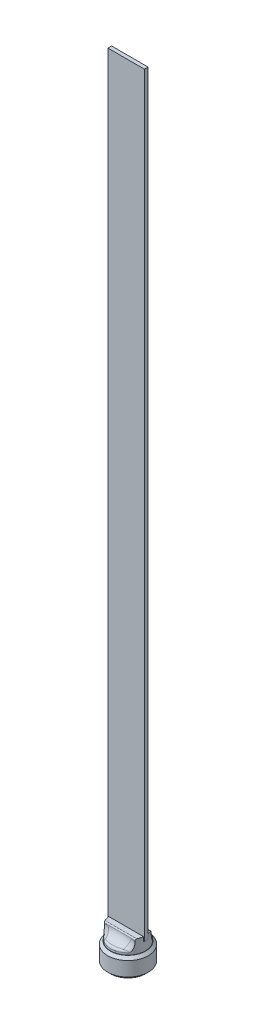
ISO-10303-21;
HEADER;
FILE_DESCRIPTION(('STEP AP214'),'2;1');
FILE_NAME('part.step','',(''),(''),'','','');
FILE_SCHEMA(('AUTOMOTIVE_DESIGN { 1 0 10303 214 1 1 1 1 }'));
ENDSEC;
DATA;
#1=APPLICATION_CONTEXT('core data for automotive mechanical design processes');
#2=APPLICATION_PROTOCOL_DEFINITION('international standard','automotive_design',2000,#1);
#3=PRODUCT_CONTEXT('',#1,'mechanical');
#4=PRODUCT('Part','Part','',(#3));
#5=PRODUCT_RELATED_PRODUCT_CATEGORY('part','',(#4));
#6=PRODUCT_DEFINITION_FORMATION('','',#4);
#7=PRODUCT_DEFINITION_CONTEXT('part definition',#1,'design');
#8=PRODUCT_DEFINITION('design','',#6,#7);
#9=PRODUCT_DEFINITION_SHAPE('','',#8);
#10=(LENGTH_UNIT() NAMED_UNIT(*) SI_UNIT(.MILLI.,.METRE.));
#11=(NAMED_UNIT(*) PLANE_ANGLE_UNIT() SI_UNIT($,.RADIAN.));
#12=(NAMED_UNIT(*) SI_UNIT($,.STERADIAN.) SOLID_ANGLE_UNIT());
#13=UNCERTAINTY_MEASURE_WITH_UNIT(LENGTH_MEASURE(1.E-05),#10,'distance_accuracy_value','');
#14=(GEOMETRIC_REPRESENTATION_CONTEXT(3) GLOBAL_UNCERTAINTY_ASSIGNED_CONTEXT((#13)) GLOBAL_UNIT_ASSIGNED_CONTEXT((#10,
#11,#12)) REPRESENTATION_CONTEXT('',''));
#15=CARTESIAN_POINT('',(0.,0.,0.));
#16=DIRECTION('',(0.,0.,1.));
#17=DIRECTION('',(1.,0.,0.));
#18=AXIS2_PLACEMENT_3D('',#15,#16,#17);
#19=CARTESIAN_POINT('',(0.,13.081,0.));
#20=DIRECTION('',(0.,1.,0.));
#21=DIRECTION('',(0.,0.,1.));
#22=AXIS2_PLACEMENT_3D('',#19,#20,#21);
#23=PLANE('',#22);
#24=DIRECTION('',(0.866025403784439,0.,-0.5));
#25=VECTOR('',#24,1.);
#26=CARTESIAN_POINT('',(0.,13.081,8.24155962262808));
#27=LINE('',#26,#25);
#28=CARTESIAN_POINT('',(7.1374,13.081,4.12077981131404));
#29=VERTEX_POINT('',#28);
#30=CARTESIAN_POINT('',(0.,13.081,8.24155962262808));
#31=VERTEX_POINT('',#30);
#32=EDGE_CURVE('E122',#29,#31,#27,.F.);
#33=ORIENTED_EDGE('',*,*,#32,.T.);
#34=DIRECTION('',(0.866025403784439,0.,0.5));
#35=VECTOR('',#34,1.);
#36=CARTESIAN_POINT('',(-7.1374,13.081,4.12077981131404));
#37=LINE('',#36,#35);
#38=CARTESIAN_POINT('',(-7.1374,13.081,4.12077981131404));
#39=VERTEX_POINT('',#38);
#40=EDGE_CURVE('E140',#31,#39,#37,.F.);
#41=ORIENTED_EDGE('',*,*,#40,.T.);
#42=DIRECTION('',(0.,0.,1.));
#43=VECTOR('',#42,1.);
#44=CARTESIAN_POINT('',(-7.1374,13.081,-4.12077981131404));
#45=LINE('',#44,#43);
#46=CARTESIAN_POINT('',(-7.1374,13.081,-4.12077981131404));
#47=VERTEX_POINT('',#46);
#48=EDGE_CURVE('E907',#39,#47,#45,.F.);
#49=ORIENTED_EDGE('',*,*,#48,.T.);
#50=DIRECTION('',(-0.866025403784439,0.,0.5));
#51=VECTOR('',#50,1.);
#52=CARTESIAN_POINT('',(0.,13.081,-8.24155962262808));
#53=LINE('',#52,#51);
#54=CARTESIAN_POINT('',(0.,13.081,-8.24155962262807));
#55=VERTEX_POINT('',#54);
#56=EDGE_CURVE('E911',#47,#55,#53,.F.);
#57=ORIENTED_EDGE('',*,*,#56,.T.);
#58=DIRECTION('',(-0.866025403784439,0.,-0.5));
#59=VECTOR('',#58,1.);
#60=CARTESIAN_POINT('',(7.1374,13.081,-4.12077981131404));
#61=LINE('',#60,#59);
#62=CARTESIAN_POINT('',(7.1374,13.081,-4.12077981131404));
#63=VERTEX_POINT('',#62);
#64=EDGE_CURVE('E914',#55,#63,#61,.F.);
#65=ORIENTED_EDGE('',*,*,#64,.T.);
#66=DIRECTION('',(0.,0.,-1.));
#67=VECTOR('',#66,1.);
#68=CARTESIAN_POINT('',(7.1374,13.081,4.12077981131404));
#69=LINE('',#68,#67);
#70=EDGE_CURVE('E127',#63,#29,#69,.F.);
#71=ORIENTED_EDGE('',*,*,#70,.T.);
#72=EDGE_LOOP('',(#33,#41,#49,#57,#65,#71));
#73=FACE_BOUND('',#72,.T.);
#74=ADVANCED_FACE('F35',(#73),#23,.F.);
#75=CARTESIAN_POINT('',(-7.1374,0.,4.12077981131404));
#76=DIRECTION('',(-0.5,0.,0.866025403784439));
#77=DIRECTION('',(0.866025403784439,0.,0.5));
#78=AXIS2_PLACEMENT_3D('',#75,#76,#77);
#79=PLANE('',#78);
#80=DIRECTION('',(0.,1.,0.));
#81=VECTOR('',#80,1.);
#82=CARTESIAN_POINT('',(-7.1374,0.,4.12077981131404));
#83=LINE('',#82,#81);
#84=CARTESIAN_POINT('',(-7.13739996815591,0.267440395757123,4.12077982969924));
#85=VERTEX_POINT('',#84);
#86=EDGE_CURVE('E910',#85,#39,#83,.T.);
#87=ORIENTED_EDGE('',*,*,#86,.T.);
#88=ORIENTED_EDGE('',*,*,#40,.F.);
#89=DIRECTION('',(0.,1.,0.));
#90=VECTOR('',#89,1.);
#91=CARTESIAN_POINT('',(0.,0.,8.24155962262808));
#92=LINE('',#91,#90);
#93=CARTESIAN_POINT('',(3.18440973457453E-08,0.267440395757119,8.24155960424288));
#94=VERTEX_POINT('',#93);
#95=EDGE_CURVE('E114',#31,#94,#92,.F.);
#96=ORIENTED_EDGE('',*,*,#95,.T.);
#97=CARTESIAN_POINT('',(2.44954622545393E-08,0.267440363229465,8.24155963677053));
#98=CARTESIAN_POINT('',(-0.122715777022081,0.338279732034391,8.17070963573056));
#99=CARTESIAN_POINT('',(-0.246374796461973,0.406945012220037,8.09931506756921));
#100=CARTESIAN_POINT('',(-0.495764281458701,0.539266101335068,7.95532998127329));
#101=CARTESIAN_POINT('',(-0.621495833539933,0.602919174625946,7.88273883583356));
#102=CARTESIAN_POINT('',(-1.00324461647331,0.785910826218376,7.66233607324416));
#103=CARTESIAN_POINT('',(-1.26249332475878,0.896501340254,7.51265876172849));
#104=CARTESIAN_POINT('',(-1.78528890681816,1.08587935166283,7.21082259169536));
#105=CARTESIAN_POINT('',(-2.04870219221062,1.16514389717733,7.0587408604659));
#106=CARTESIAN_POINT('',(-2.44815219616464,1.25683303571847,6.82811829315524));
#107=CARTESIAN_POINT('',(-2.58189023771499,1.28284920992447,6.75090459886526));
#108=CARTESIAN_POINT('',(-2.85049853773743,1.3252236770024,6.59582352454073));
#109=CARTESIAN_POINT('',(-2.98536862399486,1.34158341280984,6.51795624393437));
#110=CARTESIAN_POINT('',(-3.31404017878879,1.36901357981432,6.32819763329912));
#111=CARTESIAN_POINT('',(-3.50819579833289,1.37476813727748,6.21610183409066));
#112=CARTESIAN_POINT('',(-3.89615697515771,1.36510406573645,5.99211234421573));
#113=CARTESIAN_POINT('',(-4.08996238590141,1.34967801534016,5.88021873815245));
#114=CARTESIAN_POINT('',(-4.47574590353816,1.29856203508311,5.65748652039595));
#115=CARTESIAN_POINT('',(-4.66772172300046,1.26284944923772,5.5466492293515));
#116=CARTESIAN_POINT('',(-5.04837371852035,1.17310193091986,5.32687969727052));
#117=CARTESIAN_POINT('',(-5.23705014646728,1.11906840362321,5.21794731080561));
#118=CARTESIAN_POINT('',(-5.57196165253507,1.0079129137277,5.02458606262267));
#119=CARTESIAN_POINT('',(-5.71893877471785,0.953715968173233,4.93972878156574));
#120=CARTESIAN_POINT('',(-6.01025501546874,0.836589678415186,4.7715372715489));
#121=CARTESIAN_POINT('',(-6.15459405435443,0.773660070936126,4.68820308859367));
#122=CARTESIAN_POINT('',(-6.44017946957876,0.64047878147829,4.52332027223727));
#123=CARTESIAN_POINT('',(-6.58143396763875,0.570250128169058,4.44176694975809));
#124=CARTESIAN_POINT('',(-6.86132774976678,0.423392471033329,4.28017019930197));
#125=CARTESIAN_POINT('',(-6.99996857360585,0.346767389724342,4.20012588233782));
#126=CARTESIAN_POINT('',(-7.13739993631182,0.267440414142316,4.12077984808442));
#127=B_SPLINE_CURVE_WITH_KNOTS('',3,(#97,#98,#99,#100,#101,#102,#103,#104,#105,#106,#107,#108,
#109,#110,#111,#112,#113,#114,#115,#116,#117,#118,#119,#120,#121,#122,#123,#124,#125,#126),
.UNSPECIFIED.,.F.,.F.,(4,2,2,2,2,2,2,2,2,2,2,2,2,2,4),(0.,0.475234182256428,0.950725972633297,
1.90684205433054,2.8477782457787,3.31732374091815,3.78679905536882,4.45855001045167,
5.13053639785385,5.80327473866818,6.47596149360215,7.01018540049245,7.54442541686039,
8.07702831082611,8.60930695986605),.UNSPECIFIED.);
#128=EDGE_CURVE('E42',#94,#85,#127,.T.);
#129=ORIENTED_EDGE('',*,*,#128,.T.);
#130=EDGE_LOOP('',(#87,#88,#96,#129));
#131=FACE_BOUND('',#130,.T.);
#132=ADVANCED_FACE('F749',(#131),#79,.F.);
#133=CARTESIAN_POINT('',(-7.1374,0.,-4.12077981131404));
#134=DIRECTION('',(-1.,0.,0.));
#135=DIRECTION('',(0.,0.,1.));
#136=AXIS2_PLACEMENT_3D('',#133,#134,#135);
#137=PLANE('',#136);
#138=DIRECTION('',(0.,1.,0.));
#139=VECTOR('',#138,1.);
#140=CARTESIAN_POINT('',(-7.1374,0.,-4.12077981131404));
#141=LINE('',#140,#139);
#142=CARTESIAN_POINT('',(-7.1374,0.267440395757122,-4.12077977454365));
#143=VERTEX_POINT('',#142);
#144=EDGE_CURVE('E909',#143,#47,#141,.T.);
#145=ORIENTED_EDGE('',*,*,#144,.T.);
#146=ORIENTED_EDGE('',*,*,#48,.F.);
#147=ORIENTED_EDGE('',*,*,#86,.F.);
#148=CARTESIAN_POINT('',(-7.1374,0.267440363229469,4.12077983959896));
#149=CARTESIAN_POINT('',(-7.1374,0.338279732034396,3.97907983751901));
#150=CARTESIAN_POINT('',(-7.1374,0.406945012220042,3.83629070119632));
#151=CARTESIAN_POINT('',(-7.1374,0.539266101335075,3.54832052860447));
#152=CARTESIAN_POINT('',(-7.1374,0.602919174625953,3.40313823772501));
#153=CARTESIAN_POINT('',(-7.1374,0.785910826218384,2.96233271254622));
#154=CARTESIAN_POINT('',(-7.1374,0.896501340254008,2.66297808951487));
#155=CARTESIAN_POINT('',(-7.1374,1.08587935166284,2.0593057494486));
#156=CARTESIAN_POINT('',(-7.1374,1.16514389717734,1.75514228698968));
#157=CARTESIAN_POINT('',(-7.1374,1.25683303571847,1.29389715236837));
#158=CARTESIAN_POINT('',(-7.1374,1.28284920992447,1.1394697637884));
#159=CARTESIAN_POINT('',(-7.1374,1.32522367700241,0.829307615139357));
#160=CARTESIAN_POINT('',(-7.1374,1.34158341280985,0.673573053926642));
#161=CARTESIAN_POINT('',(-7.1374,1.36901357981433,0.29405583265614));
#162=CARTESIAN_POINT('',(-7.1374,1.37476813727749,0.0698642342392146));
#163=CARTESIAN_POINT('',(-7.1374,1.36510406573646,-0.378114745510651));
#164=CARTESIAN_POINT('',(-7.1374,1.34967801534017,-0.601901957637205));
#165=CARTESIAN_POINT('',(-7.1374,1.29856203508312,-1.0473663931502));
#166=CARTESIAN_POINT('',(-7.1374,1.26284944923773,-1.26904097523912));
#167=CARTESIAN_POINT('',(-7.1374,1.17310193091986,-1.70858003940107));
#168=CARTESIAN_POINT('',(-7.1374,1.11906840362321,-1.92644481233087));
#169=CARTESIAN_POINT('',(-7.1374,1.0079129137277,-2.31316730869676));
#170=CARTESIAN_POINT('',(-7.1374,0.953715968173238,-2.48288187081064));
#171=CARTESIAN_POINT('',(-7.1374,0.836589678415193,-2.81926489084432));
#172=CARTESIAN_POINT('',(-7.1374,0.773660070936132,-2.98593325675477));
#173=CARTESIAN_POINT('',(-7.1374,0.640478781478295,-3.31569888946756));
#174=CARTESIAN_POINT('',(-7.1374,0.570250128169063,-3.47880553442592));
#175=CARTESIAN_POINT('',(-7.1374,0.423392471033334,-3.80199903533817));
#176=CARTESIAN_POINT('',(-7.1374,0.346767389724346,-3.96208766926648));
#177=CARTESIAN_POINT('',(-7.1374,0.267440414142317,-4.12077973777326));
#178=B_SPLINE_CURVE_WITH_KNOTS('',3,(#148,#149,#150,#151,#152,#153,#154,#155,#156,#157,#158,
#159,#160,#161,#162,#163,#164,#165,#166,#167,#168,#169,#170,#171,#172,#173,#174,#175,#176,#177),
.UNSPECIFIED.,.F.,.F.,(4,2,2,2,2,2,2,2,2,2,2,2,2,2,4),(0.,0.475234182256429,0.950725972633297,
1.90684205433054,2.8477782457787,3.31732374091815,3.78679905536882,4.45855001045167,
5.13053639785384,5.80327473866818,6.47596149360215,7.01018540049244,7.54442541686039,
8.07702831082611,8.60930695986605),.UNSPECIFIED.);
#179=EDGE_CURVE('E718',#85,#143,#178,.T.);
#180=ORIENTED_EDGE('',*,*,#179,.T.);
#181=EDGE_LOOP('',(#145,#146,#147,#180));
#182=FACE_BOUND('',#181,.T.);
#183=ADVANCED_FACE('F744',(#182),#137,.F.);
#184=CARTESIAN_POINT('',(0.,0.,-8.24155962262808));
#185=DIRECTION('',(-0.5,0.,-0.866025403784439));
#186=DIRECTION('',(-0.866025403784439,0.,0.5));
#187=AXIS2_PLACEMENT_3D('',#184,#185,#186);
#188=PLANE('',#187);
#189=DIRECTION('',(0.,1.,0.));
#190=VECTOR('',#189,1.);
#191=CARTESIAN_POINT('',(0.,0.,-8.24155962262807));
#192=LINE('',#191,#190);
#193=CARTESIAN_POINT('',(0.,0.267440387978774,-8.24155961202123));
#194=VERTEX_POINT('',#193);
#195=EDGE_CURVE('E913',#194,#55,#192,.T.);
#196=ORIENTED_EDGE('',*,*,#195,.T.);
#197=ORIENTED_EDGE('',*,*,#56,.F.);
#198=ORIENTED_EDGE('',*,*,#144,.F.);
#199=CARTESIAN_POINT('',(-7.13740002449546,0.267440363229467,-4.12077979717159));
#200=CARTESIAN_POINT('',(-7.01468422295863,0.33827973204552,-4.1916297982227));
#201=CARTESIAN_POINT('',(-6.89102520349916,0.406945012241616,-4.26302436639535));
#202=CARTESIAN_POINT('',(-6.64163571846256,0.539266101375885,-4.40700945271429));
#203=CARTESIAN_POINT('',(-6.51590416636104,0.602919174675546,-4.47960059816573));
#204=CARTESIAN_POINT('',(-6.13415538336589,0.785910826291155,-4.7000033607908));
#205=CARTESIAN_POINT('',(-5.87490667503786,0.896501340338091,-4.84968067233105));
#206=CARTESIAN_POINT('',(-5.35211109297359,1.08587935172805,-5.151516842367));
#207=CARTESIAN_POINT('',(-5.08869780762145,1.1651438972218,-5.30359857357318));
#208=CARTESIAN_POINT('',(-4.68924780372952,1.25683303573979,-5.53422114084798));
#209=CARTESIAN_POINT('',(-4.55550976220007,1.28284920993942,-5.61143483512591));
#210=CARTESIAN_POINT('',(-4.28690146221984,1.32522367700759,-5.76651590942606));
#211=CARTESIAN_POINT('',(-4.15203137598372,1.34158341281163,-5.8443831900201));
#212=CARTESIAN_POINT('',(-3.82335982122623,1.36901357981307,-6.03414180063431));
#213=CARTESIAN_POINT('',(-3.62920420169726,1.37476813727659,-6.14623759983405));
#214=CARTESIAN_POINT('',(-3.2412430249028,1.36510406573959,-6.37022708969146));
#215=CARTESIAN_POINT('',(-3.04743761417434,1.34967801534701,-6.48212069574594));
#216=CARTESIAN_POINT('',(-2.66165409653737,1.2985620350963,-6.70485291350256));
#217=CARTESIAN_POINT('',(-2.46967827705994,1.2628494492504,-6.81569020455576));
#218=CARTESIAN_POINT('',(-2.08902628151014,1.1731019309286,-7.035459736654));
#219=CARTESIAN_POINT('',(-1.90034985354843,1.11906840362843,-7.14439212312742));
#220=CARTESIAN_POINT('',(-1.56543834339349,1.00791291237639,-7.33775337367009));
#221=CARTESIAN_POINT('',(-1.41846121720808,0.953715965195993,-7.42261065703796));
#222=CARTESIAN_POINT('',(-1.12714496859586,0.836589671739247,-7.59080217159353));
#223=CARTESIAN_POINT('',(-0.982805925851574,0.773660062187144,-7.67413635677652));
#224=CARTESIAN_POINT('',(-0.697220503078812,0.640478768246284,-7.839019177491));
#225=CARTESIAN_POINT('',(-0.555966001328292,0.570250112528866,-7.92057250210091));
#226=CARTESIAN_POINT('',(-0.276072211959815,0.423392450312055,-8.08216925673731));
#227=CARTESIAN_POINT('',(-0.137431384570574,0.346767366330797,-8.16221357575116));
#228=CARTESIAN_POINT('',(-1.83716012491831E-08,0.26744038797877,-8.24155961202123));
#229=B_SPLINE_CURVE_WITH_KNOTS('',3,(#199,#200,#201,#202,#203,#204,#205,#206,#207,#208,#209,
#210,#211,#212,#213,#214,#215,#216,#217,#218,#219,#220,#221,#222,#223,#224,#225,#226,#227,#228),
.UNSPECIFIED.,.F.,.F.,(4,2,2,2,2,2,2,2,2,2,2,2,2,2,4),(0.,0.475234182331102,0.950725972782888,
1.90684205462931,2.84777824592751,3.31732374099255,3.78679905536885,4.45855001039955,
5.13053639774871,5.80327473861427,6.4759614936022,7.0101854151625,7.54442544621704,
8.07702835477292,8.6093070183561),.UNSPECIFIED.);
#230=EDGE_CURVE('E734',#143,#194,#229,.T.);
#231=ORIENTED_EDGE('',*,*,#230,.T.);
#232=EDGE_LOOP('',(#196,#197,#198,#231));
#233=FACE_BOUND('',#232,.T.);
#234=ADVANCED_FACE('F740',(#233),#188,.F.);
#235=CARTESIAN_POINT('',(7.1374,0.,-4.12077981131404));
#236=DIRECTION('',(0.5,0.,-0.866025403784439));
#237=DIRECTION('',(-0.866025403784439,0.,-0.5));
#238=AXIS2_PLACEMENT_3D('',#235,#236,#237);
#239=PLANE('',#238);
#240=DIRECTION('',(0.,1.,0.));
#241=VECTOR('',#240,1.);
#242=CARTESIAN_POINT('',(7.1374,0.,-4.12077981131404));
#243=LINE('',#242,#241);
#244=CARTESIAN_POINT('',(7.13740001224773,0.267440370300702,-4.12077980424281));
#245=VERTEX_POINT('',#244);
#246=EDGE_CURVE('E916',#245,#63,#243,.T.);
#247=ORIENTED_EDGE('',*,*,#246,.T.);
#248=ORIENTED_EDGE('',*,*,#64,.F.);
#249=ORIENTED_EDGE('',*,*,#195,.F.);
#250=CARTESIAN_POINT('',(1.83715834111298E-08,0.267440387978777,-8.24155961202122));
#251=CARTESIAN_POINT('',(0.122715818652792,0.338279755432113,-8.17070961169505));
#252=CARTESIAN_POINT('',(0.246374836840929,0.406945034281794,-8.09931504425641));
#253=CARTESIAN_POINT('',(0.495764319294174,0.539266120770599,-7.95532995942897));
#254=CARTESIAN_POINT('',(0.621495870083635,0.602919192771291,-7.88273881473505));
#255=CARTESIAN_POINT('',(1.00324464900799,0.785910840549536,-7.66233605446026));
#256=CARTESIAN_POINT('',(1.26249335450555,0.896501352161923,-7.51265874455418));
#257=CARTESIAN_POINT('',(1.78528893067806,1.08587935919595,-7.21082257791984));
#258=CARTESIAN_POINT('',(2.04870221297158,1.16514390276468,-7.05874084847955));
#259=CARTESIAN_POINT('',(2.44815221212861,1.25683303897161,-6.82811828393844));
#260=CARTESIAN_POINT('',(2.58189025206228,1.28284921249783,-6.75090459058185));
#261=CARTESIAN_POINT('',(2.85049854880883,1.32522367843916,-6.59582351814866));
#262=CARTESIAN_POINT('',(2.98536863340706,1.34158341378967,-6.51795623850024));
#263=CARTESIAN_POINT('',(3.31404018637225,1.3690135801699,-6.32819762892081));
#264=CARTESIAN_POINT('',(3.50819580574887,1.37476813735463,-6.21610182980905));
#265=CARTESIAN_POINT('',(3.89615698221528,1.3651040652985,-5.99211234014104));
#266=CARTESIAN_POINT('',(4.08996239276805,1.34967801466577,-5.88021873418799));
#267=CARTESIAN_POINT('',(4.47574591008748,1.2985620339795,-5.6574865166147));
#268=CARTESIAN_POINT('',(4.66772172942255,1.26284944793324,-5.5466492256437));
#269=CARTESIAN_POINT('',(5.04837372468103,1.17310192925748,-5.32687969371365));
#270=CARTESIAN_POINT('',(5.23705015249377,1.11906840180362,-5.21794730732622));
#271=CARTESIAN_POINT('',(5.5719616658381,1.00791290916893,-5.02458605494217));
#272=CARTESIAN_POINT('',(5.71893879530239,0.953715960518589,-4.93972876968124));
#273=CARTESIAN_POINT('',(6.01025505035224,0.836589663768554,-4.7715372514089));
#274=CARTESIAN_POINT('',(6.1545940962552,0.773660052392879,-4.68820306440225));
#275=CARTESIAN_POINT('',(6.44017952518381,0.64047875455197,-4.52332024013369));
#276=CARTESIAN_POINT('',(6.58143402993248,0.570250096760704,-4.44176691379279));
#277=CARTESIAN_POINT('',(6.86132782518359,0.423392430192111,-4.28017015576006));
#278=CARTESIAN_POINT('',(6.99996865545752,0.346767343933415,-4.20012583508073));
#279=CARTESIAN_POINT('',(7.13740002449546,0.26744036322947,-4.12077979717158));
#280=B_SPLINE_CURVE_WITH_KNOTS('',3,(#250,#251,#252,#253,#254,#255,#256,#257,#258,#259,#260,
#261,#262,#263,#264,#265,#266,#267,#268,#269,#270,#271,#272,#273,#274,#275,#276,#277,#278,#279),
.UNSPECIFIED.,.F.,.F.,(4,2,2,2,2,2,2,2,2,2,2,2,2,2,4),(0.,0.475234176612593,0.950725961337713,
1.90684203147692,2.84777821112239,3.31732370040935,3.78679900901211,4.45854996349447,
5.13053635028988,5.8032746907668,6.47596144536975,7.01018537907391,7.54442542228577,
8.07702834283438,8.60930701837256),.UNSPECIFIED.);
#281=EDGE_CURVE('E728',#194,#245,#280,.T.);
#282=ORIENTED_EDGE('',*,*,#281,.T.);
#283=EDGE_LOOP('',(#247,#248,#249,#282));
#284=FACE_BOUND('',#283,.T.);
#285=ADVANCED_FACE('F743',(#284),#239,.F.);
#286=CARTESIAN_POINT('',(7.1374,0.,4.12077981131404));
#287=DIRECTION('',(1.,0.,0.));
#288=DIRECTION('',(0.,0.,-1.));
#289=AXIS2_PLACEMENT_3D('',#286,#287,#288);
#290=PLANE('',#289);
#291=DIRECTION('',(0.,1.,0.));
#292=VECTOR('',#291,1.);
#293=CARTESIAN_POINT('',(7.1374,0.,4.12077981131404));
#294=LINE('',#293,#292);
#295=CARTESIAN_POINT('',(7.1374,0.267440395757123,4.12077977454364));
#296=VERTEX_POINT('',#295);
#297=EDGE_CURVE('E918',#296,#29,#294,.T.);
#298=ORIENTED_EDGE('',*,*,#297,.T.);
#299=ORIENTED_EDGE('',*,*,#70,.F.);
#300=ORIENTED_EDGE('',*,*,#246,.F.);
#301=CARTESIAN_POINT('',(7.1374,0.267440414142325,-4.12077973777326));
#302=CARTESIAN_POINT('',(7.1374,0.338279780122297,-3.97907973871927));
#303=CARTESIAN_POINT('',(7.1374,0.406945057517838,-3.83629060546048));
#304=CARTESIAN_POINT('',(7.1374,0.539266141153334,-3.54832043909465));
#305=CARTESIAN_POINT('',(7.1374,0.602919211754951,-3.40313815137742));
#306=CARTESIAN_POINT('',(7.1374,0.78591085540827,-2.96233263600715));
#307=CARTESIAN_POINT('',(7.1374,0.896501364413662,-2.66297801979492));
#308=CARTESIAN_POINT('',(7.1374,1.08587936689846,-2.0593056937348));
#309=CARTESIAN_POINT('',(7.1374,1.16514390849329,-1.75514223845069));
#310=CARTESIAN_POINT('',(7.1374,1.25683304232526,-1.29389711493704));
#311=CARTESIAN_POINT('',(7.1374,1.28284921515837,-1.13946973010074));
#312=CARTESIAN_POINT('',(7.1374,1.32522367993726,-0.829307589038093));
#313=CARTESIAN_POINT('',(7.1374,1.34158341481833,-0.673573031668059));
#314=CARTESIAN_POINT('',(7.1374,1.36901358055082,-0.294055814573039));
#315=CARTESIAN_POINT('',(7.1374,1.37476813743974,-0.0698642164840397));
#316=CARTESIAN_POINT('',(7.1374,1.36510406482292,0.378114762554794));
#317=CARTESIAN_POINT('',(7.1374,1.34967801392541,0.601901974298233));
#318=CARTESIAN_POINT('',(7.1374,1.29856203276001,1.04736640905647));
#319=CARTESIAN_POINT('',(7.1374,1.26284944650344,1.26904099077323));
#320=CARTESIAN_POINT('',(7.1374,1.17310192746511,1.708580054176));
#321=CARTESIAN_POINT('',(7.1374,1.11906839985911,1.92644482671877));
#322=CARTESIAN_POINT('',(7.1374,1.00791290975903,2.31316732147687));
#323=CARTESIAN_POINT('',(7.1374,0.95371596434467,2.48288188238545));
#324=CARTESIAN_POINT('',(7.1374,0.836589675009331,2.81926490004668));
#325=CARTESIAN_POINT('',(7.1374,0.773660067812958,2.98593326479));
#326=CARTESIAN_POINT('',(7.1374,0.640478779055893,3.31569889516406));
#327=CARTESIAN_POINT('',(7.1374,0.570250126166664,3.47880553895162));
#328=CARTESIAN_POINT('',(7.1374,0.423392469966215,3.80199903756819));
#329=CARTESIAN_POINT('',(7.1374,0.346767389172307,3.96208767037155));
#330=CARTESIAN_POINT('',(7.1374,0.267440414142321,4.12077973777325));
#331=B_SPLINE_CURVE_WITH_KNOTS('',3,(#301,#302,#303,#304,#305,#306,#307,#308,#309,#310,#311,
#312,#313,#314,#315,#316,#317,#318,#319,#320,#321,#322,#323,#324,#325,#326,#327,#328,#329,#330),
.UNSPECIFIED.,.F.,.F.,(4,2,2,2,2,2,2,2,2,2,2,2,2,2,4),(0.,0.475234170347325,0.950725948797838,
1.90684200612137,2.84777817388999,3.31732365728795,3.78679896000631,4.45854991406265,
5.13053630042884,5.80327464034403,6.47596139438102,7.01018529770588,7.54442531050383,
8.07702820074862,8.60930684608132),.UNSPECIFIED.);
#332=EDGE_CURVE('E700',#245,#296,#331,.T.);
#333=ORIENTED_EDGE('',*,*,#332,.T.);
#334=EDGE_LOOP('',(#298,#299,#300,#333));
#335=FACE_BOUND('',#334,.T.);
#336=ADVANCED_FACE('F1107',(#335),#290,.F.);
#337=CARTESIAN_POINT('',(0.,0.,8.24155962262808));
#338=DIRECTION('',(0.5,0.,0.866025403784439));
#339=DIRECTION('',(0.866025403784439,0.,-0.5));
#340=AXIS2_PLACEMENT_3D('',#337,#338,#339);
#341=PLANE('',#340);
#342=ORIENTED_EDGE('',*,*,#95,.F.);
#343=ORIENTED_EDGE('',*,*,#32,.F.);
#344=ORIENTED_EDGE('',*,*,#297,.F.);
#345=CARTESIAN_POINT('',(7.13740002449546,0.267440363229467,4.12077979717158));
#346=CARTESIAN_POINT('',(7.01468422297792,0.338279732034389,4.19162979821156));
#347=CARTESIAN_POINT('',(6.89102520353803,0.406945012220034,4.26302436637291));
#348=CARTESIAN_POINT('',(6.6416357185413,0.539266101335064,4.40700945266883));
#349=CARTESIAN_POINT('',(6.51590416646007,0.602919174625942,4.47960059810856));
#350=CARTESIAN_POINT('',(6.13415538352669,0.785910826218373,4.70000336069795));
#351=CARTESIAN_POINT('',(5.87490667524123,0.896501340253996,4.84968067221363));
#352=CARTESIAN_POINT('',(5.35211109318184,1.08587935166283,5.15151684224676));
#353=CARTESIAN_POINT('',(5.08869780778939,1.16514389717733,5.30359857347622));
#354=CARTESIAN_POINT('',(4.68924780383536,1.25683303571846,5.53422114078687));
#355=CARTESIAN_POINT('',(4.55550976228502,1.28284920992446,5.61143483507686));
#356=CARTESIAN_POINT('',(4.28690146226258,1.3252236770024,5.76651590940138));
#357=CARTESIAN_POINT('',(4.15203137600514,1.34158341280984,5.84438319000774));
#358=CARTESIAN_POINT('',(3.82335982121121,1.36901357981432,6.03414180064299));
#359=CARTESIAN_POINT('',(3.62920420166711,1.37476813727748,6.14623759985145));
#360=CARTESIAN_POINT('',(3.2412430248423,1.36510406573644,6.37022708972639));
#361=CARTESIAN_POINT('',(3.0474376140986,1.34967801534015,6.48212069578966));
#362=CARTESIAN_POINT('',(2.66165409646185,1.2985620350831,6.70485291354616));
#363=CARTESIAN_POINT('',(2.46967827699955,1.26284944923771,6.81569020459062));
#364=CARTESIAN_POINT('',(2.08902628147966,1.17310193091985,7.0354597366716));
#365=CARTESIAN_POINT('',(1.90034985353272,1.1190684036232,7.1443921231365));
#366=CARTESIAN_POINT('',(1.56543834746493,1.00791291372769,7.33775337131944));
#367=CARTESIAN_POINT('',(1.41846122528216,0.953715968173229,7.42261065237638));
#368=CARTESIAN_POINT('',(1.12714498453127,0.836589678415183,7.59080216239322));
#369=CARTESIAN_POINT('',(0.982805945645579,0.773660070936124,7.67413634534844));
#370=CARTESIAN_POINT('',(0.697220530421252,0.640478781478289,7.83901916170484));
#371=CARTESIAN_POINT('',(0.555966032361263,0.570250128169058,7.92057248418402));
#372=CARTESIAN_POINT('',(0.276072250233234,0.42339247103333,8.08216923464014));
#373=CARTESIAN_POINT('',(0.137431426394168,0.346767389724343,8.16221355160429));
#374=CARTESIAN_POINT('',(6.36881944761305E-08,0.267440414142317,8.24155958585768));
#375=B_SPLINE_CURVE_WITH_KNOTS('',3,(#345,#346,#347,#348,#349,#350,#351,#352,#353,#354,#355,
#356,#357,#358,#359,#360,#361,#362,#363,#364,#365,#366,#367,#368,#369,#370,#371,#372,#373,#374),
.UNSPECIFIED.,.F.,.F.,(4,2,2,2,2,2,2,2,2,2,2,2,2,2,4),(0.,0.475234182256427,0.950725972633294,
1.90684205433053,2.84777824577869,3.31732374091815,3.78679905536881,4.45855001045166,
5.13053639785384,5.80327473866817,6.47596149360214,7.01018540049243,7.54442541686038,
8.07702831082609,8.60930695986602),.UNSPECIFIED.);
#376=EDGE_CURVE('E693',#296,#94,#375,.T.);
#377=ORIENTED_EDGE('',*,*,#376,.T.);
#378=EDGE_LOOP('',(#342,#343,#344,#377));
#379=FACE_BOUND('',#378,.T.);
#380=ADVANCED_FACE('F707',(#379),#341,.F.);
#381=CARTESIAN_POINT('',(0.,0.,0.));
#382=DIRECTION('',(0.,-1.,0.));
#383=DIRECTION('',(0.,0.,-1.));
#384=AXIS2_PLACEMENT_3D('',#381,#382,#383);
#385=CONICAL_SURFACE('',#384,8.509,0.785398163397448);
#386=CARTESIAN_POINT('',(0.,0.,0.));
#387=DIRECTION('',(0.,-1.,0.));
#388=DIRECTION('',(0.,0.,-1.));
#389=AXIS2_PLACEMENT_3D('',#386,#387,#388);
#390=CIRCLE('',#389,8.509);
#391=CARTESIAN_POINT('',(0.,0.,-8.509));
#392=VERTEX_POINT('',#391);
#393=EDGE_CURVE('E690',#392,#392,#390,.F.);
#394=ORIENTED_EDGE('',*,*,#393,.F.);
#395=EDGE_LOOP('',(#394));
#396=FACE_BOUND('',#395,.T.);
#397=ORIENTED_EDGE('',*,*,#332,.F.);
#398=ORIENTED_EDGE('',*,*,#281,.F.);
#399=ORIENTED_EDGE('',*,*,#230,.F.);
#400=ORIENTED_EDGE('',*,*,#179,.F.);
#401=ORIENTED_EDGE('',*,*,#128,.F.);
#402=ORIENTED_EDGE('',*,*,#376,.F.);
#403=EDGE_LOOP('',(#397,#398,#399,#400,#401,#402));
#404=FACE_BOUND('',#403,.T.);
#405=ADVANCED_FACE('F709',(#396,#404),#385,.F.);
#406=CARTESIAN_POINT('',(0.,0.,-7.112));
#407=DIRECTION('',(0.,-1.,0.));
#408=DIRECTION('',(0.,0.,-1.));
#409=AXIS2_PLACEMENT_3D('',#406,#407,#408);
#410=PLANE('',#409);
#411=ORIENTED_EDGE('',*,*,#393,.T.);
#412=EDGE_LOOP('',(#411));
#413=FACE_BOUND('',#412,.T.);
#414=CARTESIAN_POINT('',(0.,0.,0.));
#415=DIRECTION('',(0.,1.,0.));
#416=DIRECTION('',(-1.,0.,0.));
#417=AXIS2_PLACEMENT_3D('',#414,#415,#416);
#418=CIRCLE('',#417,11.43);
#419=CARTESIAN_POINT('',(-11.43,0.,0.));
#420=VERTEX_POINT('',#419);
#421=EDGE_CURVE('E686',#420,#420,#418,.T.);
#422=ORIENTED_EDGE('',*,*,#421,.F.);
#423=EDGE_LOOP('',(#422));
#424=FACE_BOUND('',#423,.T.);
#425=ADVANCED_FACE('F713',(#413,#424),#410,.T.);
#426=CARTESIAN_POINT('',(0.,1.7195,0.));
#427=DIRECTION('',(0.,1.,0.));
#428=DIRECTION('',(-1.,0.,0.));
#429=AXIS2_PLACEMENT_3D('',#426,#427,#428);
#430=CONICAL_SURFACE('',#429,13.1495,0.785398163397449);
#431=CARTESIAN_POINT('',(0.,1.7195,0.));
#432=DIRECTION('',(0.,-1.,0.));
#433=DIRECTION('',(0.,0.,-1.));
#434=AXIS2_PLACEMENT_3D('',#431,#432,#433);
#435=CIRCLE('',#434,13.1495);
#436=CARTESIAN_POINT('',(0.,1.7195,-13.1495));
#437=VERTEX_POINT('',#436);
#438=EDGE_CURVE('E689',#437,#437,#435,.F.);
#439=ORIENTED_EDGE('',*,*,#438,.F.);
#440=EDGE_LOOP('',(#439));
#441=FACE_BOUND('',#440,.T.);
#442=ORIENTED_EDGE('',*,*,#421,.T.);
#443=EDGE_LOOP('',(#442));
#444=FACE_BOUND('',#443,.T.);
#445=ADVANCED_FACE('F1129',(#441,#444),#430,.T.);
#446=CARTESIAN_POINT('',(0.,6.35,0.));
#447=DIRECTION('',(0.,-1.,0.));
#448=DIRECTION('',(0.,0.,-1.));
#449=AXIS2_PLACEMENT_3D('',#446,#447,#448);
#450=CYLINDRICAL_SURFACE('',#449,13.1495);
#451=CARTESIAN_POINT('',(0.,10.9805,0.));
#452=DIRECTION('',(0.,-1.,0.));
#453=DIRECTION('',(0.,0.,1.));
#454=AXIS2_PLACEMENT_3D('',#451,#452,#453);
#455=CIRCLE('',#454,13.1495);
#456=CARTESIAN_POINT('',(0.,10.9805,13.1495));
#457=VERTEX_POINT('',#456);
#458=EDGE_CURVE('E327',#457,#457,#455,.F.);
#459=ORIENTED_EDGE('',*,*,#458,.F.);
#460=EDGE_LOOP('',(#459));
#461=FACE_BOUND('',#460,.T.);
#462=ORIENTED_EDGE('',*,*,#438,.T.);
#463=EDGE_LOOP('',(#462));
#464=FACE_BOUND('',#463,.T.);
#465=ADVANCED_FACE('F1137',(#461,#464),#450,.T.);
#466=CARTESIAN_POINT('',(0.,10.9805,0.));
#467=DIRECTION('',(0.,-1.,0.));
#468=DIRECTION('',(0.,0.,-1.));
#469=AXIS2_PLACEMENT_3D('',#466,#467,#468);
#470=CONICAL_SURFACE('',#469,13.1495,0.785398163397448);
#471=CARTESIAN_POINT('',(0.,12.7,0.));
#472=DIRECTION('',(0.,-1.,0.));
#473=DIRECTION('',(0.,0.,-1.));
#474=AXIS2_PLACEMENT_3D('',#471,#472,#473);
#475=CIRCLE('',#474,11.43);
#476=CARTESIAN_POINT('',(0.,12.7,-11.43));
#477=VERTEX_POINT('',#476);
#478=EDGE_CURVE('E679',#477,#477,#475,.F.);
#479=ORIENTED_EDGE('',*,*,#478,.F.);
#480=EDGE_LOOP('',(#479));
#481=FACE_BOUND('',#480,.T.);
#482=ORIENTED_EDGE('',*,*,#458,.T.);
#483=EDGE_LOOP('',(#482));
#484=FACE_BOUND('',#483,.T.);
#485=ADVANCED_FACE('F312',(#481,#484),#470,.T.);
#486=CARTESIAN_POINT('',(0.,15.494,5.35577279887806));
#487=DIRECTION('',(0.,0.,-1.));
#488=DIRECTION('',(0.,1.,0.));
#489=AXIS2_PLACEMENT_3D('',#486,#487,#488);
#490=PLANE('',#489);
#491=DIRECTION('',(1.,0.,0.));
#492=VECTOR('',#491,1.);
#493=CARTESIAN_POINT('',(0.,20.574,5.35577279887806));
#494=LINE('',#493,#492);
#495=CARTESIAN_POINT('',(-9.8958426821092,20.574,5.35577279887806));
#496=VERTEX_POINT('',#495);
#497=CARTESIAN_POINT('',(-7.70902879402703,20.5739999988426,5.35577279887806));
#498=VERTEX_POINT('',#497);
#499=EDGE_CURVE('E657',#496,#498,#494,.T.);
#500=ORIENTED_EDGE('',*,*,#499,.F.);
#501=DIRECTION('',(0.,1.,0.));
#502=VECTOR('',#501,1.);
#503=CARTESIAN_POINT('',(-9.89584267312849,15.494,5.35577279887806));
#504=LINE('',#503,#502);
#505=CARTESIAN_POINT('',(-9.89584267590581,19.5053593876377,5.35577278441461));
#506=VERTEX_POINT('',#505);
#507=EDGE_CURVE('E234',#506,#496,#504,.T.);
#508=ORIENTED_EDGE('',*,*,#507,.F.);
#509=CARTESIAN_POINT('',(-7.7090287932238,20.5739999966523,5.35577279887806));
#510=CARTESIAN_POINT('',(-7.80471114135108,20.5398437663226,5.35577279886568));
#511=CARTESIAN_POINT('',(-7.89996383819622,20.50447612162,5.35577279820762));
#512=CARTESIAN_POINT('',(-8.08960391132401,20.4312213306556,5.35577279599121));
#513=CARTESIAN_POINT('',(-8.18399033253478,20.3933317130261,5.35577279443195));
#514=CARTESIAN_POINT('',(-8.37174409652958,20.314986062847,5.35577279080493));
#515=CARTESIAN_POINT('',(-8.46511095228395,20.2745288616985,5.35577278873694));
#516=CARTESIAN_POINT('',(-8.65066945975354,20.1910005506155,5.35577278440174));
#517=CARTESIAN_POINT('',(-8.74286110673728,20.1479294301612,5.35577278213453));
#518=CARTESIAN_POINT('',(-8.92591373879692,20.0591260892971,5.35577277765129));
#519=CARTESIAN_POINT('',(-9.01677519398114,20.0133948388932,5.35577277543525));
#520=CARTESIAN_POINT('',(-9.19701161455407,19.9192242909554,5.35577277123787));
#521=CARTESIAN_POINT('',(-9.28638748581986,19.8707867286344,5.35577276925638));
#522=CARTESIAN_POINT('',(-9.46349780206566,19.7711564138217,5.35577276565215));
#523=CARTESIAN_POINT('',(-9.55123350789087,19.7199659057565,5.35577276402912));
#524=CARTESIAN_POINT('',(-9.72490564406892,19.614784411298,5.355772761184));
#525=CARTESIAN_POINT('',(-9.81084356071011,19.5607958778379,5.35577275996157));
#526=CARTESIAN_POINT('',(-9.89584267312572,19.5053593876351,5.35577275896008));
#527=B_SPLINE_CURVE_WITH_KNOTS('',3,(#509,#510,#511,#512,#513,#514,#515,#516,#517,#518,#519,
#520,#521,#522,#523,#524,#525,#526),.UNSPECIFIED.,.F.,.F.,(4,2,2,2,2,2,2,2,4),(0.,
0.304783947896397,0.609871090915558,0.915098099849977,1.22032633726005,1.52544396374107,
1.83036815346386,2.13504740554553,2.43946393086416),.UNSPECIFIED.);
#528=EDGE_CURVE('E211',#498,#506,#527,.T.);
#529=ORIENTED_EDGE('',*,*,#528,.F.);
#530=EDGE_LOOP('',(#500,#508,#529));
#531=FACE_BOUND('',#530,.T.);
#532=ADVANCED_FACE('F306',(#531),#490,.F.);
#533=CARTESIAN_POINT('',(0.,21.336,-4.80422720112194));
#534=DIRECTION('',(0.,0.,1.));
#535=DIRECTION('',(0.,-1.,0.));
#536=AXIS2_PLACEMENT_3D('',#533,#534,#535);
#537=PLANE('',#536);
#538=DIRECTION('',(0.,-1.,0.));
#539=VECTOR('',#538,1.);
#540=CARTESIAN_POINT('',(-10.1750383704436,21.336,-4.80422720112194));
#541=LINE('',#540,#539);
#542=CARTESIAN_POINT('',(-10.1750383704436,20.574,-4.80422720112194));
#543=VERTEX_POINT('',#542);
#544=CARTESIAN_POINT('',(-10.1750383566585,19.7289605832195,-4.80422694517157));
#545=VERTEX_POINT('',#544);
#546=EDGE_CURVE('E233',#543,#545,#541,.T.);
#547=ORIENTED_EDGE('',*,*,#546,.F.);
#548=DIRECTION('',(1.,0.,0.));
#549=VECTOR('',#548,1.);
#550=CARTESIAN_POINT('',(0.,20.574,-4.80422720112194));
#551=LINE('',#550,#549);
#552=CARTESIAN_POINT('',(-8.48748827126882,20.574,-4.80422720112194));
#553=VERTEX_POINT('',#552);
#554=EDGE_CURVE('E219',#553,#543,#551,.F.);
#555=ORIENTED_EDGE('',*,*,#554,.F.);
#556=CARTESIAN_POINT('',(-10.1750383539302,19.7289605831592,-4.80422655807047));
#557=CARTESIAN_POINT('',(-10.1285980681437,19.7578612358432,-4.80422662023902));
#558=CARTESIAN_POINT('',(-10.081922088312,19.7863833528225,-4.80422667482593));
#559=CARTESIAN_POINT('',(-9.98219227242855,19.8462129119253,-4.80422677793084));
#560=CARTESIAN_POINT('',(-9.92907682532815,19.8774176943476,-4.80422682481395));
#561=CARTESIAN_POINT('',(-9.81629894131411,19.942285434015,-4.80422691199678));
#562=CARTESIAN_POINT('',(-9.7565696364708,19.9758321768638,-4.80422695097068));
#563=CARTESIAN_POINT('',(-9.63040050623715,20.0450210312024,-4.80422702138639));
#564=CARTESIAN_POINT('',(-9.56389008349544,20.0805344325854,-4.80422705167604));
#565=CARTESIAN_POINT('',(-9.42400672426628,20.1532548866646,-4.80422710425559));
#566=CARTESIAN_POINT('',(-9.35056071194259,20.1903213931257,-4.80422712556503));
#567=CARTESIAN_POINT('',(-9.19667503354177,20.2657083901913,-4.80422716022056));
#568=CARTESIAN_POINT('',(-9.11616112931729,20.3038773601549,-4.8042271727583));
#569=CARTESIAN_POINT('',(-8.94803909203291,20.380991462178,-4.80422719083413));
#570=CARTESIAN_POINT('',(-8.86035688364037,20.4197750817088,-4.80422719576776));
#571=CARTESIAN_POINT('',(-8.67783706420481,20.4976015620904,-4.80422720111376));
#572=CARTESIAN_POINT('',(-8.58292674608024,20.5364740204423,-4.80422720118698));
#573=CARTESIAN_POINT('',(-8.48748827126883,20.574,-4.80422720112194));
#574=B_SPLINE_CURVE_WITH_KNOTS('',3,(#556,#557,#558,#559,#560,#561,#562,#563,#564,#565,#566,
#567,#568,#569,#570,#571,#572,#573),.UNSPECIFIED.,.F.,.F.,(4,2,2,2,2,2,2,2,4),(0.,
0.164094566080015,0.348894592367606,0.554396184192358,0.780571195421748,1.02735570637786,
1.29463592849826,1.58223140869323,1.88987549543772),.UNSPECIFIED.);
#575=EDGE_CURVE('E210',#545,#553,#574,.T.);
#576=ORIENTED_EDGE('',*,*,#575,.F.);
#577=EDGE_LOOP('',(#547,#555,#576));
#578=FACE_BOUND('',#577,.T.);
#579=ADVANCED_FACE('F230',(#578),#537,.F.);
#580=CARTESIAN_POINT('',(0.,21.336,-4.80422720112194));
#581=DIRECTION('',(0.,0.,1.));
#582=DIRECTION('',(0.,-1.,0.));
#583=AXIS2_PLACEMENT_3D('',#580,#581,#582);
#584=PLANE('',#583);
#585=DIRECTION('',(1.,0.,0.));
#586=VECTOR('',#585,1.);
#587=CARTESIAN_POINT('',(0.,20.574,-4.80422720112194));
#588=LINE('',#587,#586);
#589=CARTESIAN_POINT('',(10.1750383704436,20.574,-4.80422720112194));
#590=VERTEX_POINT('',#589);
#591=CARTESIAN_POINT('',(8.48748827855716,20.5739999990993,-4.80422720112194));
#592=VERTEX_POINT('',#591);
#593=EDGE_CURVE('E222',#590,#592,#588,.F.);
#594=ORIENTED_EDGE('',*,*,#593,.F.);
#595=DIRECTION('',(0.,-1.,0.));
#596=VECTOR('',#595,1.);
#597=CARTESIAN_POINT('',(10.1750383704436,21.336,-4.80422720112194));
#598=LINE('',#597,#596);
#599=CARTESIAN_POINT('',(10.1750383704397,19.7289605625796,-4.80422714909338));
#600=VERTEX_POINT('',#599);
#601=EDGE_CURVE('E518',#600,#590,#598,.F.);
#602=ORIENTED_EDGE('',*,*,#601,.F.);
#603=CARTESIAN_POINT('',(8.4874882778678,20.5739999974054,-4.80422720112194));
#604=CARTESIAN_POINT('',(8.56070958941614,20.5452545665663,-4.80422720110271));
#605=CARTESIAN_POINT('',(8.63362734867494,20.5157335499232,-4.80422719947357));
#606=CARTESIAN_POINT('',(8.77887071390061,20.4550943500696,-4.80422719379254));
#607=CARTESIAN_POINT('',(8.85119574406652,20.4239747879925,-4.80422718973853));
#608=CARTESIAN_POINT('',(8.99517978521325,20.3601252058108,-4.80422718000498));
#609=CARTESIAN_POINT('',(9.06683840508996,20.3273943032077,-4.80422717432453));
#610=CARTESIAN_POINT('',(9.20941494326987,20.2603085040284,-4.80422716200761));
#611=CARTESIAN_POINT('',(9.28033265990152,20.2259531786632,-4.80422715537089));
#612=CARTESIAN_POINT('',(9.42135293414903,20.1556051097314,-4.80422714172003));
#613=CARTESIAN_POINT('',(9.49145548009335,20.1196123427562,-4.80422713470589));
#614=CARTESIAN_POINT('',(9.63077082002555,20.0459760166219,-4.80422712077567));
#615=CARTESIAN_POINT('',(9.69998378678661,20.0083327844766,-4.80422711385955));
#616=CARTESIAN_POINT('',(9.83744566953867,19.9313821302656,-4.80422710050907));
#617=CARTESIAN_POINT('',(9.90569492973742,19.8920753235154,-4.80422709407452));
#618=CARTESIAN_POINT('',(10.0411540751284,19.8117844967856,-4.80422708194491));
#619=CARTESIAN_POINT('',(10.1083644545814,19.7708013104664,-4.80422707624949));
#620=CARTESIAN_POINT('',(10.1750383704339,19.7289605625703,-4.80422707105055));
#621=B_SPLINE_CURVE_WITH_KNOTS('',3,(#603,#604,#605,#606,#607,#608,#609,#610,#611,#612,#613,
#614,#615,#616,#617,#618,#619,#620),.UNSPECIFIED.,.F.,.F.,(4,2,2,2,2,2,2,2,4),(0.,
0.235981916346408,0.472170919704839,0.708490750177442,0.944873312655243,1.18125925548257,
1.41759857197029,1.65385122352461,1.88998778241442),.UNSPECIFIED.);
#622=EDGE_CURVE('E431',#592,#600,#621,.T.);
#623=ORIENTED_EDGE('',*,*,#622,.F.);
#624=EDGE_LOOP('',(#594,#602,#623));
#625=FACE_BOUND('',#624,.T.);
#626=ADVANCED_FACE('F305',(#625),#584,.F.);
#627=CARTESIAN_POINT('',(0.,20.574,4.59377279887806));
#628=DIRECTION('',(1.,0.,0.));
#629=DIRECTION('',(0.,0.,-1.));
#630=AXIS2_PLACEMENT_3D('',#627,#628,#629);
#631=CYLINDRICAL_SURFACE('',#630,0.762);
#632=CARTESIAN_POINT('',(-10.2717698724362,21.336,4.59377279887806));
#633=CARTESIAN_POINT('',(-10.2507973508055,21.3360122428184,4.64070072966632));
#634=CARTESIAN_POINT('',(-10.2294826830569,21.3316660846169,4.68746600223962));
#635=CARTESIAN_POINT('',(-10.1868073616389,21.3145027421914,4.77948281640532));
#636=CARTESIAN_POINT('',(-10.1654466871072,21.3016727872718,4.8247319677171));
#637=CARTESIAN_POINT('',(-10.1233710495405,21.2677779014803,4.91240797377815));
#638=CARTESIAN_POINT('',(-10.1026565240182,21.2467075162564,4.95483293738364));
#639=CARTESIAN_POINT('',(-10.062680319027,21.196696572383,5.03552288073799));
#640=CARTESIAN_POINT('',(-10.0434178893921,21.1677601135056,5.07379001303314));
#641=CARTESIAN_POINT('',(-10.0078550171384,21.1036534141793,5.14357147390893));
#642=CARTESIAN_POINT('',(-9.99147547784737,21.0687318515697,5.17527281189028));
#643=CARTESIAN_POINT('',(-9.96180613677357,20.9927566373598,5.23215588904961));
#644=CARTESIAN_POINT('',(-9.94851495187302,20.9517057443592,5.25734054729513));
#645=CARTESIAN_POINT('',(-9.92715671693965,20.8693256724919,5.29754935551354));
#646=CARTESIAN_POINT('',(-9.91868469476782,20.8284893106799,5.31336865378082));
#647=CARTESIAN_POINT('',(-9.90555182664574,20.7441825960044,5.33781276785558));
#648=CARTESIAN_POINT('',(-9.90088108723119,20.7007193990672,5.34645626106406));
#649=CARTESIAN_POINT('',(-9.89746994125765,20.6430492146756,5.35276513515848));
#650=CARTESIAN_POINT('',(-9.89685991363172,20.6292610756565,5.35389288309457));
#651=CARTESIAN_POINT('',(-9.89604685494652,20.6016510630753,5.35539565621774));
#652=CARTESIAN_POINT('',(-9.8958432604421,20.5878292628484,5.35577172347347));
#653=CARTESIAN_POINT('',(-9.89584269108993,20.5740000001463,5.35577279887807));
#654=B_SPLINE_CURVE_WITH_KNOTS('',3,(#632,#633,#634,#635,#636,#637,#638,#639,#640,#641,#642,
#643,#644,#645,#646,#647,#648,#649,#650,#651,#652,#653),.UNSPECIFIED.,.F.,.F.,(4,2,2,2,2,2,2,2,
2,2,4),(0.,0.154011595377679,0.308255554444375,0.462601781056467,0.616867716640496,
0.765827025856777,0.914719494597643,1.04779506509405,1.18052316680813,1.22204709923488,
1.26351342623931),.UNSPECIFIED.);
#655=CARTESIAN_POINT('',(-10.2717698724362,21.336,4.59377279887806));
#656=VERTEX_POINT('',#655);
#657=EDGE_CURVE('E672',#656,#496,#654,.T.);
#658=ORIENTED_EDGE('',*,*,#657,.T.);
#659=ORIENTED_EDGE('',*,*,#499,.T.);
#660=CARTESIAN_POINT('',(7.70902878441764,20.5739999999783,5.35577279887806));
#661=CARTESIAN_POINT('',(7.00792222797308,20.6008265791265,5.35577279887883));
#662=CARTESIAN_POINT('',(4.84009709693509,20.6623963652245,5.35148253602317));
#663=CARTESIAN_POINT('',(1.11567449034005,20.6901988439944,5.3467382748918));
#664=CARTESIAN_POINT('',(-3.35221842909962,20.6821588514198,5.3482567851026));
#665=CARTESIAN_POINT('',(-6.30681568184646,20.6276531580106,5.35577279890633));
#666=CARTESIAN_POINT('',(-7.70902879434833,20.5739999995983,5.35577279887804));
#667=B_SPLINE_CURVE_WITH_KNOTS('',3,(#660,#661,#662,#663,#664,#665,#666),.UNSPECIFIED.,.F.,.F.,
(4,1,1,1,4),(0.,0.223342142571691,0.670026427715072,1.11671071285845,1.56339499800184),.UNSPECIFIED.);
#668=CARTESIAN_POINT('',(7.70902878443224,20.5739999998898,5.35577279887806));
#669=VERTEX_POINT('',#668);
#670=EDGE_CURVE('E654',#669,#498,#667,.T.);
#671=ORIENTED_EDGE('',*,*,#670,.F.);
#672=DIRECTION('',(1.,0.,0.));
#673=VECTOR('',#672,1.);
#674=CARTESIAN_POINT('',(0.,20.5739999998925,5.35577279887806));
#675=LINE('',#674,#673);
#676=CARTESIAN_POINT('',(9.89584269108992,20.5739999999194,5.35577279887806));
#677=VERTEX_POINT('',#676);
#678=EDGE_CURVE('E965',#669,#677,#675,.T.);
#679=ORIENTED_EDGE('',*,*,#678,.T.);
#680=CARTESIAN_POINT('',(9.89584269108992,20.5739999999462,5.35577279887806));
#681=CARTESIAN_POINT('',(9.89584172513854,20.5936699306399,5.35577389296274));
#682=CARTESIAN_POINT('',(9.89625523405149,20.6133295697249,5.35501061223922));
#683=CARTESIAN_POINT('',(9.89789804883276,20.6524910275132,5.35197379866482));
#684=CARTESIAN_POINT('',(9.89912708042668,20.6719928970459,5.34970077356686));
#685=CARTESIAN_POINT('',(9.90400172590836,20.7298807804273,5.34067447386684));
#686=CARTESIAN_POINT('',(9.9088351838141,20.7678499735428,5.33171354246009));
#687=CARTESIAN_POINT('',(9.92138257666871,20.841486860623,5.30832794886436));
#688=CARTESIAN_POINT('',(9.92909397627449,20.877156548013,5.29390809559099));
#689=CARTESIAN_POINT('',(9.94699743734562,20.9454598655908,5.2601910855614));
#690=CARTESIAN_POINT('',(9.95719158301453,20.9780909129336,5.24088983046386));
#691=CARTESIAN_POINT('',(9.98018765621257,21.0412831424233,5.19697057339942));
#692=CARTESIAN_POINT('',(9.99309768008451,21.0716482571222,5.17212817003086));
#693=CARTESIAN_POINT('',(10.0206341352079,21.1278367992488,5.11857434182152));
#694=CARTESIAN_POINT('',(10.0352611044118,21.1536587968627,5.08986170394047));
#695=CARTESIAN_POINT('',(10.0674790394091,21.2030924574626,5.02586229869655));
#696=CARTESIAN_POINT('',(10.0852179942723,21.2261206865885,4.99019925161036));
#697=CARTESIAN_POINT('',(10.1216287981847,21.2658346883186,4.91592824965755));
#698=CARTESIAN_POINT('',(10.1403011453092,21.2825170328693,4.87731871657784));
#699=CARTESIAN_POINT('',(10.1778646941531,21.3091698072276,4.79843224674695));
#700=CARTESIAN_POINT('',(10.1967522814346,21.3192008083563,4.75817400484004));
#701=CARTESIAN_POINT('',(10.2344374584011,21.3326163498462,4.67657586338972));
#702=CARTESIAN_POINT('',(10.2532351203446,21.3360076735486,4.63523711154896));
#703=CARTESIAN_POINT('',(10.2717698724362,21.336,4.59377279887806));
#704=B_SPLINE_CURVE_WITH_KNOTS('',3,(#680,#681,#682,#683,#684,#685,#686,#687,#688,#689,#690,
#691,#692,#693,#694,#695,#696,#697,#698,#699,#700,#701,#702,#703),.UNSPECIFIED.,.F.,.F.,(4,2,2,
2,2,2,2,2,2,2,2,4),(0.,0.058970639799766,0.117921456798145,0.235228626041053,0.352432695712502,
0.469735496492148,0.593142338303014,0.716587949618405,0.854043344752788,0.991572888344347,
1.1278321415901,1.26395211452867),.UNSPECIFIED.);
#705=CARTESIAN_POINT('',(10.2717698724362,21.336,4.59377279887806));
#706=VERTEX_POINT('',#705);
#707=EDGE_CURVE('E517',#677,#706,#704,.T.);
#708=ORIENTED_EDGE('',*,*,#707,.T.);
#709=DIRECTION('',(1.,0.,0.));
#710=VECTOR('',#709,1.);
#711=CARTESIAN_POINT('',(0.,21.336,4.59377279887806));
#712=LINE('',#711,#710);
#713=EDGE_CURVE('E615',#656,#706,#712,.T.);
#714=ORIENTED_EDGE('',*,*,#713,.F.);
#715=EDGE_LOOP('',(#658,#659,#671,#679,#708,#714));
#716=FACE_BOUND('',#715,.T.);
#717=ADVANCED_FACE('F658',(#716),#631,.T.);
#718=CARTESIAN_POINT('',(0.,15.494,5.35577279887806));
#719=DIRECTION('',(0.,0.,-1.));
#720=DIRECTION('',(0.,1.,0.));
#721=AXIS2_PLACEMENT_3D('',#718,#719,#720);
#722=PLANE('',#721);
#723=DIRECTION('',(0.,1.,0.));
#724=VECTOR('',#723,1.);
#725=CARTESIAN_POINT('',(9.89584269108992,15.494,5.35577279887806));
#726=LINE('',#725,#724);
#727=CARTESIAN_POINT('',(9.89584269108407,19.5053593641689,5.35577271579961));
#728=VERTEX_POINT('',#727);
#729=EDGE_CURVE('E964',#677,#728,#726,.F.);
#730=ORIENTED_EDGE('',*,*,#729,.F.);
#731=ORIENTED_EDGE('',*,*,#678,.F.);
#732=CARTESIAN_POINT('',(9.89584269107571,19.5053593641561,5.35577259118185));
#733=CARTESIAN_POINT('',(9.81073231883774,19.5609345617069,5.35577260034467));
#734=CARTESIAN_POINT('',(9.72468157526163,19.615061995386,5.35577260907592));
#735=CARTESIAN_POINT('',(9.55087948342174,19.7204463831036,5.35577262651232));
#736=CARTESIAN_POINT('',(9.46312872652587,19.771704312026,5.35577263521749));
#737=CARTESIAN_POINT('',(9.28605141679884,19.8714109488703,5.35577265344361));
#738=CARTESIAN_POINT('',(9.19672491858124,19.9198597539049,5.35577266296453));
#739=CARTESIAN_POINT('',(9.01661875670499,20.0140117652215,5.35577268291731));
#740=CARTESIAN_POINT('',(8.9258388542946,20.0597145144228,5.35577269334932));
#741=CARTESIAN_POINT('',(8.74294881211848,20.1484369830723,5.35577271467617));
#742=CARTESIAN_POINT('',(8.65083832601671,20.1914559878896,5.35577272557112));
#743=CARTESIAN_POINT('',(8.46540956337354,20.2748734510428,5.35577274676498));
#744=CARTESIAN_POINT('',(8.37209096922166,20.3152712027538,5.35577275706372));
#745=CARTESIAN_POINT('',(8.18436893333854,20.3935082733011,5.35577277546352));
#746=CARTESIAN_POINT('',(8.08996529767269,20.4313471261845,5.35577278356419));
#747=CARTESIAN_POINT('',(7.90019377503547,20.504528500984,5.35577279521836));
#748=CARTESIAN_POINT('',(7.80482587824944,20.5398709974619,5.35577279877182));
#749=CARTESIAN_POINT('',(7.70902878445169,20.5739999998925,5.35577279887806));
#750=B_SPLINE_CURVE_WITH_KNOTS('',3,(#732,#733,#734,#735,#736,#737,#738,#739,#740,#741,#742,
#743,#744,#745,#746,#747,#748,#749),.UNSPECIFIED.,.F.,.F.,(4,2,2,2,2,2,2,2,4),(0.,
0.304924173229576,0.609744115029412,0.914553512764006,1.21941350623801,1.52435433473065,
1.82937702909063,2.13445511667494,2.43953631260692),.UNSPECIFIED.);
#751=EDGE_CURVE('E625',#728,#669,#750,.T.);
#752=ORIENTED_EDGE('',*,*,#751,.F.);
#753=EDGE_LOOP('',(#730,#731,#752));
#754=FACE_BOUND('',#753,.T.);
#755=ADVANCED_FACE('F666',(#754),#722,.F.);
#756=CARTESIAN_POINT('',(5.80705982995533,15.2481935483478,8.81772852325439));
#757=CARTESIAN_POINT('',(5.39764407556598,15.2966544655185,8.9979898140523));
#758=CARTESIAN_POINT('',(4.05331151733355,15.4078773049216,9.53436903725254));
#759=CARTESIAN_POINT('',(1.03202845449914,15.4581011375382,10.2663583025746));
#760=CARTESIAN_POINT('',(-2.98202031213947,15.4435772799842,9.93306822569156));
#761=CARTESIAN_POINT('',(-4.98822832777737,15.3451153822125,9.17825110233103));
#762=CARTESIAN_POINT('',(-5.80705983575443,15.2481935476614,8.81772852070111));
#763=CARTESIAN_POINT('',(6.01031965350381,15.8173524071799,7.63428967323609));
#764=CARTESIAN_POINT('',(5.57034545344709,15.8358198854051,7.79680811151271));
#765=CARTESIAN_POINT('',(4.13185547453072,15.8619975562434,8.2601844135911));
#766=CARTESIAN_POINT('',(1.03664227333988,15.7666014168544,8.84551073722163));
#767=CARTESIAN_POINT('',(-3.0127360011,15.8227231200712,8.58207566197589));
#768=CARTESIAN_POINT('',(-5.13037126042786,15.8542873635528,7.95932654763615));
#769=CARTESIAN_POINT('',(-6.01031965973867,15.8173524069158,7.63428967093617));
#770=CARTESIAN_POINT('',(6.59117332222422,17.4438322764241,5.91154560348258));
#771=CARTESIAN_POINT('',(6.06200540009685,17.432988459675,6.02037628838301));
#772=CARTESIAN_POINT('',(4.36954983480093,17.3848984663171,6.30153336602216));
#773=CARTESIAN_POINT('',(1.06034188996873,17.1984138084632,6.56304457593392));
#774=CARTESIAN_POINT('',(-3.12207537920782,17.2962826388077,6.45354618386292));
#775=CARTESIAN_POINT('',(-5.5328374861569,17.4221446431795,6.12920697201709));
#776=CARTESIAN_POINT('',(-6.59117332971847,17.4438322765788,5.91154560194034));
#777=CARTESIAN_POINT('',(7.37384524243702,19.6354343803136,5.35577279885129));
#778=CARTESIAN_POINT('',(6.72427723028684,19.6450559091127,5.38879671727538));
#779=CARTESIAN_POINT('',(4.69900420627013,19.6603336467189,5.46591398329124));
#780=CARTESIAN_POINT('',(1.09909129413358,19.6126461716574,5.51318339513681));
#781=CARTESIAN_POINT('',(-3.28322935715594,19.641118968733,5.49617631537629));
#782=CARTESIAN_POINT('',(-6.07470922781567,19.6546774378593,5.42182063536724));
#783=CARTESIAN_POINT('',(-7.37384525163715,19.6354343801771,5.35577279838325));
#784=CARTESIAN_POINT('',(7.70902878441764,20.5739999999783,5.35577279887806));
#785=CARTESIAN_POINT('',(7.00792222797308,20.6008265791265,5.35577279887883));
#786=CARTESIAN_POINT('',(4.84009709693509,20.6623963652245,5.35148253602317));
#787=CARTESIAN_POINT('',(1.11567449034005,20.6901988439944,5.3467382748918));
#788=CARTESIAN_POINT('',(-3.35221842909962,20.6821588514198,5.3482567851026));
#789=CARTESIAN_POINT('',(-6.30681568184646,20.6276531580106,5.35577279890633));
#790=CARTESIAN_POINT('',(-7.70902879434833,20.5739999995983,5.35577279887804));
#791=B_SPLINE_SURFACE_WITH_KNOTS('',3,3,((#756,#757,#758,#759,#760,#761,#762),(#763,#764,#765,
#766,#767,#768,#769),(#770,#771,#772,#773,#774,#775,#776),(#777,#778,#779,#780,#781,#782,#783),
(#784,#785,#786,#787,#788,#789,#790)),.UNSPECIFIED.,.F.,.F.,.F.,(4,1,4),(4,1,1,1,4),(0.,
0.571428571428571,1.),(0.,0.223342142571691,0.670026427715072,1.11671071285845,
1.56339499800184),.UNSPECIFIED.);
#792=CARTESIAN_POINT('',(7.73249163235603,20.639699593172,5.35577279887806));
#793=CARTESIAN_POINT('',(7.72467068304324,20.6177997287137,5.35577279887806));
#794=CARTESIAN_POINT('',(7.71684973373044,20.5958998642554,5.35577279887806));
#795=CARTESIAN_POINT('',(7.70902878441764,20.5739999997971,5.35577279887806));
#796=CARTESIAN_POINT('',(7.3738452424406,19.6354343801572,5.35577279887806));
#797=CARTESIAN_POINT('',(6.59117765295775,17.4438444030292,5.91156399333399));
#798=CARTESIAN_POINT('',(6.01031965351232,15.8173524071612,7.63428967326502));
#799=CARTESIAN_POINT('',(5.80705982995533,15.2481935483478,8.81772852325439));
#800=B_SPLINE_CURVE_WITH_KNOTS('',3,(#792,#793,#794,#795,#796,#797,#798,#799),.UNSPECIFIED.,.F.,
.F.,(4,3,1,4),(0.,0.01,0.438571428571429,1.01),.UNSPECIFIED.);
#801=CARTESIAN_POINT('',(5.80705982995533,15.2481935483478,8.81772852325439));
#802=VERTEX_POINT('',#801);
#803=EDGE_CURVE('E630',#669,#802,#800,.T.);
#804=CARTESIAN_POINT('',(-5.80705983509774,15.2481935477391,8.81772852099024));
#805=CARTESIAN_POINT('',(-6.01031965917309,15.8173524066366,7.63428967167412));
#806=CARTESIAN_POINT('',(-6.59117765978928,17.4438444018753,5.91156399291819));
#807=CARTESIAN_POINT('',(-7.3738452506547,19.6354343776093,5.35577279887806));
#808=CARTESIAN_POINT('',(-7.7090287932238,20.5739999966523,5.35577279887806));
#809=CARTESIAN_POINT('',(-7.71684974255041,20.5958998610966,5.35577279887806));
#810=CARTESIAN_POINT('',(-7.72467069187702,20.6177997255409,5.35577279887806));
#811=CARTESIAN_POINT('',(-7.73249164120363,20.6396995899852,5.35577279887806));
#812=B_SPLINE_CURVE_WITH_KNOTS('',3,(#804,#805,#806,#807,#808,#809,#810,#811),.UNSPECIFIED.,.F.,
.F.,(4,1,3,4),(0.,0.571428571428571,1.,1.01),.UNSPECIFIED.);
#813=CARTESIAN_POINT('',(-5.80705983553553,15.2481935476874,8.81772852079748));
#814=VERTEX_POINT('',#813);
#815=EDGE_CURVE('E953',#814,#498,#812,.T.);
#816=CARTESIAN_POINT('',(5.80705982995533,15.2481935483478,8.81772852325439));
#817=CARTESIAN_POINT('',(5.69720127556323,15.261189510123,8.86609394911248));
#818=CARTESIAN_POINT('',(5.58670501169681,15.2731061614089,8.9132889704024));
#819=CARTESIAN_POINT('',(5.36192003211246,15.2953155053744,9.00636656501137));
#820=CARTESIAN_POINT('',(5.24760325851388,15.3055633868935,9.05219212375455));
#821=CARTESIAN_POINT('',(5.0151654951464,15.3246026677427,9.14231306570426));
#822=CARTESIAN_POINT('',(4.89701788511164,15.3333546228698,9.1865480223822));
#823=CARTESIAN_POINT('',(4.65688769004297,15.349553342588,9.2732425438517));
#824=CARTESIAN_POINT('',(4.53487949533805,15.3569653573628,9.31563764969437));
#825=CARTESIAN_POINT('',(4.28699034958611,15.3706310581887,9.39838128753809));
#826=CARTESIAN_POINT('',(4.16108467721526,15.3768543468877,9.43866076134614));
#827=CARTESIAN_POINT('',(3.90535959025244,15.3882769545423,9.51688169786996));
#828=CARTESIAN_POINT('',(3.77551632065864,15.3934497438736,9.55474908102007));
#829=CARTESIAN_POINT('',(3.51187041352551,15.4029024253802,9.62780578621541));
#830=CARTESIAN_POINT('',(3.3780447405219,15.4071594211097,9.662914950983));
#831=CARTESIAN_POINT('',(3.10327886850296,15.4149583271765,9.73095202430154));
#832=CARTESIAN_POINT('',(2.96229427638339,15.4184583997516,9.76370561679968));
#833=CARTESIAN_POINT('',(2.67368976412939,15.4247901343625,9.82622471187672));
#834=CARTESIAN_POINT('',(2.52603145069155,15.4275891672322,9.85581655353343));
#835=CARTESIAN_POINT('',(2.22401291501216,15.4326102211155,9.91122252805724));
#836=CARTESIAN_POINT('',(2.0696165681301,15.4348053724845,9.93684348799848));
#837=CARTESIAN_POINT('',(1.83521544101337,15.4376768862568,9.97154763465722));
#838=CARTESIAN_POINT('',(1.75550338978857,15.4385730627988,9.98261890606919));
#839=CARTESIAN_POINT('',(1.5936119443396,15.4402644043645,10.0035324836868));
#840=CARTESIAN_POINT('',(1.51142683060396,15.4410559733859,10.0133309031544));
#841=CARTESIAN_POINT('',(1.26757330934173,15.4432381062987,10.0399002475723));
#842=CARTESIAN_POINT('',(1.10563758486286,15.4444707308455,10.0542900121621));
#843=CARTESIAN_POINT('',(0.785233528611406,15.4464837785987,10.0765029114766));
#844=CARTESIAN_POINT('',(0.626775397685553,15.4472743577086,10.0844755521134));
#845=CARTESIAN_POINT('',(0.31347135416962,15.4484379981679,10.0943887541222));
#846=CARTESIAN_POINT('',(0.158630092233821,15.4488206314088,10.0964695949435));
#847=CARTESIAN_POINT('',(0.00254382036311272,15.449004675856,10.0957880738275));
#848=CARTESIAN_POINT('',(0.0012719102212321,15.4490061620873,10.0957823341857));
#849=CARTESIAN_POINT('',(-0.162198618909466,15.4491951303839,10.0950220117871));
#850=CARTESIAN_POINT('',(-0.324398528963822,15.4491235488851,10.0914025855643));
#851=CARTESIAN_POINT('',(-0.647269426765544,15.4484348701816,10.0785950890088));
#852=CARTESIAN_POINT('',(-0.807942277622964,15.4478221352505,10.0694517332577));
#853=CARTESIAN_POINT('',(-1.12642788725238,15.4460133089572,10.0459256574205));
#854=CARTESIAN_POINT('',(-1.28424673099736,15.4448263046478,10.0316254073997));
#855=CARTESIAN_POINT('',(-1.52059075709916,15.4425423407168,10.0063203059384));
#856=CARTESIAN_POINT('',(-1.59932928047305,15.4416968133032,9.9972398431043));
#857=CARTESIAN_POINT('',(-1.74984802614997,15.4399069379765,9.97863661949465));
#858=CARTESIAN_POINT('',(-1.8216415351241,15.4389774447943,9.96921989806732));
#859=CARTESIAN_POINT('',(-2.04118008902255,15.4359004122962,9.93871368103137));
#860=CARTESIAN_POINT('',(-2.18867850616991,15.4335069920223,9.915841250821));
#861=CARTESIAN_POINT('',(-2.48650281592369,15.4279517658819,9.8646988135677));
#862=CARTESIAN_POINT('',(-2.63680772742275,15.424772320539,9.83630864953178));
#863=CARTESIAN_POINT('',(-2.94071515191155,15.4175135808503,9.77347107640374));
#864=CARTESIAN_POINT('',(-3.09428562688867,15.413410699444,9.73887086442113));
#865=CARTESIAN_POINT('',(-3.38879580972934,15.4045848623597,9.66695679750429));
#866=CARTESIAN_POINT('',(-3.52983250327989,15.3999298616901,9.63003068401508));
#867=CARTESIAN_POINT('',(-3.80575149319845,15.3897513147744,9.55314358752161));
#868=CARTESIAN_POINT('',(-3.9406771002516,15.3842636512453,9.51333303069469));
#869=CARTESIAN_POINT('',(-4.20385939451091,15.3723380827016,9.43147515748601));
#870=CARTESIAN_POINT('',(-4.33216620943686,15.3659472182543,9.38958198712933));
#871=CARTESIAN_POINT('',(-4.5822049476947,15.3521051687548,9.30421941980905));
#872=CARTESIAN_POINT('',(-4.70398748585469,15.3447094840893,9.26088914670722));
#873=CARTESIAN_POINT('',(-4.94108504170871,15.3287426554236,9.17326091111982));
#874=CARTESIAN_POINT('',(-5.05645052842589,15.320236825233,9.12908752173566));
#875=CARTESIAN_POINT('',(-5.28083077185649,15.3019372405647,9.0403369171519));
#876=CARTESIAN_POINT('',(-5.38989531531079,15.2922198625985,8.99586988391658));
#877=CARTESIAN_POINT('',(-5.6017905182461,15.2713539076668,8.90706092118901));
#878=CARTESIAN_POINT('',(-5.70467013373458,15.2602958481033,8.862814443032));
#879=CARTESIAN_POINT('',(-5.80705983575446,15.2481935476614,8.81772852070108));
#880=B_SPLINE_CURVE_WITH_KNOTS('',3,(#816,#817,#818,#819,#820,#821,#822,#823,#824,#825,#826,
#827,#828,#829,#830,#831,#832,#833,#834,#835,#836,#837,#838,#839,#840,#841,#842,#843,#844,#845,
#846,#847,#848,#849,#850,#851,#852,#853,#854,#855,#856,#857,#858,#859,#860,#861,#862,#863,#864,
#865,#866,#867,#868,#869,#870,#871,#872,#873,#874,#875,#876,#877,#878,#879),.UNSPECIFIED.,.F.,
.F.,(4,2,2,2,2,2,2,2,2,2,2,2,2,2,2,2,2,2,2,2,2,2,2,2,2,2,2,2,2,2,2,4),(0.,0.362186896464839,
0.732896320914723,1.11223267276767,1.50031611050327,1.89728269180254,2.30328432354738,
2.71848857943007,3.15276822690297,3.60455290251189,4.0740189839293,4.31545345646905,
4.56375174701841,5.05134757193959,5.52722488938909,5.991672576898,5.99548835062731,
6.48208969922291,6.96480396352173,7.44011805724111,7.67790362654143,7.89513985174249,
8.34289711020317,8.80179705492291,9.27411126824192,9.71162751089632,10.133910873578,
10.5392267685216,10.9275972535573,11.2990337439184,11.6535398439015,11.9911150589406),.UNSPECIFIED.);
#881=EDGE_CURVE('E224',#802,#814,#880,.T.);
#882=ORIENTED_EDGE('',*,*,#803,.F.);
#883=ORIENTED_EDGE('',*,*,#670,.T.);
#884=ORIENTED_EDGE('',*,*,#815,.F.);
#885=ORIENTED_EDGE('',*,*,#881,.F.);
#886=EDGE_LOOP('',(#882,#883,#884,#885));
#887=FACE_BOUND('',#886,.T.);
#888=ADVANCED_FACE('F384',(#887),#791,.T.);
#889=CARTESIAN_POINT('',(-6.3934580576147,15.2481935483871,-8.40226006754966));
#890=CARTESIAN_POINT('',(-5.97486683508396,15.3063195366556,-8.6082853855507));
#891=CARTESIAN_POINT('',(-4.58094473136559,15.4356792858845,-9.2429994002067));
#892=CARTESIAN_POINT('',(-1.89293816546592,15.472148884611,-10.0029792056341));
#893=CARTESIAN_POINT('',(1.13197904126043,15.4731321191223,-10.0005506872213));
#894=CARTESIAN_POINT('',(3.24744224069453,15.453052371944,-9.62434557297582));
#895=CARTESIAN_POINT('',(5.03482234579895,15.3932947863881,-9.03020344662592));
#896=CARTESIAN_POINT('',(5.97486683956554,15.306319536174,-8.60828538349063));
#897=CARTESIAN_POINT('',(6.39345806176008,15.2481935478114,-8.40226006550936));
#898=CARTESIAN_POINT('',(-6.60877320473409,15.7958106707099,-7.17863381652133));
#899=CARTESIAN_POINT('',(-6.15615117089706,15.8180279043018,-7.36727285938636));
#900=CARTESIAN_POINT('',(-4.65124865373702,15.8442662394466,-7.91794536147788));
#901=CARTESIAN_POINT('',(-1.90406695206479,15.7208618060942,-8.52299791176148));
#902=CARTESIAN_POINT('',(1.13944705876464,15.7215607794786,-8.52256578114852));
#903=CARTESIAN_POINT('',(3.28618102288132,15.7826601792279,-8.22006320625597));
#904=CARTESIAN_POINT('',(5.14412923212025,15.8356417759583,-7.73466215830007));
#905=CARTESIAN_POINT('',(6.15615117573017,15.8180279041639,-7.36727285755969));
#906=CARTESIAN_POINT('',(6.60877320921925,15.7958106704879,-7.17863381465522));
#907=CARTESIAN_POINT('',(-7.24484917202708,17.4135607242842,-5.38516194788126));
#908=CARTESIAN_POINT('',(-6.68751462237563,17.3998646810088,-5.51508481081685));
#909=CARTESIAN_POINT('',(-4.87857306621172,17.3358267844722,-5.85065004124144));
#910=CARTESIAN_POINT('',(-1.94943174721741,17.1152351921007,-6.10717854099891));
#911=CARTESIAN_POINT('',(1.16804859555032,17.1144931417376,-6.10817221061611));
#912=CARTESIAN_POINT('',(3.41797523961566,17.2269382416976,-5.97772113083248));
#913=CARTESIAN_POINT('',(5.47756401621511,17.3559561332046,-5.73979486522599));
#914=CARTESIAN_POINT('',(6.68751462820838,17.3998646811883,-5.51508480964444));
#915=CARTESIAN_POINT('',(7.24484917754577,17.4135607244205,-5.38516194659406));
#916=CARTESIAN_POINT('',(-8.11486812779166,19.6263046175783,-4.80422720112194));
#917=CARTESIAN_POINT('',(-7.41294124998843,19.6373165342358,-4.84422592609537));
#918=CARTESIAN_POINT('',(-5.2024689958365,19.6519325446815,-4.93578965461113));
#919=CARTESIAN_POINT('',(-2.01940639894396,19.5891416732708,-4.97674648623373));
#920=CARTESIAN_POINT('',(1.21180968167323,19.5891858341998,-4.97739710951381));
#921=CARTESIAN_POINT('',(3.61011554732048,19.6207466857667,-4.95571801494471));
#922=CARTESIAN_POINT('',(5.94030367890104,19.6468845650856,-4.90577337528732));
#923=CARTESIAN_POINT('',(7.41294125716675,19.6373165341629,-4.84422592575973));
#924=CARTESIAN_POINT('',(8.11486813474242,19.626304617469,-4.80422720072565));
#925=CARTESIAN_POINT('',(-8.48748827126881,20.574,-4.80422720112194));
#926=CARTESIAN_POINT('',(-7.72368198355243,20.606176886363,-4.80422720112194));
#927=CARTESIAN_POINT('',(-5.34120110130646,20.6777867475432,-4.79827600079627));
#928=CARTESIAN_POINT('',(-2.04935851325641,20.6979752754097,-4.79379125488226));
#929=CARTESIAN_POINT('',(1.23056049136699,20.6985195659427,-4.79406363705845));
#930=CARTESIAN_POINT('',(3.69242411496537,20.6874039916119,-4.79574242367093));
#931=CARTESIAN_POINT('',(6.13848752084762,20.6543238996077,-4.80050762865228));
#932=CARTESIAN_POINT('',(7.72368199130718,20.6061768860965,-4.8042272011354));
#933=CARTESIAN_POINT('',(8.4874882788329,20.5739999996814,-4.80422720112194));
#934=B_SPLINE_SURFACE_WITH_KNOTS('',3,3,((#889,#890,#891,#892,#893,#894,#895,#896,#897),(#898,
#899,#900,#901,#902,#903,#904,#905,#906),(#907,#908,#909,#910,#911,#912,#913,#914,#915),(#916,
#917,#918,#919,#920,#921,#922,#923,#924),(#925,#926,#927,#928,#929,#930,#931,#932,#933)),
.UNSPECIFIED.,.F.,.F.,.F.,(4,1,4),(4,1,1,1,1,1,4),(0.,0.571428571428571,1.),(0.,
0.246217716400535,0.738653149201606,0.984870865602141,1.23108858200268,1.47730629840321,
1.72352401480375),.UNSPECIFIED.);
#935=CARTESIAN_POINT('',(-8.51357168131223,20.6403386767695,-4.80422720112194));
#936=CARTESIAN_POINT('',(-8.50487721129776,20.618225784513,-4.80422720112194));
#937=CARTESIAN_POINT('',(-8.4961827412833,20.5961128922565,-4.80422720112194));
#938=CARTESIAN_POINT('',(-8.48748827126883,20.574,-4.80422720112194));
#939=CARTESIAN_POINT('',(-8.11486812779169,19.6263046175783,-4.80422720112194));
#940=CARTESIAN_POINT('',(-7.24473050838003,17.4132589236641,-5.38491262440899));
#941=CARTESIAN_POINT('',(-6.60877320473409,15.7958106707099,-7.17863381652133));
#942=CARTESIAN_POINT('',(-6.3934580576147,15.2481935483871,-8.40226006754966));
#943=B_SPLINE_CURVE_WITH_KNOTS('',3,(#935,#936,#937,#938,#939,#940,#941,#942),.UNSPECIFIED.,.F.,
.F.,(4,3,1,4),(0.,0.01,0.438571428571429,1.01),.UNSPECIFIED.);
#944=CARTESIAN_POINT('',(-6.3934580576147,15.2481935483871,-8.40226006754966));
#945=VERTEX_POINT('',#944);
#946=EDGE_CURVE('E196',#553,#945,#943,.T.);
#947=CARTESIAN_POINT('',(-8.48748827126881,20.574,-4.80422720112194));
#948=CARTESIAN_POINT('',(-7.72368198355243,20.606176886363,-4.80422720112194));
#949=CARTESIAN_POINT('',(-5.34120110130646,20.6777867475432,-4.79827600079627));
#950=CARTESIAN_POINT('',(-2.04935851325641,20.6979752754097,-4.79379125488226));
#951=CARTESIAN_POINT('',(1.23056049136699,20.6985195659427,-4.79406363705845));
#952=CARTESIAN_POINT('',(3.69242411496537,20.6874039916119,-4.79574242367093));
#953=CARTESIAN_POINT('',(6.13848752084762,20.6543238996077,-4.80050762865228));
#954=CARTESIAN_POINT('',(7.72368199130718,20.6061768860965,-4.8042272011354));
#955=CARTESIAN_POINT('',(8.4874882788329,20.5739999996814,-4.80422720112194));
#956=B_SPLINE_CURVE_WITH_KNOTS('',3,(#947,#948,#949,#950,#951,#952,#953,#954,#955),
.UNSPECIFIED.,.F.,.F.,(4,1,1,1,1,1,4),(0.,0.246217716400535,0.738653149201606,0.984870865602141,
1.23108858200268,1.47730629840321,1.72352401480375),.UNSPECIFIED.);
#957=EDGE_CURVE('E200',#592,#553,#956,.F.);
#958=CARTESIAN_POINT('',(6.39345806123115,15.2481935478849,-8.40226006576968));
#959=CARTESIAN_POINT('',(6.60877320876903,15.795810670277,-7.17863381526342));
#960=CARTESIAN_POINT('',(7.24473051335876,17.4132589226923,-5.384912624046));
#961=CARTESIAN_POINT('',(8.11486813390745,19.6263046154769,-4.80422720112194));
#962=CARTESIAN_POINT('',(8.4874882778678,20.5739999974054,-4.80422720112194));
#963=CARTESIAN_POINT('',(8.49618274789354,20.5961128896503,-4.80422720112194));
#964=CARTESIAN_POINT('',(8.50487721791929,20.6182257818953,-4.80422720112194));
#965=CARTESIAN_POINT('',(8.51357168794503,20.6403386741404,-4.80422720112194));
#966=B_SPLINE_CURVE_WITH_KNOTS('',3,(#958,#959,#960,#961,#962,#963,#964,#965),.UNSPECIFIED.,.F.,
.F.,(4,1,3,4),(0.,0.571428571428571,1.,1.01),.UNSPECIFIED.);
#967=CARTESIAN_POINT('',(6.39345806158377,15.2481935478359,-8.40226006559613));
#968=VERTEX_POINT('',#967);
#969=EDGE_CURVE('E415',#968,#592,#966,.T.);
#970=CARTESIAN_POINT('',(-6.39345805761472,15.2481935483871,-8.40226006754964));
#971=CARTESIAN_POINT('',(-6.30035426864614,15.2611074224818,-8.44808781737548));
#972=CARTESIAN_POINT('',(-6.20676925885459,15.2729760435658,-8.49322335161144));
#973=CARTESIAN_POINT('',(-6.01429989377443,15.2954370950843,-8.58402923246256));
#974=CARTESIAN_POINT('',(-5.91537134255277,15.3059446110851,-8.62962699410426));
#975=CARTESIAN_POINT('',(-5.71212868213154,15.3257824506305,-8.72096714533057));
#976=CARTESIAN_POINT('',(-5.60777016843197,15.3350399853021,-8.76662642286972));
#977=CARTESIAN_POINT('',(-5.3935732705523,15.3524617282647,-8.85766675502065));
#978=CARTESIAN_POINT('',(-5.28368996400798,15.3605630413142,-8.90295415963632));
#979=CARTESIAN_POINT('',(-5.05300028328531,15.376110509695,-8.99496070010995));
#980=CARTESIAN_POINT('',(-4.93209308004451,15.3834339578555,-9.04144781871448));
#981=CARTESIAN_POINT('',(-4.6872542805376,15.3968416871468,-9.13212195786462));
#982=CARTESIAN_POINT('',(-4.56330464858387,15.4029054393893,-9.17626327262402));
#983=CARTESIAN_POINT('',(-4.31235998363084,15.4139571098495,-9.26205641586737));
#984=CARTESIAN_POINT('',(-4.18534745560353,15.4189270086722,-9.3036593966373));
#985=CARTESIAN_POINT('',(-3.9282503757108,15.4279397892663,-9.3841642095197));
#986=CARTESIAN_POINT('',(-3.79814885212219,15.4319669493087,-9.42301359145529));
#987=CARTESIAN_POINT('',(-3.5299147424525,15.4393573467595,-9.49921123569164));
#988=CARTESIAN_POINT('',(-3.39172607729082,15.4426733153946,-9.5363668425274));
#989=CARTESIAN_POINT('',(-3.11015623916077,15.4486304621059,-9.60769424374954));
#990=CARTESIAN_POINT('',(-2.96674346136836,15.451248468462,-9.64174341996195));
#991=CARTESIAN_POINT('',(-2.67466489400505,15.4559174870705,-9.7062859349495));
#992=CARTESIAN_POINT('',(-2.52596900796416,15.4579494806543,-9.73664463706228));
#993=CARTESIAN_POINT('',(-2.22330208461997,15.4615235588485,-9.79327284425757));
#994=CARTESIAN_POINT('',(-2.06930364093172,15.4630496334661,-9.81939732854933));
#995=CARTESIAN_POINT('',(-1.75499138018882,15.4657330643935,-9.86688382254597));
#996=CARTESIAN_POINT('',(-1.59464687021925,15.4668754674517,-9.88804466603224));
#997=CARTESIAN_POINT('',(-1.27445697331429,15.4687994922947,-9.924035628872));
#998=CARTESIAN_POINT('',(-1.11461677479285,15.4695837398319,-9.9389117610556));
#999=CARTESIAN_POINT('',(-0.795593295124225,15.4708242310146,-9.96254633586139));
#1000=CARTESIAN_POINT('',(-0.63641306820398,15.4712826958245,-9.97134619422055));
#1001=CARTESIAN_POINT('',(-0.318831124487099,15.4719015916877,-9.98295966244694));
#1002=CARTESIAN_POINT('',(-0.160430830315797,15.472063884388,-9.98581068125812));
#1003=CARTESIAN_POINT('',(-0.00136507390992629,15.4720815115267,-9.98574047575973));
#1004=CARTESIAN_POINT('',(-0.000682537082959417,15.4720815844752,-9.98574012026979));
#1005=CARTESIAN_POINT('',(0.160672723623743,15.4720981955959,-9.98564325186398));
#1006=CARTESIAN_POINT('',(0.321359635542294,15.4719660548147,-9.98253961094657));
#1007=CARTESIAN_POINT('',(0.642247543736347,15.4713912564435,-9.97036414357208));
#1008=CARTESIAN_POINT('',(0.802448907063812,15.4709490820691,-9.96130160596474));
#1009=CARTESIAN_POINT('',(1.12157144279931,15.4697260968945,-9.93732263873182));
#1010=CARTESIAN_POINT('',(1.28049493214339,15.4689470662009,-9.9224370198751));
#1011=CARTESIAN_POINT('',(1.59696002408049,15.4670037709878,-9.88694501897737));
#1012=CARTESIAN_POINT('',(1.75450461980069,15.4658412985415,-9.8663653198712));
#1013=CARTESIAN_POINT('',(2.00158497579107,15.4636582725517,-9.82950741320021));
#1014=CARTESIAN_POINT('',(2.09141241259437,15.4627893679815,-9.81514936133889));
#1015=CARTESIAN_POINT('',(2.24489515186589,15.4611564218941,-9.78900277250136));
#1016=CARTESIAN_POINT('',(2.30862845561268,15.4604343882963,-9.77766711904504));
#1017=CARTESIAN_POINT('',(2.5202241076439,15.4578711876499,-9.7384831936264));
#1018=CARTESIAN_POINT('',(2.66772131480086,15.4558142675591,-9.70864797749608));
#1019=CARTESIAN_POINT('',(2.95944457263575,15.4510897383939,-9.64468790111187));
#1020=CARTESIAN_POINT('',(3.10368646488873,15.4484317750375,-9.61063427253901));
#1021=CARTESIAN_POINT('',(3.38918812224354,15.4423930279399,-9.53844050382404));
#1022=CARTESIAN_POINT('',(3.53046253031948,15.4390218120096,-9.50035749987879));
#1023=CARTESIAN_POINT('',(3.79901426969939,15.4316974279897,-9.42359789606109));
#1024=CARTESIAN_POINT('',(3.92639904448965,15.4278247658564,-9.38528835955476));
#1025=CARTESIAN_POINT('',(4.17726109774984,15.4192081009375,-9.30627274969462));
#1026=CARTESIAN_POINT('',(4.30076204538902,15.4144855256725,-9.26563944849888));
#1027=CARTESIAN_POINT('',(4.5436280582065,15.4040536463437,-9.18237621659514));
#1028=CARTESIAN_POINT('',(4.66301980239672,15.3983716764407,-9.1398206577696));
#1029=CARTESIAN_POINT('',(4.8977287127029,15.3858821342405,-9.05304260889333));
#1030=CARTESIAN_POINT('',(5.0130729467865,15.3791063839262,-9.0088887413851));
#1031=CARTESIAN_POINT('',(5.23974325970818,15.3642842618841,-8.91921060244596));
#1032=CARTESIAN_POINT('',(5.35109686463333,15.3562746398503,-8.87374985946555));
#1033=CARTESIAN_POINT('',(5.56983532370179,15.3388311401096,-8.7817309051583));
#1034=CARTESIAN_POINT('',(5.67724829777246,15.3294394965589,-8.73523156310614));
#1035=CARTESIAN_POINT('',(5.8881457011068,15.3090767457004,-8.64138385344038));
#1036=CARTESIAN_POINT('',(5.99165905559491,15.298153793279,-8.59409016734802));
#1037=CARTESIAN_POINT('',(6.19477492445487,15.2745574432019,-8.49887656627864));
#1038=CARTESIAN_POINT('',(6.29440776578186,15.2619389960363,-8.45100766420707));
#1039=CARTESIAN_POINT('',(6.39345806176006,15.2481935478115,-8.40226006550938));
#1040=B_SPLINE_CURVE_WITH_KNOTS('',3,(#970,#971,#972,#973,#974,#975,#976,#977,#978,#979,#980,
#981,#982,#983,#984,#985,#986,#987,#988,#989,#990,#991,#992,#993,#994,#995,#996,#997,#998,#999,
#1000,#1001,#1002,#1003,#1004,#1005,#1006,#1007,#1008,#1009,#1010,#1011,#1012,#1013,#1014,#1015,
#1016,#1017,#1018,#1019,#1020,#1021,#1022,#1023,#1024,#1025,#1026,#1027,#1028,#1029,#1030,#1031,
#1032,#1033,#1034,#1035,#1036,#1037,#1038,#1039),.UNSPECIFIED.,.F.,.F.,(4,2,2,2,2,2,2,2,2,2,2,2,
2,2,2,2,2,2,2,2,2,2,2,2,2,2,2,2,2,2,2,2,2,2,4),(0.,0.313701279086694,0.641977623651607,
0.984799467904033,1.34213785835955,1.73131813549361,2.12641436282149,2.52759928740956,
2.93506152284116,3.364405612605,3.80660231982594,4.261852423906,4.73037495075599,
5.21547158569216,5.69695236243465,6.17511809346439,6.65026773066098,6.65231534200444,
7.13433353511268,7.61560212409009,8.09435796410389,8.57090724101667,8.84380431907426,
9.03801188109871,9.48941688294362,9.93403565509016,10.3730306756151,10.7722126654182,
11.1624658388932,11.5430539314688,11.9140920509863,12.2756818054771,12.627911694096,
12.9708577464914,13.3045844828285),.UNSPECIFIED.);
#1041=EDGE_CURVE('E204',#945,#968,#1040,.T.);
#1042=CARTESIAN_POINT('',(-6.39335519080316,15.2479319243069,-8.40284465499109));
#1043=CARTESIAN_POINT('',(-5.97478022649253,15.306075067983,-8.60887827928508));
#1044=CARTESIAN_POINT('',(-4.58091114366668,15.4354840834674,-9.2436324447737));
#1045=CARTESIAN_POINT('',(-1.89293284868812,15.4720300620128,-10.0036862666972));
#1046=CARTESIAN_POINT('',(1.13197547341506,15.4730134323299,-10.0012567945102));
#1047=CARTESIAN_POINT('',(3.24742373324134,15.4528949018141,-9.62501646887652));
#1048=CARTESIAN_POINT('',(5.03477012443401,15.3930834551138,-9.03082239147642));
#1049=CARTESIAN_POINT('',(5.97478023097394,15.3060750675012,-8.60887827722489));
#1050=CARTESIAN_POINT('',(6.39335519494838,15.2479319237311,-8.40284465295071));
#1051=CARTESIAN_POINT('',(-6.39338947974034,15.2480191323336,-8.40264979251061));
#1052=CARTESIAN_POINT('',(-5.974809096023,15.3061565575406,-8.60868064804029));
#1053=CARTESIAN_POINT('',(-4.58092233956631,15.4355491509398,-9.24342142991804));
#1054=CARTESIAN_POINT('',(-1.89293462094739,15.4720696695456,-10.0034505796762));
#1055=CARTESIAN_POINT('',(1.13197666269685,15.473052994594,-10.0010214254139));
#1056=CARTESIAN_POINT('',(3.2474299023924,15.4529473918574,-9.62479283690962));
#1057=CARTESIAN_POINT('',(5.03478753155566,15.3931538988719,-9.03061607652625));
#1058=CARTESIAN_POINT('',(5.97480910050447,15.3061565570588,-8.60868064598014));
#1059=CARTESIAN_POINT('',(6.39338948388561,15.2480191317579,-8.40264979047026));
#1060=CARTESIAN_POINT('',(-6.39342376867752,15.2481063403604,-8.40245493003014));
#1061=CARTESIAN_POINT('',(-5.97483796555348,15.3062380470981,-8.60848301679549));
#1062=CARTESIAN_POINT('',(-4.58093353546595,15.4356142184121,-9.24321041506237));
#1063=CARTESIAN_POINT('',(-1.89293639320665,15.4721092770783,-10.0032148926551));
#1064=CARTESIAN_POINT('',(1.13197785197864,15.4730925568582,-10.0007860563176));
#1065=CARTESIAN_POINT('',(3.24743607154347,15.4529998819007,-9.62456920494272));
#1066=CARTESIAN_POINT('',(5.0348049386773,15.39322434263,-9.03040976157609));
#1067=CARTESIAN_POINT('',(5.97483797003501,15.3062380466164,-8.60848301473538));
#1068=CARTESIAN_POINT('',(6.39342377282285,15.2481063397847,-8.40245492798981));
#1069=CARTESIAN_POINT('',(-6.3934580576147,15.2481935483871,-8.40226006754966));
#1070=CARTESIAN_POINT('',(-5.97486683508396,15.3063195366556,-8.6082853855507));
#1071=CARTESIAN_POINT('',(-4.58094473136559,15.4356792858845,-9.2429994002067));
#1072=CARTESIAN_POINT('',(-1.89293816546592,15.472148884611,-10.0029792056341));
#1073=CARTESIAN_POINT('',(1.13197904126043,15.4731321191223,-10.0005506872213));
#1074=CARTESIAN_POINT('',(3.24744224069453,15.453052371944,-9.62434557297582));
#1075=CARTESIAN_POINT('',(5.03482234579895,15.3932947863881,-9.03020344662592));
#1076=CARTESIAN_POINT('',(5.97486683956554,15.306319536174,-8.60828538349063));
#1077=CARTESIAN_POINT('',(6.39345806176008,15.2481935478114,-8.40226006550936));
#1078=CARTESIAN_POINT('',(-6.60877320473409,15.7958106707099,-7.17863381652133));
#1079=CARTESIAN_POINT('',(-6.15615117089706,15.8180279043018,-7.36727285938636));
#1080=CARTESIAN_POINT('',(-4.65124865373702,15.8442662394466,-7.91794536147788));
#1081=CARTESIAN_POINT('',(-1.90406695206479,15.7208618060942,-8.52299791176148));
#1082=CARTESIAN_POINT('',(1.13944705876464,15.7215607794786,-8.52256578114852));
#1083=CARTESIAN_POINT('',(3.28618102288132,15.7826601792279,-8.22006320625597));
#1084=CARTESIAN_POINT('',(5.14412923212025,15.8356417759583,-7.73466215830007));
#1085=CARTESIAN_POINT('',(6.15615117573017,15.8180279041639,-7.36727285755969));
#1086=CARTESIAN_POINT('',(6.60877320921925,15.7958106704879,-7.17863381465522));
#1087=CARTESIAN_POINT('',(-7.24484917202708,17.4135607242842,-5.38516194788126));
#1088=CARTESIAN_POINT('',(-6.68751462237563,17.3998646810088,-5.51508481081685));
#1089=CARTESIAN_POINT('',(-4.87857306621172,17.3358267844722,-5.85065004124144));
#1090=CARTESIAN_POINT('',(-1.94943174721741,17.1152351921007,-6.10717854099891));
#1091=CARTESIAN_POINT('',(1.16804859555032,17.1144931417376,-6.10817221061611));
#1092=CARTESIAN_POINT('',(3.41797523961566,17.2269382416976,-5.97772113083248));
#1093=CARTESIAN_POINT('',(5.47756401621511,17.3559561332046,-5.73979486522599));
#1094=CARTESIAN_POINT('',(6.68751462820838,17.3998646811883,-5.51508480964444));
#1095=CARTESIAN_POINT('',(7.24484917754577,17.4135607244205,-5.38516194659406));
#1096=CARTESIAN_POINT('',(-8.11486812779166,19.6263046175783,-4.80422720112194));
#1097=CARTESIAN_POINT('',(-7.41294124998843,19.6373165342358,-4.84422592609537));
#1098=CARTESIAN_POINT('',(-5.2024689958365,19.6519325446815,-4.93578965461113));
#1099=CARTESIAN_POINT('',(-2.01940639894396,19.5891416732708,-4.97674648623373));
#1100=CARTESIAN_POINT('',(1.21180968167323,19.5891858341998,-4.97739710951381));
#1101=CARTESIAN_POINT('',(3.61011554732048,19.6207466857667,-4.95571801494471));
#1102=CARTESIAN_POINT('',(5.94030367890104,19.6468845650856,-4.90577337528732));
#1103=CARTESIAN_POINT('',(7.41294125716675,19.6373165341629,-4.84422592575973));
#1104=CARTESIAN_POINT('',(8.11486813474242,19.626304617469,-4.80422720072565));
#1105=CARTESIAN_POINT('',(-8.48748827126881,20.574,-4.80422720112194));
#1106=CARTESIAN_POINT('',(-7.72368198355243,20.606176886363,-4.80422720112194));
#1107=CARTESIAN_POINT('',(-5.34120110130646,20.6777867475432,-4.79827600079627));
#1108=CARTESIAN_POINT('',(-2.04935851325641,20.6979752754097,-4.79379125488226));
#1109=CARTESIAN_POINT('',(1.23056049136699,20.6985195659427,-4.79406363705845));
#1110=CARTESIAN_POINT('',(3.69242411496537,20.6874039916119,-4.79574242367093));
#1111=CARTESIAN_POINT('',(6.13848752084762,20.6543238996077,-4.80050762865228));
#1112=CARTESIAN_POINT('',(7.72368199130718,20.6061768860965,-4.8042272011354));
#1113=CARTESIAN_POINT('',(8.4874882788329,20.5739999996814,-4.80422720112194));
#1114=B_SPLINE_SURFACE_WITH_KNOTS('',3,3,((#1042,#1043,#1044,#1045,#1046,#1047,#1048,#1049,
#1050),(#1051,#1052,#1053,#1054,#1055,#1056,#1057,#1058,#1059),(#1060,#1061,#1062,#1063,#1064,
#1065,#1066,#1067,#1068),(#1069,#1070,#1071,#1072,#1073,#1074,#1075,#1076,#1077),(#1078,#1079,
#1080,#1081,#1082,#1083,#1084,#1085,#1086),(#1087,#1088,#1089,#1090,#1091,#1092,#1093,#1094,
#1095),(#1096,#1097,#1098,#1099,#1100,#1101,#1102,#1103,#1104),(#1105,#1106,#1107,#1108,#1109,
#1110,#1111,#1112,#1113)),.UNSPECIFIED.,.F.,.F.,.F.,(4,3,1,4),(4,1,1,1,1,1,4),(-9.1E-05,0.,
0.571428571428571,1.),(0.,0.246217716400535,0.738653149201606,0.984870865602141,
1.23108858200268,1.47730629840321,1.72352401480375),.UNSPECIFIED.);
#1115=ORIENTED_EDGE('',*,*,#946,.F.);
#1116=ORIENTED_EDGE('',*,*,#957,.F.);
#1117=ORIENTED_EDGE('',*,*,#969,.F.);
#1118=ORIENTED_EDGE('',*,*,#1041,.F.);
#1119=EDGE_LOOP('',(#1115,#1116,#1117,#1118));
#1120=FACE_BOUND('',#1119,.T.);
#1121=ADVANCED_FACE('F199',(#1120),#1114,.T.);
#1122=CARTESIAN_POINT('',(0.,12.7,-13.081));
#1123=DIRECTION('',(0.,1.,0.));
#1124=DIRECTION('',(0.,0.,1.));
#1125=AXIS2_PLACEMENT_3D('',#1122,#1123,#1124);
#1126=PLANE('',#1125);
#1127=CARTESIAN_POINT('',(0.,12.7,0.));
#1128=DIRECTION('',(0.,-1.,0.));
#1129=DIRECTION('',(0.,0.,-1.));
#1130=AXIS2_PLACEMENT_3D('',#1127,#1128,#1129);
#1131=CIRCLE('',#1130,11.2522);
#1132=CARTESIAN_POINT('',(0.,12.7,-11.2522));
#1133=VERTEX_POINT('',#1132);
#1134=EDGE_CURVE('E223',#1133,#1133,#1131,.F.);
#1135=ORIENTED_EDGE('',*,*,#1134,.F.);
#1136=EDGE_LOOP('',(#1135));
#1137=FACE_BOUND('',#1136,.T.);
#1138=ORIENTED_EDGE('',*,*,#478,.T.);
#1139=EDGE_LOOP('',(#1138));
#1140=FACE_BOUND('',#1139,.T.);
#1141=ADVANCED_FACE('F383',(#1137,#1140),#1126,.T.);
#1142=CARTESIAN_POINT('',(-5.80705983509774,15.2481935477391,8.81772852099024));
#1143=CARTESIAN_POINT('',(-6.52474273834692,15.1632442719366,8.50174056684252));
#1144=CARTESIAN_POINT('',(-7.48130473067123,14.9556937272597,7.99983256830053));
#1145=CARTESIAN_POINT('',(-8.25109815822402,14.4744589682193,7.5701526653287));
#1146=CARTESIAN_POINT('',(-8.40345448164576,14.138416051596,7.48291103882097));
#1147=CARTESIAN_POINT('',(-8.40345448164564,13.9699999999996,7.48291103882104));
#1148=CARTESIAN_POINT('',(-6.01031965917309,15.8173524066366,7.63428967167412));
#1149=CARTESIAN_POINT('',(-6.80027512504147,15.7451782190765,7.41282808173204));
#1150=CARTESIAN_POINT('',(-7.91677256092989,15.4989061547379,7.06761711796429));
#1151=CARTESIAN_POINT('',(-8.88371988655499,14.7753731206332,6.77978488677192));
#1152=CARTESIAN_POINT('',(-9.08174979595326,14.2386223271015,6.72117222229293));
#1153=CARTESIAN_POINT('',(-9.08174979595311,13.9699999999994,6.72117222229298));
#1154=CARTESIAN_POINT('',(-6.59117765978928,17.4438444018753,5.91156399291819));
#1155=CARTESIAN_POINT('',(-7.54474176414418,17.2827798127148,5.85377917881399));
#1156=CARTESIAN_POINT('',(-8.98603388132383,16.7944355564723,5.76677986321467));
#1157=CARTESIAN_POINT('',(-10.31564149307,15.4451310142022,5.69505410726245));
#1158=CARTESIAN_POINT('',(-10.5953963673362,14.4628165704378,5.68101380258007));
#1159=CARTESIAN_POINT('',(-10.5953963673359,13.9699999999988,5.68101380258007));
#1160=CARTESIAN_POINT('',(-7.3738452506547,19.6354343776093,5.35577279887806));
#1161=CARTESIAN_POINT('',(-8.52023297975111,19.2796766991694,5.35597277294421));
#1162=CARTESIAN_POINT('',(-10.3178604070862,18.3824531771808,5.35579926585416));
#1163=CARTESIAN_POINT('',(-12.0192765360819,16.2370123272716,5.35592217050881));
#1164=CARTESIAN_POINT('',(-12.3808358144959,14.7269846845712,5.35577279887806));
#1165=CARTESIAN_POINT('',(-12.3808358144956,13.9699999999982,5.35577279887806));
#1166=CARTESIAN_POINT('',(-7.7090287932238,20.5739999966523,5.35577279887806));
#1167=CARTESIAN_POINT('',(-8.93802934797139,20.1350954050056,5.35577279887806));
#1168=CARTESIAN_POINT('',(-10.8883775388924,19.0627509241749,5.35577279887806));
#1169=CARTESIAN_POINT('',(-12.7491876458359,16.5763713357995,5.35577279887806));
#1170=CARTESIAN_POINT('',(-13.1458102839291,14.8401495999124,5.35577279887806));
#1171=CARTESIAN_POINT('',(-13.1458102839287,13.9699999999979,5.35577279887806));
#1172=CARTESIAN_POINT('',(-7.71684974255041,20.5958998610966,5.35577279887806));
#1173=CARTESIAN_POINT('',(-8.94777792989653,20.1550551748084,5.35576813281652));
#1174=CARTESIAN_POINT('',(-10.9016896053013,19.0786245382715,5.35577218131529));
#1175=CARTESIAN_POINT('',(-12.7662189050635,16.5842897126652,5.35576931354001));
#1176=CARTESIAN_POINT('',(-13.1636596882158,14.8427901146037,5.35577279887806));
#1177=CARTESIAN_POINT('',(-13.1636596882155,13.9699999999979,5.35577279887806));
#1178=CARTESIAN_POINT('',(-7.72467069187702,20.6177997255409,5.35577279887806));
#1179=CARTESIAN_POINT('',(-8.95752651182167,20.1750149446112,5.35576346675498));
#1180=CARTESIAN_POINT('',(-10.9150016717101,19.094498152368,5.35577156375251));
#1181=CARTESIAN_POINT('',(-12.783250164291,16.5922080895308,5.35576582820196));
#1182=CARTESIAN_POINT('',(-13.1815090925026,14.845430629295,5.35577279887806));
#1183=CARTESIAN_POINT('',(-13.1815090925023,13.9699999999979,5.35577279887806));
#1184=CARTESIAN_POINT('',(-7.73249164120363,20.6396995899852,5.35577279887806));
#1185=CARTESIAN_POINT('',(-8.96727509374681,20.194974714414,5.35575880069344));
#1186=CARTESIAN_POINT('',(-10.9283137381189,19.1103717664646,5.35577094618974));
#1187=CARTESIAN_POINT('',(-12.8002814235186,16.6001264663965,5.35576234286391));
#1188=CARTESIAN_POINT('',(-13.1993584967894,14.8480711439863,5.35577279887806));
#1189=CARTESIAN_POINT('',(-13.1993584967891,13.9699999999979,5.35577279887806));
#1190=B_SPLINE_SURFACE_WITH_KNOTS('',3,3,((#1142,#1143,#1144,#1145,#1146,#1147),(#1148,#1149,
#1150,#1151,#1152,#1153),(#1154,#1155,#1156,#1157,#1158,#1159),(#1160,#1161,#1162,#1163,#1164,
#1165),(#1166,#1167,#1168,#1169,#1170,#1171),(#1172,#1173,#1174,#1175,#1176,#1177),(#1178,#1179,
#1180,#1181,#1182,#1183),(#1184,#1185,#1186,#1187,#1188,#1189)),.UNSPECIFIED.,.F.,.F.,.F.,(4,1,
3,4),(4,1,1,4),(0.,0.571428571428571,1.,1.01),(10.10001768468,10.4915399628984,10.7525548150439,
11.0135696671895),.UNSPECIFIED.);
#1191=CARTESIAN_POINT('',(-9.89584267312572,19.5053593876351,5.35577275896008));
#1192=CARTESIAN_POINT('',(-9.89584207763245,19.3868884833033,5.35578139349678));
#1193=CARTESIAN_POINT('',(-9.89462864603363,19.2684184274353,5.35813982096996));
#1194=CARTESIAN_POINT('',(-9.8898041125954,19.0362276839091,5.36732618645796));
#1195=CARTESIAN_POINT('',(-9.88628620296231,18.9224981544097,5.37398026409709));
#1196=CARTESIAN_POINT('',(-9.877069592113,18.6998818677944,5.39120135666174));
#1197=CARTESIAN_POINT('',(-9.87146103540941,18.5909788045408,5.40160611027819));
#1198=CARTESIAN_POINT('',(-9.85827150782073,18.3780602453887,5.4258199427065));
#1199=CARTESIAN_POINT('',(-9.85077754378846,18.2740221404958,5.43947771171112));
#1200=CARTESIAN_POINT('',(-9.83401744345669,18.070836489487,5.46973242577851));
#1201=CARTESIAN_POINT('',(-9.8248350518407,17.971661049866,5.48618847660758));
#1202=CARTESIAN_POINT('',(-9.80488961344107,17.7781678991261,5.52161558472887));
#1203=CARTESIAN_POINT('',(-9.79420693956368,17.6838179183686,5.5404556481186));
#1204=CARTESIAN_POINT('',(-9.77144250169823,17.4999128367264,5.58026528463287));
#1205=CARTESIAN_POINT('',(-9.75943768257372,17.4103218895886,5.60111325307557));
#1206=CARTESIAN_POINT('',(-9.73420349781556,17.2358468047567,5.64458805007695));
#1207=CARTESIAN_POINT('',(-9.7210474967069,17.150923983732,5.66710219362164));
#1208=CARTESIAN_POINT('',(-9.69366718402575,16.9856915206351,5.71359321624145));
#1209=CARTESIAN_POINT('',(-9.67951330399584,16.9053407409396,5.73746530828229));
#1210=CARTESIAN_POINT('',(-9.65027431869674,16.7491554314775,5.78638711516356));
#1211=CARTESIAN_POINT('',(-9.63525740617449,16.6732775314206,5.8113390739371));
#1212=CARTESIAN_POINT('',(-9.60442627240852,16.5259231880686,5.8621657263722));
#1213=CARTESIAN_POINT('',(-9.58867770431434,16.4544016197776,5.88794930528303));
#1214=CARTESIAN_POINT('',(-9.55649161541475,16.3156255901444,5.94017865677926));
#1215=CARTESIAN_POINT('',(-9.54011791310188,16.2483249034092,5.96654110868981));
#1216=CARTESIAN_POINT('',(-9.49947372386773,16.0891283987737,6.03138447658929));
#1217=CARTESIAN_POINT('',(-9.47458345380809,15.9977014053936,6.07063474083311));
#1218=CARTESIAN_POINT('',(-9.42382316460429,15.8231728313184,6.14952931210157));
#1219=CARTESIAN_POINT('',(-9.39813281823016,15.7399259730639,6.18896801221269));
#1220=CARTESIAN_POINT('',(-9.34604190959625,15.5812689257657,6.26773381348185));
#1221=CARTESIAN_POINT('',(-9.31981208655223,15.5057138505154,6.30688157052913));
#1222=CARTESIAN_POINT('',(-9.26689926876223,15.3619433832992,6.38465558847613));
#1223=CARTESIAN_POINT('',(-9.24037688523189,15.2935847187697,6.42312609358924));
#1224=CARTESIAN_POINT('',(-9.18712088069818,15.1636992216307,6.49921775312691));
#1225=CARTESIAN_POINT('',(-9.16053675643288,15.1020325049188,6.53670435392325));
#1226=CARTESIAN_POINT('',(-9.10736415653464,14.985043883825,6.61057808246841));
#1227=CARTESIAN_POINT('',(-9.08091461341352,14.9295853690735,6.64684913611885));
#1228=CARTESIAN_POINT('',(-9.01647098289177,14.8009219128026,6.73402622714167));
#1229=CARTESIAN_POINT('',(-8.97773659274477,14.7284797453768,6.78551870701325));
#1230=CARTESIAN_POINT('',(-8.90069025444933,14.5942781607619,6.88597076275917));
#1231=CARTESIAN_POINT('',(-8.86269679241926,14.5321617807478,6.93469677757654));
#1232=CARTESIAN_POINT('',(-8.78743863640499,14.4175163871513,7.0294511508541));
#1233=CARTESIAN_POINT('',(-8.75045848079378,14.3646410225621,7.07528500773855));
#1234=CARTESIAN_POINT('',(-8.67750064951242,14.2673216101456,7.16419814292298));
#1235=CARTESIAN_POINT('',(-8.64176506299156,14.2225547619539,7.20712191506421));
#1236=CARTESIAN_POINT('',(-8.57149488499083,14.1402837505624,7.2902569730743));
#1237=CARTESIAN_POINT('',(-8.53715741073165,14.1024912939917,7.33034953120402));
#1238=CARTESIAN_POINT('',(-8.46983567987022,14.0328958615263,7.40787556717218));
#1239=CARTESIAN_POINT('',(-8.43700148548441,14.0008589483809,7.44522952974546));
#1240=CARTESIAN_POINT('',(-8.40345448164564,13.9699999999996,7.48291103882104));
#1241=B_SPLINE_CURVE_WITH_KNOTS('',3,(#1191,#1192,#1193,#1194,#1195,#1196,#1197,#1198,#1199,
#1200,#1201,#1202,#1203,#1204,#1205,#1206,#1207,#1208,#1209,#1210,#1211,#1212,#1213,#1214,#1215,
#1216,#1217,#1218,#1219,#1220,#1221,#1222,#1223,#1224,#1225,#1226,#1227,#1228,#1229,#1230,#1231,
#1232,#1233,#1234,#1235,#1236,#1237,#1238,#1239,#1240),.UNSPECIFIED.,.F.,.F.,(4,2,2,2,2,2,2,2,2,
2,2,2,2,2,2,2,2,2,2,2,2,2,2,2,4),(0.,0.355381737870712,0.697212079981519,1.02574683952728,
1.34125746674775,1.64403240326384,1.9343766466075,2.21261013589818,2.47906365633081,
2.73403924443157,2.97781736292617,3.21069765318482,3.43299641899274,3.74057138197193,
4.02737558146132,4.29442923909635,4.54276565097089,4.77342032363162,4.98741935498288,
5.27810996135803,5.54080885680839,5.77811518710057,5.99273693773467,6.18740940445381,
6.3648170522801),.UNSPECIFIED.);
#1242=CARTESIAN_POINT('',(-8.40345448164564,13.9699999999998,7.48291103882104));
#1243=VERTEX_POINT('',#1242);
#1244=EDGE_CURVE('E347',#1243,#506,#1241,.F.);
#1245=CARTESIAN_POINT('',(-5.80705983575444,15.2481935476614,8.8177285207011));
#1246=CARTESIAN_POINT('',(-5.94142959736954,15.2322028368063,8.75857949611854));
#1247=CARTESIAN_POINT('',(-6.07496504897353,15.214569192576,8.69787654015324));
#1248=CARTESIAN_POINT('',(-6.3310260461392,15.1758896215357,8.57818357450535));
#1249=CARTESIAN_POINT('',(-6.45367863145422,15.1551606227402,8.51936156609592));
#1250=CARTESIAN_POINT('',(-6.6881747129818,15.1100590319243,8.40436388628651));
#1251=CARTESIAN_POINT('',(-6.8001502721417,15.0860660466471,8.34831131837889));
#1252=CARTESIAN_POINT('',(-7.01340105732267,15.0340959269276,8.23968597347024));
#1253=CARTESIAN_POINT('',(-7.11482374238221,15.0065821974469,8.1871873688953));
#1254=CARTESIAN_POINT('',(-7.26207835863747,14.9611178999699,8.10993653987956));
#1255=CARTESIAN_POINT('',(-7.30879174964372,14.945862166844,8.08527503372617));
#1256=CARTESIAN_POINT('',(-7.39954837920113,14.9143138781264,8.03708519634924));
#1257=CARTESIAN_POINT('',(-7.44361751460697,14.8980983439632,8.01355557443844));
#1258=CARTESIAN_POINT('',(-7.52907011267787,14.8646113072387,7.96769681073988));
#1259=CARTESIAN_POINT('',(-7.57048343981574,14.8474234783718,7.945362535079));
#1260=CARTESIAN_POINT('',(-7.65060260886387,14.8119671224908,7.90195924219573));
#1261=CARTESIAN_POINT('',(-7.68934327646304,14.7937894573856,7.8808807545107));
#1262=CARTESIAN_POINT('',(-7.76339856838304,14.7567002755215,7.84040582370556));
#1263=CARTESIAN_POINT('',(-7.79876869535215,14.7379197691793,7.82099139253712));
#1264=CARTESIAN_POINT('',(-7.86654938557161,14.6994599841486,7.78364305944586));
#1265=CARTESIAN_POINT('',(-7.89901286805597,14.6798953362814,7.7656884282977));
#1266=CARTESIAN_POINT('',(-7.94617122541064,14.6494206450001,7.73953053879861));
#1267=CARTESIAN_POINT('',(-7.96128908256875,14.6393286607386,7.73113301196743));
#1268=CARTESIAN_POINT('',(-7.99078210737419,14.6189375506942,7.71472976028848));
#1269=CARTESIAN_POINT('',(-8.00516584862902,14.6086541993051,7.70671990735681));
#1270=CARTESIAN_POINT('',(-8.0331873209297,14.5878829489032,7.69109869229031));
#1271=CARTESIAN_POINT('',(-8.04683437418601,14.5774111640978,7.68348266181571));
#1272=CARTESIAN_POINT('',(-8.07337914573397,14.5562654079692,7.66865504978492));
#1273=CARTESIAN_POINT('',(-8.08628697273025,14.5456078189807,7.66143825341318));
#1274=CARTESIAN_POINT('',(-8.11134964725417,14.524093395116,7.64741456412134));
#1275=CARTESIAN_POINT('',(-8.12351542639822,14.5132530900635,7.64060190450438));
#1276=CARTESIAN_POINT('',(-8.14709003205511,14.491376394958,7.62739156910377));
#1277=CARTESIAN_POINT('',(-8.15851063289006,14.4803565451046,7.6209875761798));
#1278=CARTESIAN_POINT('',(-8.1805910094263,14.4581249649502,7.60859850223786));
#1279=CARTESIAN_POINT('',(-8.19126338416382,14.4469295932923,7.6026065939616));
#1280=CARTESIAN_POINT('',(-8.21184205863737,14.4243496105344,7.59104721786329));
#1281=CARTESIAN_POINT('',(-8.22176177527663,14.4129810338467,7.58547238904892));
#1282=CARTESIAN_POINT('',(-8.2408017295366,14.3901038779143,7.57476250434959));
#1283=CARTESIAN_POINT('',(-8.24993753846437,14.3786122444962,7.56961901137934));
#1284=CARTESIAN_POINT('',(-8.26740835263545,14.3555036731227,7.55977271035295));
#1285=CARTESIAN_POINT('',(-8.27575973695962,14.343902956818,7.55506101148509));
#1286=CARTESIAN_POINT('',(-8.29165865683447,14.320581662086,7.54608497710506));
#1287=CARTESIAN_POINT('',(-8.29922322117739,14.3088763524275,7.54181122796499));
#1288=CARTESIAN_POINT('',(-8.31354747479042,14.2853520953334,7.53371459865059));
#1289=CARTESIAN_POINT('',(-8.3203245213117,14.2735471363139,7.52988202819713));
#1290=CARTESIAN_POINT('',(-8.32995100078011,14.2556376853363,7.52443676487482));
#1291=CARTESIAN_POINT('',(-8.33303870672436,14.2497008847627,7.52268997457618));
#1292=CARTESIAN_POINT('',(-8.339014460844,14.2378035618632,7.51930913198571));
#1293=CARTESIAN_POINT('',(-8.34190465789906,14.2318444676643,7.51767386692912));
#1294=CARTESIAN_POINT('',(-8.34748511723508,14.2199036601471,7.51451644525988));
#1295=CARTESIAN_POINT('',(-8.35017749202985,14.2139232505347,7.51299309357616));
#1296=CARTESIAN_POINT('',(-8.3553621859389,14.2019406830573,7.51005973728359));
#1297=CARTESIAN_POINT('',(-8.35785656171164,14.1959397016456,7.50864856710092));
#1298=CARTESIAN_POINT('',(-8.3626451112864,14.1839169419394,7.50593978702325));
#1299=CARTESIAN_POINT('',(-8.36494126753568,14.177896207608,7.5046410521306));
#1300=CARTESIAN_POINT('',(-8.36933325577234,14.1658348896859,7.5021573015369));
#1301=CARTESIAN_POINT('',(-8.37143097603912,14.1597952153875,7.50097121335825));
#1302=CARTESIAN_POINT('',(-8.3754259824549,14.1476969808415,7.49871286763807));
#1303=CARTESIAN_POINT('',(-8.37732504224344,14.1416391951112,7.4976396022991));
#1304=CARTESIAN_POINT('',(-8.38092263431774,14.1295057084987,7.49560696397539));
#1305=CARTESIAN_POINT('',(-8.38262280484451,14.1234306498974,7.49464666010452));
#1306=CARTESIAN_POINT('',(-8.3858225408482,14.1112635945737,7.49283995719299));
#1307=CARTESIAN_POINT('',(-8.3873235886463,14.1051721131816,7.49199271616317));
#1308=CARTESIAN_POINT('',(-8.39012501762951,14.0929731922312,7.49041210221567));
#1309=CARTESIAN_POINT('',(-8.39142670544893,14.0868661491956,7.4896779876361));
#1310=CARTESIAN_POINT('',(-8.3938293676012,14.0746370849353,7.48832354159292));
#1311=CARTESIAN_POINT('',(-8.39493145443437,14.0685153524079,7.48770257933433));
#1312=CARTESIAN_POINT('',(-8.39693488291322,14.0562578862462,7.48657430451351));
#1313=CARTESIAN_POINT('',(-8.3978371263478,14.0501223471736,7.48606648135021));
#1314=CARTESIAN_POINT('',(-8.39944084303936,14.0378382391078,7.48516430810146));
#1315=CARTESIAN_POINT('',(-8.40014299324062,14.0316897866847,7.48476957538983));
#1316=CARTESIAN_POINT('',(-8.4013465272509,14.0193808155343,7.4840933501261));
#1317=CARTESIAN_POINT('',(-8.40184835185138,14.0132203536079,7.48381160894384));
#1318=CARTESIAN_POINT('',(-8.4026511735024,14.0008883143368,7.48336113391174));
#1319=CARTESIAN_POINT('',(-8.40295236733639,13.9947167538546,7.48319228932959));
#1320=CARTESIAN_POINT('',(-8.40335413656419,13.9823634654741,7.4829671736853));
#1321=CARTESIAN_POINT('',(-8.40345466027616,13.9761817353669,7.48291093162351));
#1322=CARTESIAN_POINT('',(-8.40345448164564,13.97,7.48291103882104));
#1323=B_SPLINE_CURVE_WITH_KNOTS('',3,(#1245,#1246,#1247,#1248,#1249,#1250,#1251,#1252,#1253,
#1254,#1255,#1256,#1257,#1258,#1259,#1260,#1261,#1262,#1263,#1264,#1265,#1266,#1267,#1268,#1269,
#1270,#1271,#1272,#1273,#1274,#1275,#1276,#1277,#1278,#1279,#1280,#1281,#1282,#1283,#1284,#1285,
#1286,#1287,#1288,#1289,#1290,#1291,#1292,#1293,#1294,#1295,#1296,#1297,#1298,#1299,#1300,#1301,
#1302,#1303,#1304,#1305,#1306,#1307,#1308,#1309,#1310,#1311,#1312,#1313,#1314,#1315,#1316,#1317,
#1318,#1319,#1320,#1321,#1322),.UNSPECIFIED.,.F.,.F.,(4,2,2,2,2,2,2,2,2,2,2,2,2,2,2,2,2,2,2,2,2,
2,2,2,2,2,2,2,2,2,2,2,2,2,2,2,2,2,4),(0.,0.443084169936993,0.85578323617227,1.23816006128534,
1.59038240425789,1.75530484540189,1.91284199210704,2.06308385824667,2.20614785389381,
2.33961560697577,2.4653715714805,2.5254326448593,2.58365685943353,2.64008367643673,
2.69475787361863,2.74773010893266,2.79905752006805,2.84880435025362,2.89704258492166,
2.94369192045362,2.98882455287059,3.03253644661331,3.0749346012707,3.09567991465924,
3.11614225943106,3.13633829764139,3.1562854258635,3.17600176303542,3.19550613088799,
3.21481802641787,3.23395758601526,3.25294554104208,3.27180316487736,3.29055221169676,
3.30921484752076,3.32781357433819,3.34637114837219,3.36491049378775,3.38345461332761),.UNSPECIFIED.);
#1324=EDGE_CURVE('E358',#814,#1243,#1323,.T.);
#1325=ORIENTED_EDGE('',*,*,#1244,.F.);
#1326=ORIENTED_EDGE('',*,*,#1324,.F.);
#1327=ORIENTED_EDGE('',*,*,#815,.T.);
#1328=ORIENTED_EDGE('',*,*,#528,.T.);
#1329=EDGE_LOOP('',(#1325,#1326,#1327,#1328));
#1330=FACE_BOUND('',#1329,.T.);
#1331=ADVANCED_FACE('F263',(#1330),#1190,.T.);
#1332=CARTESIAN_POINT('',(-8.70461472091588,13.97,-7.13033571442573));
#1333=CARTESIAN_POINT('',(-8.70461472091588,14.2160943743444,-7.1303357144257));
#1334=CARTESIAN_POINT('',(-8.35109627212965,14.7871923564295,-7.33503808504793));
#1335=CARTESIAN_POINT('',(-7.25797176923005,15.1281463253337,-7.97675732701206));
#1336=CARTESIAN_POINT('',(-6.3934580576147,15.2481935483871,-8.40226006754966));
#1337=CARTESIAN_POINT('',(-9.38253737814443,13.97,-6.30273715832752));
#1338=CARTESIAN_POINT('',(-9.38253737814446,14.3573152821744,-6.3027371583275));
#1339=CARTESIAN_POINT('',(-8.91085859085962,15.2565000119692,-6.43952073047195));
#1340=CARTESIAN_POINT('',(-7.57322805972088,15.6938189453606,-6.87870957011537));
#1341=CARTESIAN_POINT('',(-6.60877320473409,15.7958106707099,-7.17863381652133));
#1342=CARTESIAN_POINT('',(-10.941765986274,13.9699999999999,-5.16235942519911));
#1343=CARTESIAN_POINT('',(-10.941765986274,14.6831757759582,-5.16235942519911));
#1344=CARTESIAN_POINT('',(-10.2581729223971,16.3369971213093,-5.19593277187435));
#1345=CARTESIAN_POINT('',(-8.43715634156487,17.1860939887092,-5.30620385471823));
#1346=CARTESIAN_POINT('',(-7.24473050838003,17.4132589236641,-5.38491262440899));
#1347=CARTESIAN_POINT('',(-12.8145662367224,13.9699999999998,-4.80422720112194));
#1348=CARTESIAN_POINT('',(-12.8145662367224,15.0740559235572,-4.80422720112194));
#1349=CARTESIAN_POINT('',(-11.918135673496,17.6357300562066,-4.80429564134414));
#1350=CARTESIAN_POINT('',(-9.57685995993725,19.1236873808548,-4.80451802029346));
#1351=CARTESIAN_POINT('',(-8.11486812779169,19.6263046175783,-4.80422720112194));
#1352=CARTESIAN_POINT('',(-13.6169255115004,13.9699999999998,-4.80422720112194));
#1353=CARTESIAN_POINT('',(-13.6169255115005,15.2414876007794,-4.80422720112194));
#1354=CARTESIAN_POINT('',(-12.6292540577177,18.192160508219,-4.80422720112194));
#1355=CARTESIAN_POINT('',(-10.0649723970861,19.9537560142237,-4.80422720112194));
#1356=CARTESIAN_POINT('',(-8.48748827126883,20.574,-4.80422720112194));
#1357=CARTESIAN_POINT('',(-13.6356472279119,13.9699999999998,-4.80422720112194));
#1358=CARTESIAN_POINT('',(-13.635647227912,15.2453943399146,-4.80422720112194));
#1359=CARTESIAN_POINT('',(-12.6458468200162,18.2051438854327,-4.80422560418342));
#1360=CARTESIAN_POINT('',(-10.0763616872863,19.9731242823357,-4.80422041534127));
#1361=CARTESIAN_POINT('',(-8.4961827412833,20.5961128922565,-4.80422720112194));
#1362=CARTESIAN_POINT('',(-13.6543689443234,13.9699999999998,-4.80422720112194));
#1363=CARTESIAN_POINT('',(-13.6543689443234,15.2493010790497,-4.80422720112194));
#1364=CARTESIAN_POINT('',(-12.6624395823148,18.2181272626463,-4.8042240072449));
#1365=CARTESIAN_POINT('',(-10.0877509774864,19.9924925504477,-4.8042136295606));
#1366=CARTESIAN_POINT('',(-8.50487721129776,20.618225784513,-4.80422720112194));
#1367=CARTESIAN_POINT('',(-13.6730906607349,13.9699999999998,-4.80422720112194));
#1368=CARTESIAN_POINT('',(-13.6730906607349,15.2532078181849,-4.80422720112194));
#1369=CARTESIAN_POINT('',(-12.6790323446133,18.2311106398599,-4.80422241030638));
#1370=CARTESIAN_POINT('',(-10.0991402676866,20.0118608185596,-4.80420684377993));
#1371=CARTESIAN_POINT('',(-8.51357168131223,20.6403386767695,-4.80422720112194));
#1372=B_SPLINE_SURFACE_WITH_KNOTS('',3,3,((#1332,#1333,#1334,#1335,#1336),(#1337,#1338,#1339,
#1340,#1341),(#1342,#1343,#1344,#1345,#1346),(#1347,#1348,#1349,#1350,#1351),(#1352,#1353,#1354,
#1355,#1356),(#1357,#1358,#1359,#1360,#1361),(#1362,#1363,#1364,#1365,#1366),(#1367,#1368,#1369,
#1370,#1371)),.UNSPECIFIED.,.F.,.F.,.F.,(4,1,3,4),(4,1,4),(0.,0.571428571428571,1.,1.01),
(0.825985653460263,1.20738480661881,1.7159170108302),.UNSPECIFIED.);
#1373=CARTESIAN_POINT('',(-8.70461472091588,13.97,-7.13033571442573));
#1374=CARTESIAN_POINT('',(-8.74065672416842,14.004794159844,-7.08633477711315));
#1375=CARTESIAN_POINT('',(-8.77580285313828,14.0409956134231,-7.04271488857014));
#1376=CARTESIAN_POINT('',(-8.84750611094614,14.1196029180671,-6.95235462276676));
#1377=CARTESIAN_POINT('',(-8.88388771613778,14.1622723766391,-6.90570400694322));
#1378=CARTESIAN_POINT('',(-8.95806276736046,14.255123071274,-6.80906751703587));
#1379=CARTESIAN_POINT('',(-8.99562927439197,14.3056280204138,-6.75921903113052));
#1380=CARTESIAN_POINT('',(-9.07217692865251,14.4153696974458,-6.65600853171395));
#1381=CARTESIAN_POINT('',(-9.11088975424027,14.4749656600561,-6.60283006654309));
#1382=CARTESIAN_POINT('',(-9.17460172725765,14.5796313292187,-6.51388496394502));
#1383=CARTESIAN_POINT('',(-9.20029258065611,14.6238342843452,-6.47758649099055));
#1384=CARTESIAN_POINT('',(-9.25218602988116,14.717271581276,-6.40339498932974));
#1385=CARTESIAN_POINT('',(-9.27828124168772,14.7666340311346,-6.36558799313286));
#1386=CARTESIAN_POINT('',(-9.33086717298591,14.8707971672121,-6.28846747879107));
#1387=CARTESIAN_POINT('',(-9.35724201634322,14.9257287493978,-6.24925216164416));
#1388=CARTESIAN_POINT('',(-9.41024536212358,15.0414502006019,-6.16944829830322));
#1389=CARTESIAN_POINT('',(-9.43674969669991,15.1023736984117,-6.12897106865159));
#1390=CARTESIAN_POINT('',(-9.48083370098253,15.208850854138,-6.06073177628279));
#1391=CARTESIAN_POINT('',(-9.49884555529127,15.2539672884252,-6.03256400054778));
#1392=CARTESIAN_POINT('',(-9.53474402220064,15.3471778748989,-5.97585193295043));
#1393=CARTESIAN_POINT('',(-9.5525873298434,15.3953139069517,-5.94734921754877));
#1394=CARTESIAN_POINT('',(-9.60704520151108,15.5476873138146,-5.85946735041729));
#1395=CARTESIAN_POINT('',(-9.64195661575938,15.6535350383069,-5.80179610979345));
#1396=CARTESIAN_POINT('',(-9.69238385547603,15.8185110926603,-5.71680403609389));
#1397=CARTESIAN_POINT('',(-9.70934775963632,15.8763894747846,-5.68787966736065));
#1398=CARTESIAN_POINT('',(-9.74288505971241,15.995628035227,-5.63009277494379));
#1399=CARTESIAN_POINT('',(-9.75940928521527,16.0570300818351,-5.60128778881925));
#1400=CARTESIAN_POINT('',(-9.7919930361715,16.183452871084,-5.54390178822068));
#1401=CARTESIAN_POINT('',(-9.80800172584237,16.2485154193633,-5.51538409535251));
#1402=CARTESIAN_POINT('',(-9.83946437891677,16.3824020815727,-5.45876117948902));
#1403=CARTESIAN_POINT('',(-9.85486536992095,16.4512680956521,-5.4307257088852));
#1404=CARTESIAN_POINT('',(-9.89134298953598,16.6223006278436,-5.36376488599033));
#1405=CARTESIAN_POINT('',(-9.91171666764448,16.7250184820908,-5.325858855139));
#1406=CARTESIAN_POINT('',(-9.95120123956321,16.9387392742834,-5.25169181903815));
#1407=CARTESIAN_POINT('',(-9.9701534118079,17.0498585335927,-5.2156820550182));
#1408=CARTESIAN_POINT('',(-10.0064457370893,17.2807274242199,-5.14602032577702));
#1409=CARTESIAN_POINT('',(-10.0236156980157,17.4005883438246,-5.11264848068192));
#1410=CARTESIAN_POINT('',(-10.0559868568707,17.6492179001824,-5.04909449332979));
#1411=CARTESIAN_POINT('',(-10.0710081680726,17.7780895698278,-5.01922378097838));
#1412=CARTESIAN_POINT('',(-10.0986877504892,18.0449323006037,-4.96362152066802));
#1413=CARTESIAN_POINT('',(-10.1111563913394,18.182994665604,-4.938234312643));
#1414=CARTESIAN_POINT('',(-10.1333088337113,18.4683168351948,-4.892679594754));
#1415=CARTESIAN_POINT('',(-10.1427939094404,18.6156531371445,-4.87289108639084));
#1416=CARTESIAN_POINT('',(-10.1544336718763,18.8404285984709,-4.84837959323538));
#1417=CARTESIAN_POINT('',(-10.1579227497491,18.9175191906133,-4.84098184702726));
#1418=CARTESIAN_POINT('',(-10.1640067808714,19.0739740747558,-4.82801845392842));
#1419=CARTESIAN_POINT('',(-10.1665752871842,19.1533439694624,-4.82250717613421));
#1420=CARTESIAN_POINT('',(-10.1707569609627,19.3143213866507,-4.81349777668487));
#1421=CARTESIAN_POINT('',(-10.1723431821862,19.3959327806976,-4.81005650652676));
#1422=CARTESIAN_POINT('',(-10.1744975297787,19.5613481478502,-4.80537853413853));
#1423=CARTESIAN_POINT('',(-10.1750382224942,19.6451541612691,-4.80420124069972));
#1424=CARTESIAN_POINT('',(-10.1750383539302,19.7289605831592,-4.80422655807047));
#1425=B_SPLINE_CURVE_WITH_KNOTS('',3,(#1373,#1374,#1375,#1376,#1377,#1378,#1379,#1380,#1381,
#1382,#1383,#1384,#1385,#1386,#1387,#1388,#1389,#1390,#1391,#1392,#1393,#1394,#1395,#1396,#1397,
#1398,#1399,#1400,#1401,#1402,#1403,#1404,#1405,#1406,#1407,#1408,#1409,#1410,#1411,#1412,#1413,
#1414,#1415,#1416,#1417,#1418,#1419,#1420,#1421,#1422,#1423,#1424),.UNSPECIFIED.,.F.,.F.,(4,2,2,
2,2,2,2,2,2,2,2,2,2,2,2,2,2,2,2,2,2,2,2,2,2,4),(0.,0.200007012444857,0.418722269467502,
0.659468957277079,0.925593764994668,1.1136567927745,1.31589489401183,1.53322903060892,
1.76655690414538,1.9349991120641,2.11113568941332,2.48736811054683,2.68801781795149,
2.89740474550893,3.11582861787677,3.34359022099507,3.67757738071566,4.03245739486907,
4.40910588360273,4.80834852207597,5.23094548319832,5.67757814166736,5.91012147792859,
6.14889232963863,6.39395253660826,6.64536001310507),.UNSPECIFIED.);
#1426=CARTESIAN_POINT('',(-8.70461472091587,13.97,-7.13033571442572));
#1427=VERTEX_POINT('',#1426);
#1428=EDGE_CURVE('E239',#545,#1427,#1425,.F.);
#1429=CARTESIAN_POINT('',(-8.70461472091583,13.97,-7.13033571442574));
#1430=CARTESIAN_POINT('',(-8.70461536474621,13.9789939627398,-7.13033530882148));
#1431=CARTESIAN_POINT('',(-8.7044170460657,13.9879878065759,-7.13045140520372));
#1432=CARTESIAN_POINT('',(-8.70362561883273,14.0059600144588,-7.13091529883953));
#1433=CARTESIAN_POINT('',(-8.70303216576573,14.0149383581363,-7.13126329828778));
#1434=CARTESIAN_POINT('',(-8.70145113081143,14.0328767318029,-7.13219114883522));
#1435=CARTESIAN_POINT('',(-8.70046231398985,14.0418366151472,-7.13277172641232));
#1436=CARTESIAN_POINT('',(-8.69809214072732,14.0597354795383,-7.13416414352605));
#1437=CARTESIAN_POINT('',(-8.69670869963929,14.0686740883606,-7.13497721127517));
#1438=CARTESIAN_POINT('',(-8.69355055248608,14.0865279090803,-7.13683406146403));
#1439=CARTESIAN_POINT('',(-8.69177297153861,14.0954424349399,-7.13787953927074));
#1440=CARTESIAN_POINT('',(-8.68782781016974,14.1132457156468,-7.14020051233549));
#1441=CARTESIAN_POINT('',(-8.68565664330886,14.1221333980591,-7.14147812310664));
#1442=CARTESIAN_POINT('',(-8.6809254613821,14.1398807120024,-7.14426258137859));
#1443=CARTESIAN_POINT('',(-8.67836123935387,14.1487388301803,-7.1457719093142));
#1444=CARTESIAN_POINT('',(-8.67284499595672,14.1664248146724,-7.14901893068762));
#1445=CARTESIAN_POINT('',(-8.66988824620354,14.1752506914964,-7.15075940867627));
#1446=CARTESIAN_POINT('',(-8.66358788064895,14.1928700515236,-7.15446777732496));
#1447=CARTESIAN_POINT('',(-8.66023911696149,14.2016610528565,-7.15643869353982));
#1448=CARTESIAN_POINT('',(-8.65315554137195,14.2192085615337,-7.16060690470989));
#1449=CARTESIAN_POINT('',(-8.64941526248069,14.2279620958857,-7.16280740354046));
#1450=CARTESIAN_POINT('',(-8.64154936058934,14.2454325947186,-7.16743366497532));
#1451=CARTESIAN_POINT('',(-8.63741804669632,14.2541461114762,-7.16986274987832));
#1452=CARTESIAN_POINT('',(-8.62877067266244,14.2715345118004,-7.17494498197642));
#1453=CARTESIAN_POINT('',(-8.62424878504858,14.2802055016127,-7.17760151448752));
#1454=CARTESIAN_POINT('',(-8.6148207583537,14.2975067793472,-7.18313735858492));
#1455=CARTESIAN_POINT('',(-8.60990873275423,14.306132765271,-7.18602006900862));
#1456=CARTESIAN_POINT('',(-8.59970085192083,14.3233419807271,-7.19200686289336));
#1457=CARTESIAN_POINT('',(-8.59439911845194,14.3319205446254,-7.19511431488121));
#1458=CARTESIAN_POINT('',(-8.58341210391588,14.3490327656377,-7.20154919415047));
#1459=CARTESIAN_POINT('',(-8.57772100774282,14.3575614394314,-7.20487992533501));
#1460=CARTESIAN_POINT('',(-8.56595571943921,14.3745720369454,-7.21175943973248));
#1461=CARTESIAN_POINT('',(-8.55987582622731,14.3830487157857,-7.21531142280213));
#1462=CARTESIAN_POINT('',(-8.54724303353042,14.400072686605,-7.22268519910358));
#1463=CARTESIAN_POINT('',(-8.54068095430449,14.4086109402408,-7.22651211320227));
#1464=CARTESIAN_POINT('',(-8.52719547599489,14.4255851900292,-7.23437236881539));
#1465=CARTESIAN_POINT('',(-8.52026768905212,14.4340165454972,-7.23840819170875));
#1466=CARTESIAN_POINT('',(-8.50605310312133,14.4507760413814,-7.24668571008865));
#1467=CARTESIAN_POINT('',(-8.49876202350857,14.4590993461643,-7.2509298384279));
#1468=CARTESIAN_POINT('',(-8.48382309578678,14.475641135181,-7.25962356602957));
#1469=CARTESIAN_POINT('',(-8.47617109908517,14.4838546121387,-7.26407553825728));
#1470=CARTESIAN_POINT('',(-8.45245293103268,14.5085762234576,-7.27787279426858));
#1471=CARTESIAN_POINT('',(-8.43605437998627,14.5246610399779,-7.28740923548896));
#1472=CARTESIAN_POINT('',(-8.40186994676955,14.5564178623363,-7.30728727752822));
#1473=CARTESIAN_POINT('',(-8.38405480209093,14.572047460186,-7.3176458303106));
#1474=CARTESIAN_POINT('',(-8.34704782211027,14.6028889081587,-7.33916246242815));
#1475=CARTESIAN_POINT('',(-8.32782945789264,14.6180580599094,-7.35033592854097));
#1476=CARTESIAN_POINT('',(-8.28802733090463,14.6479722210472,-7.37347397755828));
#1477=CARTESIAN_POINT('',(-8.26741982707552,14.6626748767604,-7.38545225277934));
#1478=CARTESIAN_POINT('',(-8.22484891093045,14.6916521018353,-7.41018897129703));
#1479=CARTESIAN_POINT('',(-8.20286437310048,14.7058852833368,-7.4229593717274));
#1480=CARTESIAN_POINT('',(-8.15754771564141,14.733916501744,-7.44927096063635));
#1481=CARTESIAN_POINT('',(-8.13419686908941,14.7476743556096,-7.46282254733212));
#1482=CARTESIAN_POINT('',(-8.08580381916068,14.7749626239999,-7.49087442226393));
#1483=CARTESIAN_POINT('',(-8.06073861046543,14.7884401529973,-7.50538627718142));
#1484=CARTESIAN_POINT('',(-8.00919879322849,14.8149893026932,-7.53516522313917));
#1485=CARTESIAN_POINT('',(-7.98270825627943,14.8280222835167,-7.55043907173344));
#1486=CARTESIAN_POINT('',(-7.92832016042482,14.853675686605,-7.58172266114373));
#1487=CARTESIAN_POINT('',(-7.90040836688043,14.8662594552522,-7.59773763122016));
#1488=CARTESIAN_POINT('',(-7.84317966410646,14.8910118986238,-7.63047792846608));
#1489=CARTESIAN_POINT('',(-7.81384997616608,14.9031460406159,-7.64720690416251));
#1490=CARTESIAN_POINT('',(-7.72209912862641,14.9395862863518,-7.69935939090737));
#1491=CARTESIAN_POINT('',(-7.65914943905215,14.9624224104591,-7.73488411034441));
#1492=CARTESIAN_POINT('',(-7.52767618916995,15.0065522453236,-7.80842522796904));
#1493=CARTESIAN_POINT('',(-7.45907583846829,15.0276190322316,-7.84643822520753));
#1494=CARTESIAN_POINT('',(-7.31381147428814,15.0689199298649,-7.9260252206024));
#1495=CARTESIAN_POINT('',(-7.23704188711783,15.0888471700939,-7.96756469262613));
#1496=CARTESIAN_POINT('',(-7.07933071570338,15.126546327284,-8.0518626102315));
#1497=CARTESIAN_POINT('',(-6.99834842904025,15.1441941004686,-8.0945998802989));
#1498=CARTESIAN_POINT('',(-6.8322356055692,15.1774765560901,-8.18115192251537));
#1499=CARTESIAN_POINT('',(-6.74706962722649,15.1930011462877,-8.22494049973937));
#1500=CARTESIAN_POINT('',(-6.57256815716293,15.2221688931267,-8.31342378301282));
#1501=CARTESIAN_POINT('',(-6.48320011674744,15.2357144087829,-8.35808669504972));
#1502=CARTESIAN_POINT('',(-6.39345805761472,15.2481935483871,-8.40226006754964));
#1503=B_SPLINE_CURVE_WITH_KNOTS('',3,(#1429,#1430,#1431,#1432,#1433,#1434,#1435,#1436,#1437,
#1438,#1439,#1440,#1441,#1442,#1443,#1444,#1445,#1446,#1447,#1448,#1449,#1450,#1451,#1452,#1453,
#1454,#1455,#1456,#1457,#1458,#1459,#1460,#1461,#1462,#1463,#1464,#1465,#1466,#1467,#1468,#1469,
#1470,#1471,#1472,#1473,#1474,#1475,#1476,#1477,#1478,#1479,#1480,#1481,#1482,#1483,#1484,#1485,
#1486,#1487,#1488,#1489,#1490,#1491,#1492,#1493,#1494,#1495,#1496,#1497,#1498,#1499,#1500,#1501,
#1502),.UNSPECIFIED.,.F.,.F.,(4,2,2,2,2,2,2,2,2,2,2,2,2,2,2,2,2,2,2,2,2,2,2,2,2,2,2,2,2,2,2,2,2,
2,2,2,4),(0.,0.0269787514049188,0.0539810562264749,0.0810683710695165,0.108301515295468,
0.135740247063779,0.163442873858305,0.191465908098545,0.219863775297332,0.248688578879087,
0.277989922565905,0.307814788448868,0.338207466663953,0.369209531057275,0.400859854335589,
0.433194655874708,0.466247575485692,0.500526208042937,0.535424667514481,0.570972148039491,
0.607195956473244,0.681765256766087,0.759324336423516,0.840031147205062,0.924020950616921,
1.01140893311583,1.10229266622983,1.19810983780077,1.29781362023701,1.40145728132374,
1.50908367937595,1.73639644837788,1.97995722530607,2.24849188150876,2.52819737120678,
2.81919965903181,3.12161234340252),.UNSPECIFIED.);
#1504=EDGE_CURVE('E241',#1427,#945,#1503,.T.);
#1505=ORIENTED_EDGE('',*,*,#1428,.F.);
#1506=ORIENTED_EDGE('',*,*,#575,.T.);
#1507=ORIENTED_EDGE('',*,*,#946,.T.);
#1508=ORIENTED_EDGE('',*,*,#1504,.F.);
#1509=EDGE_LOOP('',(#1505,#1506,#1507,#1508));
#1510=FACE_BOUND('',#1509,.T.);
#1511=ADVANCED_FACE('F237',(#1510),#1372,.T.);
#1512=CARTESIAN_POINT('',(0.,13.97,0.));
#1513=DIRECTION('',(0.,-1.,0.));
#1514=DIRECTION('',(0.,0.,-1.));
#1515=AXIS2_PLACEMENT_3D('',#1512,#1513,#1514);
#1516=TOROIDAL_SURFACE('',#1515,9.7282,1.524);
#1517=ORIENTED_EDGE('',*,*,#1504,.T.);
#1518=ORIENTED_EDGE('',*,*,#1041,.T.);
#1519=CARTESIAN_POINT('',(8.70461472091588,13.9699999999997,-7.13033571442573));
#1520=CARTESIAN_POINT('',(8.70461472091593,14.1340458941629,-7.13033571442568));
#1521=CARTESIAN_POINT('',(8.57194827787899,14.4615188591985,-7.20886222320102));
#1522=CARTESIAN_POINT('',(7.89452160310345,14.9413822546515,-7.60316484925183));
#1523=CARTESIAN_POINT('',(7.04167517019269,15.1581814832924,-8.08321578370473));
#1524=CARTESIAN_POINT('',(6.39345806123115,15.2481935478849,-8.40226006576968));
#1525=B_SPLINE_CURVE_WITH_KNOTS('',3,(#1519,#1520,#1521,#1522,#1523,#1524),.UNSPECIFIED.,.F.,
.F.,(4,1,1,4),(3.43855433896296,3.69280414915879,3.94705395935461,4.32842867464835),.UNSPECIFIED.);
#1526=CARTESIAN_POINT('',(8.70461472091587,13.97,-7.13033571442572));
#1527=VERTEX_POINT('',#1526);
#1528=EDGE_CURVE('E492',#1527,#968,#1525,.T.);
#1529=ORIENTED_EDGE('',*,*,#1528,.F.);
#1530=CARTESIAN_POINT('',(0.,13.97,0.));
#1531=DIRECTION('',(0.,-1.,0.));
#1532=DIRECTION('',(0.,0.,-1.));
#1533=AXIS2_PLACEMENT_3D('',#1530,#1531,#1532);
#1534=CIRCLE('',#1533,11.2522);
#1535=EDGE_CURVE('E532',#1427,#1527,#1534,.T.);
#1536=ORIENTED_EDGE('',*,*,#1535,.F.);
#1537=EDGE_LOOP('',(#1517,#1518,#1529,#1536));
#1538=FACE_BOUND('',#1537,.T.);
#1539=ADVANCED_FACE('F262',(#1538),#1516,.T.);
#1540=CARTESIAN_POINT('',(6.39345806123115,15.2481935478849,-8.40226006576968));
#1541=CARTESIAN_POINT('',(7.04167517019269,15.1581814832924,-8.08321578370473));
#1542=CARTESIAN_POINT('',(7.89452160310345,14.9413822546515,-7.60316484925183));
#1543=CARTESIAN_POINT('',(8.57194827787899,14.4615188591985,-7.20886222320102));
#1544=CARTESIAN_POINT('',(8.70461472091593,14.1340458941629,-7.13033571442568));
#1545=CARTESIAN_POINT('',(8.70461472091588,13.9699999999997,-7.13033571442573));
#1546=CARTESIAN_POINT('',(6.60877320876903,15.795810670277,-7.17863381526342));
#1547=CARTESIAN_POINT('',(7.33192673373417,15.719336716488,-6.95374897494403));
#1548=CARTESIAN_POINT('',(8.34488769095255,15.459502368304,-6.62189627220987));
#1549=CARTESIAN_POINT('',(9.2080383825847,14.7445515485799,-6.35593132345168));
#1550=CARTESIAN_POINT('',(9.38253737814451,14.2281833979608,-6.3027371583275));
#1551=CARTESIAN_POINT('',(9.38253737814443,13.9699999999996,-6.30273715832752));
#1552=CARTESIAN_POINT('',(7.24473051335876,17.4132589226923,-5.384912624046));
#1553=CARTESIAN_POINT('',(8.13881792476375,17.242929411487,-5.32589635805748));
#1554=CARTESIAN_POINT('',(9.47992792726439,16.7298622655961,-5.24188455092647));
#1555=CARTESIAN_POINT('',(10.6908149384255,15.3934603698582,-5.17514891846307));
#1556=CARTESIAN_POINT('',(10.941765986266,14.445401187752,-5.16235942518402));
#1557=CARTESIAN_POINT('',(10.9417659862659,13.9699999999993,-5.16235942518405));
#1558=CARTESIAN_POINT('',(8.11486813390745,19.6263046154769,-4.80422720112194));
#1559=CARTESIAN_POINT('',(9.21107760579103,19.2494394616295,-4.80444525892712));
#1560=CARTESIAN_POINT('',(10.9141155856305,18.3113496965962,-4.80425808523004));
#1561=CARTESIAN_POINT('',(12.4859248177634,16.1747208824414,-4.80438703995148));
#1562=CARTESIAN_POINT('',(12.8145662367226,14.7059609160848,-4.80422720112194));
#1563=CARTESIAN_POINT('',(12.8145662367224,13.9699999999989,-4.80422720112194));
#1564=CARTESIAN_POINT('',(8.4874882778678,20.5739999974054,-4.80422720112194));
#1565=CARTESIAN_POINT('',(9.67029450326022,20.1089376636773,-4.80422720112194));
#1566=CARTESIAN_POINT('',(11.5284506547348,18.9888083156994,-4.80422720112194));
#1567=CARTESIAN_POINT('',(13.2549838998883,16.509514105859,-4.80422720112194));
#1568=CARTESIAN_POINT('',(13.6169255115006,14.8175704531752,-4.80422720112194));
#1569=CARTESIAN_POINT('',(13.6169255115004,13.9699999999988,-4.80422720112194));
#1570=CARTESIAN_POINT('',(8.49618274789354,20.5961128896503,-4.80422720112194));
#1571=CARTESIAN_POINT('',(9.68100956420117,20.1289926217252,-4.80422211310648));
#1572=CARTESIAN_POINT('',(11.5427851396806,19.0046156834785,-4.80422648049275));
#1573=CARTESIAN_POINT('',(13.2729286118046,16.5173259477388,-4.80422347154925));
#1574=CARTESIAN_POINT('',(13.6356472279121,14.8201746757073,-4.80422720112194));
#1575=CARTESIAN_POINT('',(13.6356472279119,13.9699999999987,-4.80422720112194));
#1576=CARTESIAN_POINT('',(8.50487721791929,20.6182257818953,-4.80422720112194));
#1577=CARTESIAN_POINT('',(9.69172462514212,20.1490475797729,-4.80421702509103));
#1578=CARTESIAN_POINT('',(11.5571196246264,19.0204230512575,-4.80422575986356));
#1579=CARTESIAN_POINT('',(13.2908733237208,16.5251377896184,-4.80421974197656));
#1580=CARTESIAN_POINT('',(13.6543689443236,14.8227788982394,-4.80422720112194));
#1581=CARTESIAN_POINT('',(13.6543689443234,13.9699999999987,-4.80422720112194));
#1582=CARTESIAN_POINT('',(8.51357168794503,20.6403386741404,-4.80422720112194));
#1583=CARTESIAN_POINT('',(9.70243968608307,20.1691025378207,-4.80421193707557));
#1584=CARTESIAN_POINT('',(11.5714541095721,19.0362304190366,-4.80422503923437));
#1585=CARTESIAN_POINT('',(13.3088180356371,16.5329496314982,-4.80421601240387));
#1586=CARTESIAN_POINT('',(13.6730906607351,14.8253831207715,-4.80422720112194));
#1587=CARTESIAN_POINT('',(13.6730906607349,13.9699999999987,-4.80422720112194));
#1588=B_SPLINE_SURFACE_WITH_KNOTS('',3,3,((#1540,#1541,#1542,#1543,#1544,#1545),(#1546,#1547,
#1548,#1549,#1550,#1551),(#1552,#1553,#1554,#1555,#1556,#1557),(#1558,#1559,#1560,#1561,#1562,
#1563),(#1564,#1565,#1566,#1567,#1568,#1569),(#1570,#1571,#1572,#1573,#1574,#1575),(#1576,#1577,
#1578,#1579,#1580,#1581),(#1582,#1583,#1584,#1585,#1586,#1587)),.UNSPECIFIED.,.F.,.F.,.F.,(4,1,
3,4),(4,1,1,4),(0.,0.571428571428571,1.,1.01),(3.43855433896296,3.8199290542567,
4.07417886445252,4.32842867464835),.UNSPECIFIED.);
#1589=CARTESIAN_POINT('',(10.1750383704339,19.7289605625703,-4.80422707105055));
#1590=CARTESIAN_POINT('',(10.1750375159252,19.6078241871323,-4.80422750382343));
#1591=CARTESIAN_POINT('',(10.1739128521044,19.4866895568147,-4.80674258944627));
#1592=CARTESIAN_POINT('',(10.1694323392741,19.2488933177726,-4.81655783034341));
#1593=CARTESIAN_POINT('',(10.1661557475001,19.1322231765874,-4.82368788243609));
#1594=CARTESIAN_POINT('',(10.157549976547,18.9034932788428,-4.84216843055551));
#1595=CARTESIAN_POINT('',(10.1522982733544,18.7914176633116,-4.85335912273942));
#1596=CARTESIAN_POINT('',(10.1399142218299,18.571962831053,-4.87944233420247));
#1597=CARTESIAN_POINT('',(10.1328575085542,18.4645615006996,-4.89418483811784));
#1598=CARTESIAN_POINT('',(10.1170297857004,18.2544971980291,-4.92689451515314));
#1599=CARTESIAN_POINT('',(10.1083324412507,18.151806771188,-4.94472108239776));
#1600=CARTESIAN_POINT('',(10.0893833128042,17.9511676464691,-4.98316127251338));
#1601=CARTESIAN_POINT('',(10.0792031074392,17.8531869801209,-5.00364333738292));
#1602=CARTESIAN_POINT('',(10.0574413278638,17.6619375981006,-5.04699420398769));
#1603=CARTESIAN_POINT('',(10.0459291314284,17.5686331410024,-5.06974014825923));
#1604=CARTESIAN_POINT('',(10.0216494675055,17.386678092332,-5.11725352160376));
#1605=CARTESIAN_POINT('',(10.0089490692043,17.2979886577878,-5.1419064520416));
#1606=CARTESIAN_POINT('',(9.98243159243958,17.1251821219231,-5.19290255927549));
#1607=CARTESIAN_POINT('',(9.96867919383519,17.0410236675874,-5.21913921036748));
#1608=CARTESIAN_POINT('',(9.94019008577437,16.8771775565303,-5.27300075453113));
#1609=CARTESIAN_POINT('',(9.92551555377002,16.7974466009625,-5.30052679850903));
#1610=CARTESIAN_POINT('',(9.89530476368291,16.6423521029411,-5.3566997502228));
#1611=CARTESIAN_POINT('',(9.87982849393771,16.5669435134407,-5.38525444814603));
#1612=CARTESIAN_POINT('',(9.84810254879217,16.4203855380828,-5.44320703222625));
#1613=CARTESIAN_POINT('',(9.8319120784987,16.3491897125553,-5.47252003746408));
#1614=CARTESIAN_POINT('',(9.79209762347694,16.1826709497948,-5.54383847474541));
#1615=CARTESIAN_POINT('',(9.76788579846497,16.0878244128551,-5.58663427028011));
#1616=CARTESIAN_POINT('',(9.71841173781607,15.9066334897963,-5.67267432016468));
#1617=CARTESIAN_POINT('',(9.69332302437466,15.8201399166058,-5.71570438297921));
#1618=CARTESIAN_POINT('',(9.64236016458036,15.6551679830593,-5.80166987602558));
#1619=CARTESIAN_POINT('',(9.61665155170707,15.5765411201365,-5.84441809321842));
#1620=CARTESIAN_POINT('',(9.56469773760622,15.4268059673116,-5.9293810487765));
#1621=CARTESIAN_POINT('',(9.53860912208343,15.3555509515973,-5.97143279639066));
#1622=CARTESIAN_POINT('',(9.4861283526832,15.2200495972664,-6.0546521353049));
#1623=CARTESIAN_POINT('',(9.45988287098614,15.1556600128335,-6.09567860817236));
#1624=CARTESIAN_POINT('',(9.40728784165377,15.0333977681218,-6.17658073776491));
#1625=CARTESIAN_POINT('',(9.38107541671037,14.9753852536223,-6.21633441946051));
#1626=CARTESIAN_POINT('',(9.3173769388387,14.8413148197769,-6.31150237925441));
#1627=CARTESIAN_POINT('',(9.27915351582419,14.7660391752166,-6.36753255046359));
#1628=CARTESIAN_POINT('',(9.20292798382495,14.6263597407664,-6.47688613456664));
#1629=CARTESIAN_POINT('',(9.16524072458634,14.5615981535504,-6.5299712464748));
#1630=CARTESIAN_POINT('',(9.09041619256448,14.4418340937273,-6.63328154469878));
#1631=CARTESIAN_POINT('',(9.05355906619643,14.386486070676,-6.68330776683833));
#1632=CARTESIAN_POINT('',(8.98067544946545,14.2843824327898,-6.78045368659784));
#1633=CARTESIAN_POINT('',(8.94488758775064,14.2373056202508,-6.82741409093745));
#1634=CARTESIAN_POINT('',(8.87434330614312,14.1505671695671,-6.91848938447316));
#1635=CARTESIAN_POINT('',(8.83978171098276,14.1106190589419,-6.96248229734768));
#1636=CARTESIAN_POINT('',(8.77183548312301,14.0368584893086,-7.04769765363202));
#1637=CARTESIAN_POINT('',(8.7386003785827,14.0028131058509,-7.08883787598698));
#1638=CARTESIAN_POINT('',(8.70461472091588,13.9699999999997,-7.13033571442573));
#1639=B_SPLINE_CURVE_WITH_KNOTS('',3,(#1589,#1590,#1591,#1592,#1593,#1594,#1595,#1596,#1597,
#1598,#1599,#1600,#1601,#1602,#1603,#1604,#1605,#1606,#1607,#1608,#1609,#1610,#1611,#1612,#1613,
#1614,#1615,#1616,#1617,#1618,#1619,#1620,#1621,#1622,#1623,#1624,#1625,#1626,#1627,#1628,#1629,
#1630,#1631,#1632,#1633,#1634,#1635,#1636,#1637,#1638),.UNSPECIFIED.,.F.,.F.,(4,2,2,2,2,2,2,2,2,
2,2,2,2,2,2,2,2,2,2,2,2,2,2,2,4),(0.,0.363374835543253,0.714064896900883,1.05223185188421,
1.37805647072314,1.69174180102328,1.99351403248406,2.28362173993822,2.56233404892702,
2.82993814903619,3.08673549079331,3.33300542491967,3.5690008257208,3.88938723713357,
4.18872425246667,4.46798503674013,4.72817169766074,4.97030442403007,5.19540888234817,
5.49921635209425,5.77455719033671,6.02406489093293,6.25048880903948,6.45662803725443,
6.6452514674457),.UNSPECIFIED.);
#1640=EDGE_CURVE('E447',#1527,#600,#1639,.F.);
#1641=ORIENTED_EDGE('',*,*,#1640,.F.);
#1642=ORIENTED_EDGE('',*,*,#1528,.T.);
#1643=ORIENTED_EDGE('',*,*,#969,.T.);
#1644=ORIENTED_EDGE('',*,*,#622,.T.);
#1645=EDGE_LOOP('',(#1641,#1642,#1643,#1644));
#1646=FACE_BOUND('',#1645,.T.);
#1647=ADVANCED_FACE('F268',(#1646),#1588,.T.);
#1648=CARTESIAN_POINT('',(0.,21.336,-11.2522));
#1649=DIRECTION('',(0.,1.,0.));
#1650=DIRECTION('',(0.,0.,1.));
#1651=AXIS2_PLACEMENT_3D('',#1648,#1649,#1650);
#1652=PLANE('',#1651);
#1653=ORIENTED_EDGE('',*,*,#713,.T.);
#1654=CARTESIAN_POINT('',(0.,21.336,0.));
#1655=DIRECTION('',(0.,-1.,0.));
#1656=DIRECTION('',(0.,0.,-1.));
#1657=AXIS2_PLACEMENT_3D('',#1654,#1655,#1656);
#1658=CIRCLE('',#1657,11.2522);
#1659=CARTESIAN_POINT('',(11.1900405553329,21.336,1.18110000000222));
#1660=VERTEX_POINT('',#1659);
#1661=EDGE_CURVE('E901',#1660,#706,#1658,.T.);
#1662=ORIENTED_EDGE('',*,*,#1661,.F.);
#1663=DIRECTION('',(1.,0.,0.));
#1664=VECTOR('',#1663,1.);
#1665=CARTESIAN_POINT('',(0.,21.336,1.18110000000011));
#1666=LINE('',#1665,#1664);
#1667=CARTESIAN_POINT('',(-11.1900405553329,21.336,1.18110000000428));
#1668=VERTEX_POINT('',#1667);
#1669=EDGE_CURVE('E149',#1660,#1668,#1666,.F.);
#1670=ORIENTED_EDGE('',*,*,#1669,.T.);
#1671=CARTESIAN_POINT('',(0.,21.336,0.));
#1672=DIRECTION('',(0.,-1.,0.));
#1673=DIRECTION('',(0.,0.,-1.));
#1674=AXIS2_PLACEMENT_3D('',#1671,#1672,#1673);
#1675=CIRCLE('',#1674,11.2522);
#1676=EDGE_CURVE('E1012',#656,#1668,#1675,.T.);
#1677=ORIENTED_EDGE('',*,*,#1676,.F.);
#1678=EDGE_LOOP('',(#1653,#1662,#1670,#1677));
#1679=FACE_BOUND('',#1678,.T.);
#1680=ADVANCED_FACE('F466',(#1679),#1652,.T.);
#1681=CARTESIAN_POINT('',(8.40345448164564,13.9699999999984,7.48291103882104));
#1682=CARTESIAN_POINT('',(8.40345448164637,14.2226262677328,7.48291103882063));
#1683=CARTESIAN_POINT('',(8.11558524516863,14.6384525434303,7.64833766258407));
#1684=CARTESIAN_POINT('',(7.11307371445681,15.0438362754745,8.19751000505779));
#1685=CARTESIAN_POINT('',(6.28554642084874,15.1915569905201,8.60705609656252));
#1686=CARTESIAN_POINT('',(5.80705982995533,15.2481935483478,8.81772852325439));
#1687=CARTESIAN_POINT('',(9.08174979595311,13.9699999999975,6.72117222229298));
#1688=CARTESIAN_POINT('',(9.08174979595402,14.3729369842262,6.72117222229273));
#1689=CARTESIAN_POINT('',(8.70347875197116,15.0358409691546,6.83164145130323));
#1690=CARTESIAN_POINT('',(7.47971212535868,15.6073819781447,7.20272186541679));
#1691=CARTESIAN_POINT('',(6.53699110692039,15.7692331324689,7.48663894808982));
#1692=CARTESIAN_POINT('',(6.01031965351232,15.8173524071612,7.63428967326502));
#1693=CARTESIAN_POINT('',(10.5953963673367,13.9699999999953,5.6810138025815));
#1694=CARTESIAN_POINT('',(10.595396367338,14.7092312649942,5.68101380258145));
#1695=CARTESIAN_POINT('',(10.056882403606,15.9226625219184,5.70753398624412));
#1696=CARTESIAN_POINT('',(8.41277458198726,17.0077052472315,5.80069149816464));
#1697=CARTESIAN_POINT('',(7.22692867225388,17.3364609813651,5.87303826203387));
#1698=CARTESIAN_POINT('',(6.59117765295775,17.4438444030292,5.91156399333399));
#1699=CARTESIAN_POINT('',(12.3808358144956,13.9699999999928,5.35577279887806));
#1700=CARTESIAN_POINT('',(12.3808358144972,15.1054868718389,5.35577279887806));
#1701=CARTESIAN_POINT('',(11.683016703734,16.9733692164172,5.35599407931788));
#1702=CARTESIAN_POINT('',(9.59776887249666,18.7652523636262,5.35584955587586));
#1703=CARTESIAN_POINT('',(8.13815376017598,19.3982470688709,5.35590612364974));
#1704=CARTESIAN_POINT('',(7.3738452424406,19.6354343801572,5.35577279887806));
#1705=CARTESIAN_POINT('',(13.1458102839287,13.9699999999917,5.35577279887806));
#1706=CARTESIAN_POINT('',(13.1458102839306,15.2752357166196,5.35577279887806));
#1707=CARTESIAN_POINT('',(12.3797041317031,17.4236714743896,5.35577279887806));
#1708=CARTESIAN_POINT('',(10.1053508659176,19.5181540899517,5.35577279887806));
#1709=CARTESIAN_POINT('',(8.52841612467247,20.281377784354,5.35577279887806));
#1710=CARTESIAN_POINT('',(7.70902878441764,20.5739999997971,5.35577279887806));
#1711=CARTESIAN_POINT('',(13.1636596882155,13.9699999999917,5.35577279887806));
#1712=CARTESIAN_POINT('',(13.1636596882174,15.2791965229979,5.35577279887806));
#1713=CARTESIAN_POINT('',(12.395960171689,17.4341785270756,5.3557676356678));
#1714=CARTESIAN_POINT('',(10.1171944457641,19.5357217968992,5.35577100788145));
#1715=CARTESIAN_POINT('',(8.53752224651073,20.3019841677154,5.35576968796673));
#1716=CARTESIAN_POINT('',(7.71684973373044,20.5958998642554,5.35577279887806));
#1717=CARTESIAN_POINT('',(13.1815090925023,13.9699999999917,5.35577279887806));
#1718=CARTESIAN_POINT('',(13.1815090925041,15.2831573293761,5.35577279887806));
#1719=CARTESIAN_POINT('',(12.412216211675,17.4446855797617,5.35576247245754));
#1720=CARTESIAN_POINT('',(10.1290380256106,19.5532895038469,5.35576921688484));
#1721=CARTESIAN_POINT('',(8.54662836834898,20.3225905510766,5.35576657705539));
#1722=CARTESIAN_POINT('',(7.72467068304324,20.6177997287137,5.35577279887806));
#1723=CARTESIAN_POINT('',(13.1993584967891,13.9699999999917,5.35577279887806));
#1724=CARTESIAN_POINT('',(13.1993584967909,15.2871181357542,5.35577279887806));
#1725=CARTESIAN_POINT('',(12.4284722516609,17.4551926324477,5.35575730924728));
#1726=CARTESIAN_POINT('',(10.1408816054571,19.5708572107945,5.35576742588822));
#1727=CARTESIAN_POINT('',(8.55573449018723,20.3431969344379,5.35576346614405));
#1728=CARTESIAN_POINT('',(7.73249163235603,20.639699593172,5.35577279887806));
#1729=B_SPLINE_SURFACE_WITH_KNOTS('',3,3,((#1681,#1682,#1683,#1684,#1685,#1686),(#1687,#1688,
#1689,#1690,#1691,#1692),(#1693,#1694,#1695,#1696,#1697,#1698),(#1699,#1700,#1701,#1702,#1703,
#1704),(#1705,#1706,#1707,#1708,#1709,#1710),(#1711,#1712,#1713,#1714,#1715,#1716),(#1717,#1718,
#1719,#1720,#1721,#1722),(#1723,#1724,#1725,#1726,#1727,#1728)),.UNSPECIFIED.,.F.,.F.,.F.,(4,1,
3,4),(4,1,1,4),(0.,0.571428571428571,1.,1.01),(7.623893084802,8.01541457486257,8.27642890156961,
8.53744322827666),.UNSPECIFIED.);
#1730=CARTESIAN_POINT('',(8.40345448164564,13.9699999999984,7.48291103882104));
#1731=CARTESIAN_POINT('',(8.43927170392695,14.0029425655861,7.44269107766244));
#1732=CARTESIAN_POINT('',(8.47424453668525,14.037261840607,7.40284935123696));
#1733=CARTESIAN_POINT('',(8.54574938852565,14.111941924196,7.3202621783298));
#1734=CARTESIAN_POINT('',(8.58210864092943,14.1525664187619,7.27760528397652));
#1735=CARTESIAN_POINT('',(8.65638365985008,14.2411471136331,7.18915796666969));
#1736=CARTESIAN_POINT('',(8.69407086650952,14.2894269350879,7.14350033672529));
#1737=CARTESIAN_POINT('',(8.77100233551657,14.3945235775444,7.04886486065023));
#1738=CARTESIAN_POINT('',(8.80997300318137,14.4516986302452,7.00006314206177));
#1739=CARTESIAN_POINT('',(8.87409820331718,14.5520785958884,6.91850489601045));
#1740=CARTESIAN_POINT('',(8.8999443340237,14.5944446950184,6.88525191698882));
#1741=CARTESIAN_POINT('',(8.95221680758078,14.6840750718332,6.8172399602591));
#1742=CARTESIAN_POINT('',(8.97853410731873,14.7314650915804,6.78256268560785));
#1743=CARTESIAN_POINT('',(9.0316362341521,14.8315465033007,6.71178484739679));
#1744=CARTESIAN_POINT('',(9.05830320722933,14.8843663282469,6.67577791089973));
#1745=CARTESIAN_POINT('',(9.11196617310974,14.9957270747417,6.60246815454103));
#1746=CARTESIAN_POINT('',(9.13883560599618,15.0543992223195,6.56527206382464));
#1747=CARTESIAN_POINT('',(9.18329694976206,15.1563065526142,6.50297149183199));
#1748=CARTESIAN_POINT('',(9.20132895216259,15.1991116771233,6.47747460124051));
#1749=CARTESIAN_POINT('',(9.2373891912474,15.2877248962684,6.42603167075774));
#1750=CARTESIAN_POINT('',(9.2553716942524,15.3335757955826,6.4001274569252));
#1751=CARTESIAN_POINT('',(9.31054076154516,15.4793362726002,6.31993748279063));
#1752=CARTESIAN_POINT('',(9.34603580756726,15.5807886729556,6.26726328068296));
#1753=CARTESIAN_POINT('',(9.39747790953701,15.7391959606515,6.18954702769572));
#1754=CARTESIAN_POINT('',(9.41485813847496,15.7949733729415,6.16301651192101));
#1755=CARTESIAN_POINT('',(9.44929849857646,15.9100646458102,6.1099455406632));
#1756=CARTESIAN_POINT('',(9.46630516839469,15.9694214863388,6.08346325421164));
#1757=CARTESIAN_POINT('',(9.49991351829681,16.0918186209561,6.03064908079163));
#1758=CARTESIAN_POINT('',(9.51645960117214,16.1549018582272,6.00438143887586));
#1759=CARTESIAN_POINT('',(9.54904542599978,16.2849042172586,5.95217936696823));
#1760=CARTESIAN_POINT('',(9.56502690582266,16.3518663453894,5.92631579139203));
#1761=CARTESIAN_POINT('',(9.60218697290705,16.5150294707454,5.86574634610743));
#1762=CARTESIAN_POINT('',(9.62272759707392,16.611693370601,5.83189157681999));
#1763=CARTESIAN_POINT('',(9.66276416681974,16.8134165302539,5.76537797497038));
#1764=CARTESIAN_POINT('',(9.68208763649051,16.91859150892,5.73296677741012));
#1765=CARTESIAN_POINT('',(9.71928722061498,17.1377518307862,5.67001817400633));
#1766=CARTESIAN_POINT('',(9.73697492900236,17.2518490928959,5.63975903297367));
#1767=CARTESIAN_POINT('',(9.7704862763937,17.4892090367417,5.5819084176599));
#1768=CARTESIAN_POINT('',(9.78610743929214,17.6125762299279,5.55462862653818));
#1769=CARTESIAN_POINT('',(9.81502512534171,17.8687584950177,5.50365131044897));
#1770=CARTESIAN_POINT('',(9.82810500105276,18.0016671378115,5.48030114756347));
#1771=CARTESIAN_POINT('',(9.85144430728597,18.2771165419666,5.43823620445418));
#1772=CARTESIAN_POINT('',(9.86147357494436,18.4197357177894,5.41990708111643));
#1773=CARTESIAN_POINT('',(9.87818187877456,18.7146649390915,5.38908940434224));
#1774=CARTESIAN_POINT('',(9.88461801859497,18.8670333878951,5.37702747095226));
#1775=CARTESIAN_POINT('',(9.89357105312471,19.1813657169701,5.36012557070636));
#1776=CARTESIAN_POINT('',(9.89583266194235,19.3433623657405,5.35575672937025));
#1777=CARTESIAN_POINT('',(9.89584269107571,19.5053593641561,5.35577259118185));
#1778=B_SPLINE_CURVE_WITH_KNOTS('',3,(#1730,#1731,#1732,#1733,#1734,#1735,#1736,#1737,#1738,
#1739,#1740,#1741,#1742,#1743,#1744,#1745,#1746,#1747,#1748,#1749,#1750,#1751,#1752,#1753,#1754,
#1755,#1756,#1757,#1758,#1759,#1760,#1761,#1762,#1763,#1764,#1765,#1766,#1767,#1768,#1769,#1770,
#1771,#1772,#1773,#1774,#1775,#1776,#1777),.UNSPECIFIED.,.F.,.F.,(4,2,2,2,2,2,2,2,2,2,2,2,2,2,2,
2,2,2,2,2,2,2,2,4),(0.,0.189375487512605,0.396936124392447,0.625985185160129,0.879847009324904,
1.05902113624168,1.25201681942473,1.45975520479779,1.68314366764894,1.8420820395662,
2.00900816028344,2.36785658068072,2.56032934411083,2.76185067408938,2.97274198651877,
3.19333002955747,3.50660833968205,3.84171201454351,4.19965484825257,4.58142600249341,
4.98797251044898,5.42018245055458,5.87887178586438,6.36478510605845),.UNSPECIFIED.);
#1779=CARTESIAN_POINT('',(8.40345448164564,13.9699999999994,7.48291103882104));
#1780=VERTEX_POINT('',#1779);
#1781=EDGE_CURVE('E603',#728,#1780,#1778,.F.);
#1782=CARTESIAN_POINT('',(8.4034544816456,13.97,7.48291103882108));
#1783=CARTESIAN_POINT('',(8.40345466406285,13.9761305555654,7.48291092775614));
#1784=CARTESIAN_POINT('',(8.40335419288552,13.9822610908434,7.48296804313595));
#1785=CARTESIAN_POINT('',(8.40295277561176,13.9945154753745,7.4831964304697));
#1786=CARTESIAN_POINT('',(8.40265176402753,14.0006393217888,7.48336773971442));
#1787=CARTESIAN_POINT('',(8.40184945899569,14.0128794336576,7.48382458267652));
#1788=CARTESIAN_POINT('',(8.40134784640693,14.0189956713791,7.48411029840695));
#1789=CARTESIAN_POINT('',(8.40014479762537,14.0312197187,7.48479582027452));
#1790=CARTESIAN_POINT('',(8.39944279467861,14.0373274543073,7.48519595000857));
#1791=CARTESIAN_POINT('',(8.39783933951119,14.0495336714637,7.48611017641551));
#1792=CARTESIAN_POINT('',(8.39693708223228,14.0556320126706,7.48662473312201));
#1793=CARTESIAN_POINT('',(8.39493349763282,14.067818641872,7.48776764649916));
#1794=CARTESIAN_POINT('',(8.39383113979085,14.0739067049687,7.48839659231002));
#1795=CARTESIAN_POINT('',(8.39142771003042,14.0860720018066,7.48976809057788));
#1796=CARTESIAN_POINT('',(8.39012539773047,14.0921489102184,7.49051135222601));
#1797=CARTESIAN_POINT('',(8.38732239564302,14.1042911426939,7.49211126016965));
#1798=CARTESIAN_POINT('',(8.38582027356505,14.1103560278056,7.492968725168));
#1799=CARTESIAN_POINT('',(8.38261796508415,14.122473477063,7.49479679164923));
#1800=CARTESIAN_POINT('',(8.38091617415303,14.1285254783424,7.49576830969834));
#1801=CARTESIAN_POINT('',(8.37731481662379,14.1406164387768,7.49782420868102));
#1802=CARTESIAN_POINT('',(8.37541349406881,14.1466547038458,7.498909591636));
#1803=CARTESIAN_POINT('',(8.37141333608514,14.1587174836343,7.50119292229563));
#1804=CARTESIAN_POINT('',(8.36931261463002,14.1647411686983,7.50239194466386));
#1805=CARTESIAN_POINT('',(8.36491389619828,14.1767740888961,7.50490223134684));
#1806=CARTESIAN_POINT('',(8.36261390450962,14.1827823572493,7.50621463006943));
#1807=CARTESIAN_POINT('',(8.35781685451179,14.1947837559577,7.50895132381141));
#1808=CARTESIAN_POINT('',(8.35531771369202,14.2007757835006,7.5103768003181));
#1809=CARTESIAN_POINT('',(8.35012255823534,14.2127440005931,7.51333927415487));
#1810=CARTESIAN_POINT('',(8.34742439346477,14.2187189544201,7.51487748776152));
#1811=CARTESIAN_POINT('',(8.34183132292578,14.2306523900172,7.51806505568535));
#1812=CARTESIAN_POINT('',(8.33893421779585,14.2366095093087,7.51971564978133));
#1813=CARTESIAN_POINT('',(8.33294351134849,14.2485064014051,7.52312749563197));
#1814=CARTESIAN_POINT('',(8.32984768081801,14.2544446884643,7.52488999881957));
#1815=CARTESIAN_POINT('',(8.3201922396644,14.2723686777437,7.53038458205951));
#1816=CARTESIAN_POINT('',(8.31339486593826,14.2841867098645,7.53424950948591));
#1817=CARTESIAN_POINT('',(8.29902450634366,14.3077510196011,7.54241117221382));
#1818=CARTESIAN_POINT('',(8.29143366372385,14.3194829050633,7.54671776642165));
#1819=CARTESIAN_POINT('',(8.27547609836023,14.342871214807,7.55575889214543));
#1820=CARTESIAN_POINT('',(8.2670919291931,14.3545120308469,7.56050291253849));
#1821=CARTESIAN_POINT('',(8.24954805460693,14.3777132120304,7.57041379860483));
#1822=CARTESIAN_POINT('',(8.24037159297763,14.3892570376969,7.57558959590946));
#1823=CARTESIAN_POINT('',(8.2211728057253,14.4123412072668,7.58639919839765));
#1824=CARTESIAN_POINT('',(8.2111311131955,14.4238606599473,7.59204311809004));
#1825=CARTESIAN_POINT('',(8.19032781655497,14.4467154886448,7.60371988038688));
#1826=CARTESIAN_POINT('',(8.17955385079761,14.458036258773,7.60975922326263));
#1827=CARTESIAN_POINT('',(8.15729055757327,14.4804910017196,7.62222490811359));
#1828=CARTESIAN_POINT('',(8.14578953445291,14.4916099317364,7.62865739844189));
#1829=CARTESIAN_POINT('',(8.12207608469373,14.5136580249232,7.64190743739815));
#1830=CARTESIAN_POINT('',(8.10985267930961,14.5245718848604,7.64873074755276));
#1831=CARTESIAN_POINT('',(8.08469818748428,14.5462071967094,7.66275988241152));
#1832=CARTESIAN_POINT('',(8.07175686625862,14.5569132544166,7.66997104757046));
#1833=CARTESIAN_POINT('',(8.04516998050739,14.5781304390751,7.684772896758));
#1834=CARTESIAN_POINT('',(8.0315149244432,14.5886262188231,7.69236848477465));
#1835=CARTESIAN_POINT('',(8.00350366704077,14.6094207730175,7.70793566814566));
#1836=CARTESIAN_POINT('',(7.98913869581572,14.6197043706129,7.7159117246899));
#1837=CARTESIAN_POINT('',(7.95971073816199,14.6400718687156,7.73223586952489));
#1838=CARTESIAN_POINT('',(7.94463967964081,14.6501408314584,7.74058797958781));
#1839=CARTESIAN_POINT('',(7.8977073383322,14.6804857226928,7.76656894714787));
#1840=CARTESIAN_POINT('',(7.86542591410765,14.6999423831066,7.78440006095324));
#1841=CARTESIAN_POINT('',(7.79813122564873,14.7380883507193,7.82148157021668));
#1842=CARTESIAN_POINT('',(7.76306828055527,14.7566671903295,7.84075419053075));
#1843=CARTESIAN_POINT('',(7.68913200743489,14.7936275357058,7.88123520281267));
#1844=CARTESIAN_POINT('',(7.65019256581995,14.8118512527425,7.90246613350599));
#1845=CARTESIAN_POINT('',(7.56970667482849,14.8473972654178,7.9461300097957));
#1846=CARTESIAN_POINT('',(7.52812596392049,14.8646316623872,7.96857088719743));
#1847=CARTESIAN_POINT('',(7.44237108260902,14.8981959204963,8.01461297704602));
#1848=CARTESIAN_POINT('',(7.39816748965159,14.9144440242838,8.03821870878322));
#1849=CARTESIAN_POINT('',(7.30717607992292,14.9460467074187,8.08652921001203));
#1850=CARTESIAN_POINT('',(7.26036273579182,14.9613261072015,8.11123472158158));
#1851=CARTESIAN_POINT('',(7.11292003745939,15.0068262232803,8.18854376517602));
#1852=CARTESIAN_POINT('',(7.01140631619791,15.0343631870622,8.24104403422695));
#1853=CARTESIAN_POINT('',(6.7981258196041,15.0863397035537,8.34957869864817));
#1854=CARTESIAN_POINT('',(6.68621403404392,15.1103248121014,8.40553954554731));
#1855=CARTESIAN_POINT('',(6.45200780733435,15.1553792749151,8.52028134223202));
#1856=CARTESIAN_POINT('',(6.32958402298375,15.1760756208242,8.57894210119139));
#1857=CARTESIAN_POINT('',(6.07415051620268,15.214668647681,8.69826300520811));
#1858=CARTESIAN_POINT('',(5.94101676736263,15.2322535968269,8.75875980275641));
#1859=CARTESIAN_POINT('',(5.80705982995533,15.2481935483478,8.81772852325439));
#1860=B_SPLINE_CURVE_WITH_KNOTS('',3,(#1782,#1783,#1784,#1785,#1786,#1787,#1788,#1789,#1790,
#1791,#1792,#1793,#1794,#1795,#1796,#1797,#1798,#1799,#1800,#1801,#1802,#1803,#1804,#1805,#1806,
#1807,#1808,#1809,#1810,#1811,#1812,#1813,#1814,#1815,#1816,#1817,#1818,#1819,#1820,#1821,#1822,
#1823,#1824,#1825,#1826,#1827,#1828,#1829,#1830,#1831,#1832,#1833,#1834,#1835,#1836,#1837,#1838,
#1839,#1840,#1841,#1842,#1843,#1844,#1845,#1846,#1847,#1848,#1849,#1850,#1851,#1852,#1853,#1854,
#1855,#1856,#1857,#1858,#1859),.UNSPECIFIED.,.F.,.F.,(4,2,2,2,2,2,2,2,2,2,2,2,2,2,2,2,2,2,2,2,2,
2,2,2,2,2,2,2,2,2,2,2,2,2,2,2,2,2,4),(0.,0.0183905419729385,0.0367870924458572,
0.0552130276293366,0.0736916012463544,0.092245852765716,0.110898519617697,0.129671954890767,
0.148588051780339,0.167668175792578,0.186933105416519,0.206402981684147,0.226097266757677,
0.246034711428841,0.26623333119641,0.286710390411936,0.307482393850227,0.349969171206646,
0.393815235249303,0.439125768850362,0.485994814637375,0.534850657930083,0.585099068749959,
0.636810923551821,0.690050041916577,0.744873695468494,0.801333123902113,0.859474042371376,
0.919337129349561,1.0443587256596,1.17665258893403,1.32045591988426,1.47130421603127,
1.62931227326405,1.79456860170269,2.14704579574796,2.52912928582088,2.940995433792,
3.38271981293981),.UNSPECIFIED.);
#1861=EDGE_CURVE('E580',#1780,#802,#1860,.T.);
#1862=ORIENTED_EDGE('',*,*,#1781,.F.);
#1863=ORIENTED_EDGE('',*,*,#751,.T.);
#1864=ORIENTED_EDGE('',*,*,#803,.T.);
#1865=ORIENTED_EDGE('',*,*,#1861,.F.);
#1866=EDGE_LOOP('',(#1862,#1863,#1864,#1865));
#1867=FACE_BOUND('',#1866,.T.);
#1868=ADVANCED_FACE('F37',(#1867),#1729,.T.);
#1869=CARTESIAN_POINT('',(0.,13.97,0.));
#1870=DIRECTION('',(0.,-1.,0.));
#1871=DIRECTION('',(0.,0.,1.));
#1872=AXIS2_PLACEMENT_3D('',#1869,#1870,#1871);
#1873=TOROIDAL_SURFACE('',#1872,9.7282,1.524);
#1874=ORIENTED_EDGE('',*,*,#1861,.T.);
#1875=ORIENTED_EDGE('',*,*,#881,.T.);
#1876=ORIENTED_EDGE('',*,*,#1324,.T.);
#1877=CARTESIAN_POINT('',(0.,13.97,0.));
#1878=DIRECTION('',(0.,-1.,0.));
#1879=DIRECTION('',(0.,0.,-1.));
#1880=AXIS2_PLACEMENT_3D('',#1877,#1878,#1879);
#1881=CIRCLE('',#1880,11.2522);
#1882=EDGE_CURVE('E887',#1780,#1243,#1881,.T.);
#1883=ORIENTED_EDGE('',*,*,#1882,.F.);
#1884=EDGE_LOOP('',(#1874,#1875,#1876,#1883));
#1885=FACE_BOUND('',#1884,.T.);
#1886=ADVANCED_FACE('F553',(#1885),#1873,.T.);
#1887=CARTESIAN_POINT('',(0.,20.574,-4.04222720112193));
#1888=DIRECTION('',(-1.,0.,0.));
#1889=DIRECTION('',(0.,0.,1.));
#1890=AXIS2_PLACEMENT_3D('',#1887,#1888,#1889);
#1891=CYLINDRICAL_SURFACE('',#1890,0.762);
#1892=CARTESIAN_POINT('',(10.1750383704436,20.574,-4.80422720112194));
#1893=CARTESIAN_POINT('',(10.1750375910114,20.5940354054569,-4.804228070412));
#1894=CARTESIAN_POINT('',(10.1754117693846,20.6140605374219,-4.80343644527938));
#1895=CARTESIAN_POINT('',(10.1768989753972,20.6539539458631,-4.8002850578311));
#1896=CARTESIAN_POINT('',(10.1780117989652,20.6738222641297,-4.79792572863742));
#1897=CARTESIAN_POINT('',(10.1824289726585,20.7328307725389,-4.78854836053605));
#1898=CARTESIAN_POINT('',(10.1868122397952,20.7715529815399,-4.77923059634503));
#1899=CARTESIAN_POINT('',(10.1982079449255,20.8466783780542,-4.75486461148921));
#1900=CARTESIAN_POINT('',(10.2052187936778,20.8830829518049,-4.73981985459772));
#1901=CARTESIAN_POINT('',(10.2215148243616,20.9527695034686,-4.704573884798));
#1902=CARTESIAN_POINT('',(10.2308014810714,20.9860494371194,-4.68436932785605));
#1903=CARTESIAN_POINT('',(10.2516721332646,21.0501249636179,-4.63852158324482));
#1904=CARTESIAN_POINT('',(10.2633373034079,21.0807537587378,-4.61268297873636));
#1905=CARTESIAN_POINT('',(10.288214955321,21.1373007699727,-4.55692547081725));
#1906=CARTESIAN_POINT('',(10.3014279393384,21.1632174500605,-4.52700524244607));
#1907=CARTESIAN_POINT('',(10.3301775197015,21.2120230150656,-4.46103595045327));
#1908=CARTESIAN_POINT('',(10.3458162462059,21.2344345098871,-4.42467814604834));
#1909=CARTESIAN_POINT('',(10.3778525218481,21.272806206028,-4.34900820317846));
#1910=CARTESIAN_POINT('',(10.3942502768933,21.2887646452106,-4.30969526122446));
#1911=CARTESIAN_POINT('',(10.4258358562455,21.3128190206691,-4.23267264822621));
#1912=CARTESIAN_POINT('',(10.4410015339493,21.3214881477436,-4.19513150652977));
#1913=CARTESIAN_POINT('',(10.471206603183,21.3330799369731,-4.11916762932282));
#1914=CARTESIAN_POINT('',(10.486246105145,21.3360082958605,-4.08074580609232));
#1915=CARTESIAN_POINT('',(10.5010668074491,21.336,-4.04222720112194));
#1916=B_SPLINE_CURVE_WITH_KNOTS('',3,(#1892,#1893,#1894,#1895,#1896,#1897,#1898,#1899,#1900,
#1901,#1902,#1903,#1904,#1905,#1906,#1907,#1908,#1909,#1910,#1911,#1912,#1913,#1914,#1915),
.UNSPECIFIED.,.F.,.F.,(4,2,2,2,2,2,2,2,2,2,2,4),(0.,0.0600670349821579,0.120117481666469,
0.239690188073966,0.359190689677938,0.478768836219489,0.603453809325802,0.728179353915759,
0.864048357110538,0.999954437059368,1.12376934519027,1.24746132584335),.UNSPECIFIED.);
#1917=CARTESIAN_POINT('',(10.5010668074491,21.336,-4.04222720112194));
#1918=VERTEX_POINT('',#1917);
#1919=EDGE_CURVE('E542',#590,#1918,#1916,.T.);
#1920=ORIENTED_EDGE('',*,*,#1919,.F.);
#1921=ORIENTED_EDGE('',*,*,#593,.T.);
#1922=ORIENTED_EDGE('',*,*,#957,.T.);
#1923=ORIENTED_EDGE('',*,*,#554,.T.);
#1924=CARTESIAN_POINT('',(-10.5010668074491,21.336,-4.04222720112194));
#1925=CARTESIAN_POINT('',(-10.4833929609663,21.3360188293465,-4.08817535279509));
#1926=CARTESIAN_POINT('',(-10.4653991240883,21.3318456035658,-4.13398778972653));
#1927=CARTESIAN_POINT('',(-10.4293294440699,21.3153800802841,-4.22414222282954));
#1928=CARTESIAN_POINT('',(-10.4112535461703,21.3030811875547,-4.26848299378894));
#1929=CARTESIAN_POINT('',(-10.3755985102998,21.2706212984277,-4.35444000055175));
#1930=CARTESIAN_POINT('',(-10.3580196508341,21.2504559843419,-4.39605472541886));
#1931=CARTESIAN_POINT('',(-10.3240312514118,21.2026787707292,-4.47529183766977));
#1932=CARTESIAN_POINT('',(-10.3076212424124,21.1750698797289,-4.51291582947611));
#1933=CARTESIAN_POINT('',(-10.2770480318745,21.1136894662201,-4.58210538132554));
#1934=CARTESIAN_POINT('',(-10.2628415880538,21.0800755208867,-4.61379109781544));
#1935=CARTESIAN_POINT('',(-10.2369623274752,21.0070379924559,-4.67093069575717));
#1936=CARTESIAN_POINT('',(-10.2252889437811,20.9676157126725,-4.69638597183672));
#1937=CARTESIAN_POINT('',(-10.206011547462,20.8874479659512,-4.73812423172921));
#1938=CARTESIAN_POINT('',(-10.1981570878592,20.8470592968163,-4.75497717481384));
#1939=CARTESIAN_POINT('',(-10.1857191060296,20.7635648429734,-4.78156363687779));
#1940=CARTESIAN_POINT('',(-10.1811287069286,20.7204649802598,-4.79131212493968));
#1941=CARTESIAN_POINT('',(-10.1772311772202,20.659774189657,-4.79958069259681));
#1942=CARTESIAN_POINT('',(-10.1764093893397,20.6426644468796,-4.80132258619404));
#1943=CARTESIAN_POINT('',(-10.1753134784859,20.6083729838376,-4.80364465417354));
#1944=CARTESIAN_POINT('',(-10.1750385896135,20.5911913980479,-4.80422645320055));
#1945=CARTESIAN_POINT('',(-10.1750383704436,20.574,-4.80422720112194));
#1946=B_SPLINE_CURVE_WITH_KNOTS('',3,(#1924,#1925,#1926,#1927,#1928,#1929,#1930,#1931,#1932,
#1933,#1934,#1935,#1936,#1937,#1938,#1939,#1940,#1941,#1942,#1943,#1944,#1945),.UNSPECIFIED.,
.F.,.F.,(4,2,2,2,2,2,2,2,2,2,4),(0.,0.147499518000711,0.295118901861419,0.442819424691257,
0.590460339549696,0.734681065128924,0.878869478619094,1.01154853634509,1.14394722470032,
1.19556229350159,1.24710502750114),.UNSPECIFIED.);
#1947=CARTESIAN_POINT('',(-10.5010668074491,21.336,-4.04222720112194));
#1948=VERTEX_POINT('',#1947);
#1949=EDGE_CURVE('E524',#1948,#543,#1946,.T.);
#1950=ORIENTED_EDGE('',*,*,#1949,.F.);
#1951=DIRECTION('',(1.,0.,0.));
#1952=VECTOR('',#1951,1.);
#1953=CARTESIAN_POINT('',(0.,21.336,-4.04222720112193));
#1954=LINE('',#1953,#1952);
#1955=EDGE_CURVE('E850',#1918,#1948,#1954,.F.);
#1956=ORIENTED_EDGE('',*,*,#1955,.F.);
#1957=EDGE_LOOP('',(#1920,#1921,#1922,#1923,#1950,#1956));
#1958=FACE_BOUND('',#1957,.T.);
#1959=ADVANCED_FACE('F218',(#1958),#1891,.T.);
#1960=CARTESIAN_POINT('',(0.,17.018,0.));
#1961=DIRECTION('',(0.,-1.,0.));
#1962=DIRECTION('',(0.,0.,-1.));
#1963=AXIS2_PLACEMENT_3D('',#1960,#1961,#1962);
#1964=CYLINDRICAL_SURFACE('',#1963,11.2522);
#1965=ORIENTED_EDGE('',*,*,#1882,.T.);
#1966=ORIENTED_EDGE('',*,*,#1244,.T.);
#1967=ORIENTED_EDGE('',*,*,#507,.T.);
#1968=ORIENTED_EDGE('',*,*,#657,.F.);
#1969=ORIENTED_EDGE('',*,*,#1676,.T.);
#1970=DIRECTION('',(0.,-1.,0.));
#1971=VECTOR('',#1970,1.);
#1972=CARTESIAN_POINT('',(-11.1900405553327,17.018,1.18110000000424));
#1973=LINE('',#1972,#1971);
#1974=CARTESIAN_POINT('',(-11.1900405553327,18.796,1.18110000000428));
#1975=VERTEX_POINT('',#1974);
#1976=EDGE_CURVE('E250',#1668,#1975,#1973,.T.);
#1977=ORIENTED_EDGE('',*,*,#1976,.T.);
#1978=CARTESIAN_POINT('',(0.,18.796,0.));
#1979=DIRECTION('',(0.,-1.,0.));
#1980=DIRECTION('',(0.,0.,-1.));
#1981=AXIS2_PLACEMENT_3D('',#1978,#1979,#1980);
#1982=CIRCLE('',#1981,11.2522);
#1983=CARTESIAN_POINT('',(-11.1900405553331,18.796,-1.1811));
#1984=VERTEX_POINT('',#1983);
#1985=EDGE_CURVE('E530',#1975,#1984,#1982,.T.);
#1986=ORIENTED_EDGE('',*,*,#1985,.T.);
#1987=DIRECTION('',(0.,1.,0.));
#1988=VECTOR('',#1987,1.);
#1989=CARTESIAN_POINT('',(-11.1900405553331,21.336,-1.1811));
#1990=LINE('',#1989,#1988);
#1991=CARTESIAN_POINT('',(-11.1900405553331,21.336,-1.1811));
#1992=VERTEX_POINT('',#1991);
#1993=EDGE_CURVE('E853',#1992,#1984,#1990,.F.);
#1994=ORIENTED_EDGE('',*,*,#1993,.F.);
#1995=CARTESIAN_POINT('',(0.,21.336,0.));
#1996=DIRECTION('',(0.,-1.,0.));
#1997=DIRECTION('',(0.,0.,-1.));
#1998=AXIS2_PLACEMENT_3D('',#1995,#1996,#1997);
#1999=CIRCLE('',#1998,11.2522);
#2000=EDGE_CURVE('E527',#1948,#1992,#1999,.F.);
#2001=ORIENTED_EDGE('',*,*,#2000,.F.);
#2002=ORIENTED_EDGE('',*,*,#1949,.T.);
#2003=ORIENTED_EDGE('',*,*,#546,.T.);
#2004=ORIENTED_EDGE('',*,*,#1428,.T.);
#2005=ORIENTED_EDGE('',*,*,#1535,.T.);
#2006=ORIENTED_EDGE('',*,*,#1640,.T.);
#2007=ORIENTED_EDGE('',*,*,#601,.T.);
#2008=ORIENTED_EDGE('',*,*,#1919,.T.);
#2009=CARTESIAN_POINT('',(0.,21.336,0.));
#2010=DIRECTION('',(0.,-1.,0.));
#2011=DIRECTION('',(0.,0.,-1.));
#2012=AXIS2_PLACEMENT_3D('',#2009,#2010,#2011);
#2013=CIRCLE('',#2012,11.2522);
#2014=CARTESIAN_POINT('',(11.1900405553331,21.336,-1.1811));
#2015=VERTEX_POINT('',#2014);
#2016=EDGE_CURVE('E63',#2015,#1918,#2013,.F.);
#2017=ORIENTED_EDGE('',*,*,#2016,.F.);
#2018=DIRECTION('',(0.,1.,0.));
#2019=VECTOR('',#2018,1.);
#2020=CARTESIAN_POINT('',(11.1900405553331,21.336,-1.1811));
#2021=LINE('',#2020,#2019);
#2022=CARTESIAN_POINT('',(11.1900405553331,18.796,-1.1811));
#2023=VERTEX_POINT('',#2022);
#2024=EDGE_CURVE('E54',#2023,#2015,#2021,.T.);
#2025=ORIENTED_EDGE('',*,*,#2024,.F.);
#2026=CARTESIAN_POINT('',(0.,18.796,0.));
#2027=DIRECTION('',(0.,-1.,0.));
#2028=DIRECTION('',(0.,0.,-1.));
#2029=AXIS2_PLACEMENT_3D('',#2026,#2027,#2028);
#2030=CIRCLE('',#2029,11.2522);
#2031=CARTESIAN_POINT('',(11.1900405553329,18.796,1.18110000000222));
#2032=VERTEX_POINT('',#2031);
#2033=EDGE_CURVE('E897',#2023,#2032,#2030,.T.);
#2034=ORIENTED_EDGE('',*,*,#2033,.T.);
#2035=DIRECTION('',(0.,-1.,0.));
#2036=VECTOR('',#2035,1.);
#2037=CARTESIAN_POINT('',(11.1900405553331,17.018,1.18110000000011));
#2038=LINE('',#2037,#2036);
#2039=EDGE_CURVE('E439',#2032,#1660,#2038,.F.);
#2040=ORIENTED_EDGE('',*,*,#2039,.T.);
#2041=ORIENTED_EDGE('',*,*,#1661,.T.);
#2042=ORIENTED_EDGE('',*,*,#707,.F.);
#2043=ORIENTED_EDGE('',*,*,#729,.T.);
#2044=ORIENTED_EDGE('',*,*,#1781,.T.);
#2045=EDGE_LOOP('',(#1965,#1966,#1967,#1968,#1969,#1977,#1986,#1994,#2001,#2002,#2003,#2004,
#2005,#2006,#2007,#2008,#2017,#2025,#2034,#2040,#2041,#2042,#2043,#2044));
#2046=FACE_BOUND('',#2045,.T.);
#2047=ORIENTED_EDGE('',*,*,#1134,.T.);
#2048=EDGE_LOOP('',(#2047));
#2049=FACE_BOUND('',#2048,.T.);
#2050=ADVANCED_FACE('F520',(#2046,#2049),#1964,.T.);
#2051=CARTESIAN_POINT('',(0.,21.336,-11.2522));
#2052=DIRECTION('',(0.,1.,0.));
#2053=DIRECTION('',(0.,0.,1.));
#2054=AXIS2_PLACEMENT_3D('',#2051,#2052,#2053);
#2055=PLANE('',#2054);
#2056=ORIENTED_EDGE('',*,*,#1955,.T.);
#2057=ORIENTED_EDGE('',*,*,#2000,.T.);
#2058=DIRECTION('',(-1.,0.,0.));
#2059=VECTOR('',#2058,1.);
#2060=CARTESIAN_POINT('',(11.777324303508,21.336,-1.1811));
#2061=LINE('',#2060,#2059);
#2062=EDGE_CURVE('E12',#2015,#1992,#2061,.T.);
#2063=ORIENTED_EDGE('',*,*,#2062,.F.);
#2064=ORIENTED_EDGE('',*,*,#2016,.T.);
#2065=EDGE_LOOP('',(#2056,#2057,#2063,#2064));
#2066=FACE_BOUND('',#2065,.T.);
#2067=ADVANCED_FACE('F761',(#2066),#2055,.T.);
#2068=CARTESIAN_POINT('',(0.,18.796,0.));
#2069=DIRECTION('',(0.,1.,0.));
#2070=DIRECTION('',(0.,0.,1.));
#2071=AXIS2_PLACEMENT_3D('',#2068,#2069,#2070);
#2072=PLANE('',#2071);
#2073=ORIENTED_EDGE('',*,*,#1985,.F.);
#2074=DIRECTION('',(1.,0.,0.));
#2075=VECTOR('',#2074,1.);
#2076=CARTESIAN_POINT('',(11.7773243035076,18.796,1.18110000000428));
#2077=LINE('',#2076,#2075);
#2078=CARTESIAN_POINT('',(-11.7773243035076,18.796,1.18110000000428));
#2079=VERTEX_POINT('',#2078);
#2080=EDGE_CURVE('E836',#2079,#1975,#2077,.T.);
#2081=ORIENTED_EDGE('',*,*,#2080,.F.);
#2082=CARTESIAN_POINT('',(0.,18.796,0.));
#2083=DIRECTION('',(0.,1.,0.));
#2084=DIRECTION('',(0.,0.,1.));
#2085=AXIS2_PLACEMENT_3D('',#2082,#2083,#2084);
#2086=CIRCLE('',#2085,11.8364);
#2087=CARTESIAN_POINT('',(-11.777324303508,18.796,-1.1811));
#2088=VERTEX_POINT('',#2087);
#2089=EDGE_CURVE('E833',#2088,#2079,#2086,.T.);
#2090=ORIENTED_EDGE('',*,*,#2089,.F.);
#2091=DIRECTION('',(-1.,0.,0.));
#2092=VECTOR('',#2091,1.);
#2093=CARTESIAN_POINT('',(-11.777324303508,18.796,-1.1811));
#2094=LINE('',#2093,#2092);
#2095=EDGE_CURVE('E841',#1984,#2088,#2094,.T.);
#2096=ORIENTED_EDGE('',*,*,#2095,.F.);
#2097=EDGE_LOOP('',(#2073,#2081,#2090,#2096));
#2098=FACE_BOUND('',#2097,.T.);
#2099=ADVANCED_FACE('F754',(#2098),#2072,.F.);
#2100=ORIENTED_EDGE('',*,*,#2033,.F.);
#2101=CARTESIAN_POINT('',(11.777324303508,18.796,-1.1811));
#2102=VERTEX_POINT('',#2101);
#2103=EDGE_CURVE('E842',#2102,#2023,#2094,.T.);
#2104=ORIENTED_EDGE('',*,*,#2103,.F.);
#2105=CARTESIAN_POINT('',(0.,18.796,0.));
#2106=DIRECTION('',(0.,1.,0.));
#2107=DIRECTION('',(0.,0.,1.));
#2108=AXIS2_PLACEMENT_3D('',#2105,#2106,#2107);
#2109=CIRCLE('',#2108,11.8364);
#2110=CARTESIAN_POINT('',(11.7773243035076,18.796,1.18110000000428));
#2111=VERTEX_POINT('',#2110);
#2112=EDGE_CURVE('E839',#2111,#2102,#2109,.T.);
#2113=ORIENTED_EDGE('',*,*,#2112,.F.);
#2114=EDGE_CURVE('E820',#2032,#2111,#2077,.T.);
#2115=ORIENTED_EDGE('',*,*,#2114,.F.);
#2116=EDGE_LOOP('',(#2100,#2104,#2113,#2115));
#2117=FACE_BOUND('',#2116,.T.);
#2118=ADVANCED_FACE('F760',(#2117),#2072,.F.);
#2119=CARTESIAN_POINT('',(-11.777324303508,1039.79036461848,-1.1811));
#2120=DIRECTION('',(0.,0.,1.));
#2121=DIRECTION('',(1.,0.,0.));
#2122=AXIS2_PLACEMENT_3D('',#2119,#2120,#2121);
#2123=PLANE('',#2122);
#2124=ORIENTED_EDGE('',*,*,#1993,.T.);
#2125=ORIENTED_EDGE('',*,*,#2095,.T.);
#2126=DIRECTION('',(0.,-1.,0.));
#2127=VECTOR('',#2126,1.);
#2128=CARTESIAN_POINT('',(-11.777324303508,1039.79036461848,-1.1811));
#2129=LINE('',#2128,#2127);
#2130=CARTESIAN_POINT('',(-11.777324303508,508.,-1.1811));
#2131=VERTEX_POINT('',#2130);
#2132=EDGE_CURVE('E845',#2131,#2088,#2129,.T.);
#2133=ORIENTED_EDGE('',*,*,#2132,.F.);
#2134=DIRECTION('',(1.,0.,0.));
#2135=VECTOR('',#2134,1.);
#2136=CARTESIAN_POINT('',(-11.777324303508,508.,-1.1811));
#2137=LINE('',#2136,#2135);
#2138=CARTESIAN_POINT('',(11.777324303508,508.,-1.1811));
#2139=VERTEX_POINT('',#2138);
#2140=EDGE_CURVE('E828',#2131,#2139,#2137,.T.);
#2141=ORIENTED_EDGE('',*,*,#2140,.T.);
#2142=DIRECTION('',(0.,-1.,0.));
#2143=VECTOR('',#2142,1.);
#2144=CARTESIAN_POINT('',(11.777324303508,1039.79036461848,-1.1811));
#2145=LINE('',#2144,#2143);
#2146=EDGE_CURVE('E824',#2139,#2102,#2145,.T.);
#2147=ORIENTED_EDGE('',*,*,#2146,.T.);
#2148=ORIENTED_EDGE('',*,*,#2103,.T.);
#2149=ORIENTED_EDGE('',*,*,#2024,.T.);
#2150=ORIENTED_EDGE('',*,*,#2062,.T.);
#2151=EDGE_LOOP('',(#2124,#2125,#2133,#2141,#2147,#2148,#2149,#2150));
#2152=FACE_BOUND('',#2151,.T.);
#2153=ADVANCED_FACE('F782',(#2152),#2123,.F.);
#2154=CARTESIAN_POINT('',(0.,1039.79036461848,0.));
#2155=DIRECTION('',(0.,-1.,0.));
#2156=DIRECTION('',(0.,0.,-1.));
#2157=AXIS2_PLACEMENT_3D('',#2154,#2155,#2156);
#2158=CYLINDRICAL_SURFACE('',#2157,11.8364);
#2159=ORIENTED_EDGE('',*,*,#2146,.F.);
#2160=CARTESIAN_POINT('',(0.,508.,0.));
#2161=DIRECTION('',(0.,-1.,0.));
#2162=DIRECTION('',(0.,0.,-1.));
#2163=AXIS2_PLACEMENT_3D('',#2160,#2161,#2162);
#2164=CIRCLE('',#2163,11.8364);
#2165=CARTESIAN_POINT('',(11.7773243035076,508.,1.18110000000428));
#2166=VERTEX_POINT('',#2165);
#2167=EDGE_CURVE('E803',#2139,#2166,#2164,.T.);
#2168=ORIENTED_EDGE('',*,*,#2167,.T.);
#2169=DIRECTION('',(0.,-1.,0.));
#2170=VECTOR('',#2169,1.);
#2171=CARTESIAN_POINT('',(11.7773243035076,1039.79036461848,1.18110000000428));
#2172=LINE('',#2171,#2170);
#2173=EDGE_CURVE('E816',#2166,#2111,#2172,.T.);
#2174=ORIENTED_EDGE('',*,*,#2173,.T.);
#2175=ORIENTED_EDGE('',*,*,#2112,.T.);
#2176=EDGE_LOOP('',(#2159,#2168,#2174,#2175));
#2177=FACE_BOUND('',#2176,.T.);
#2178=ADVANCED_FACE('F778',(#2177),#2158,.T.);
#2179=CARTESIAN_POINT('',(11.7773243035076,1039.79036461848,1.18110000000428));
#2180=DIRECTION('',(0.,0.,-1.));
#2181=DIRECTION('',(-1.,0.,0.));
#2182=AXIS2_PLACEMENT_3D('',#2179,#2180,#2181);
#2183=PLANE('',#2182);
#2184=ORIENTED_EDGE('',*,*,#2039,.F.);
#2185=ORIENTED_EDGE('',*,*,#2114,.T.);
#2186=ORIENTED_EDGE('',*,*,#2173,.F.);
#2187=DIRECTION('',(-1.,0.,0.));
#2188=VECTOR('',#2187,1.);
#2189=CARTESIAN_POINT('',(11.7773243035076,508.,1.18110000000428));
#2190=LINE('',#2189,#2188);
#2191=CARTESIAN_POINT('',(-11.7773243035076,508.,1.18110000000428));
#2192=VERTEX_POINT('',#2191);
#2193=EDGE_CURVE('E798',#2166,#2192,#2190,.T.);
#2194=ORIENTED_EDGE('',*,*,#2193,.T.);
#2195=DIRECTION('',(0.,-1.,0.));
#2196=VECTOR('',#2195,1.);
#2197=CARTESIAN_POINT('',(-11.7773243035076,1039.79036461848,1.18110000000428));
#2198=LINE('',#2197,#2196);
#2199=EDGE_CURVE('E823',#2192,#2079,#2198,.T.);
#2200=ORIENTED_EDGE('',*,*,#2199,.T.);
#2201=ORIENTED_EDGE('',*,*,#2080,.T.);
#2202=ORIENTED_EDGE('',*,*,#1976,.F.);
#2203=ORIENTED_EDGE('',*,*,#1669,.F.);
#2204=EDGE_LOOP('',(#2184,#2185,#2186,#2194,#2200,#2201,#2202,#2203));
#2205=FACE_BOUND('',#2204,.T.);
#2206=ADVANCED_FACE('F774',(#2205),#2183,.F.);
#2207=CARTESIAN_POINT('',(0.,1039.79036461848,0.));
#2208=DIRECTION('',(0.,-1.,0.));
#2209=DIRECTION('',(0.,0.,-1.));
#2210=AXIS2_PLACEMENT_3D('',#2207,#2208,#2209);
#2211=CYLINDRICAL_SURFACE('',#2210,11.8364);
#2212=ORIENTED_EDGE('',*,*,#2199,.F.);
#2213=CARTESIAN_POINT('',(0.,508.,0.));
#2214=DIRECTION('',(0.,-1.,0.));
#2215=DIRECTION('',(0.,0.,-1.));
#2216=AXIS2_PLACEMENT_3D('',#2213,#2214,#2215);
#2217=CIRCLE('',#2216,11.8364);
#2218=EDGE_CURVE('E807',#2192,#2131,#2217,.T.);
#2219=ORIENTED_EDGE('',*,*,#2218,.T.);
#2220=ORIENTED_EDGE('',*,*,#2132,.T.);
#2221=ORIENTED_EDGE('',*,*,#2089,.T.);
#2222=EDGE_LOOP('',(#2212,#2219,#2220,#2221));
#2223=FACE_BOUND('',#2222,.T.);
#2224=ADVANCED_FACE('F770',(#2223),#2211,.T.);
#2225=CARTESIAN_POINT('',(0.,508.,-7.112));
#2226=DIRECTION('',(0.,-1.,0.));
#2227=DIRECTION('',(0.,0.,-1.));
#2228=AXIS2_PLACEMENT_3D('',#2225,#2226,#2227);
#2229=PLANE('',#2228);
#2230=ORIENTED_EDGE('',*,*,#2193,.F.);
#2231=ORIENTED_EDGE('',*,*,#2167,.F.);
#2232=ORIENTED_EDGE('',*,*,#2140,.F.);
#2233=ORIENTED_EDGE('',*,*,#2218,.F.);
#2234=EDGE_LOOP('',(#2230,#2231,#2232,#2233));
#2235=FACE_BOUND('',#2234,.T.);
#2236=ADVANCED_FACE('F773',(#2235),#2229,.F.);
#2237=CLOSED_SHELL('',(#74,#132,#183,#234,#285,#336,#380,#405,#425,#445,#465,#485,#532,#579,
#626,#717,#755,#888,#1121,#1141,#1331,#1511,#1539,#1647,#1680,#1868,#1886,#1959,#2050,#2067,
#2099,#2118,#2153,#2178,#2206,#2224,#2236));
#2238=MANIFOLD_SOLID_BREP('B2',#2237);
#2239=ADVANCED_BREP_SHAPE_REPRESENTATION('',(#18,#2238),#14);
#2240=SHAPE_DEFINITION_REPRESENTATION(#9,#2239);
ENDSEC;
END-ISO-10303-21;
